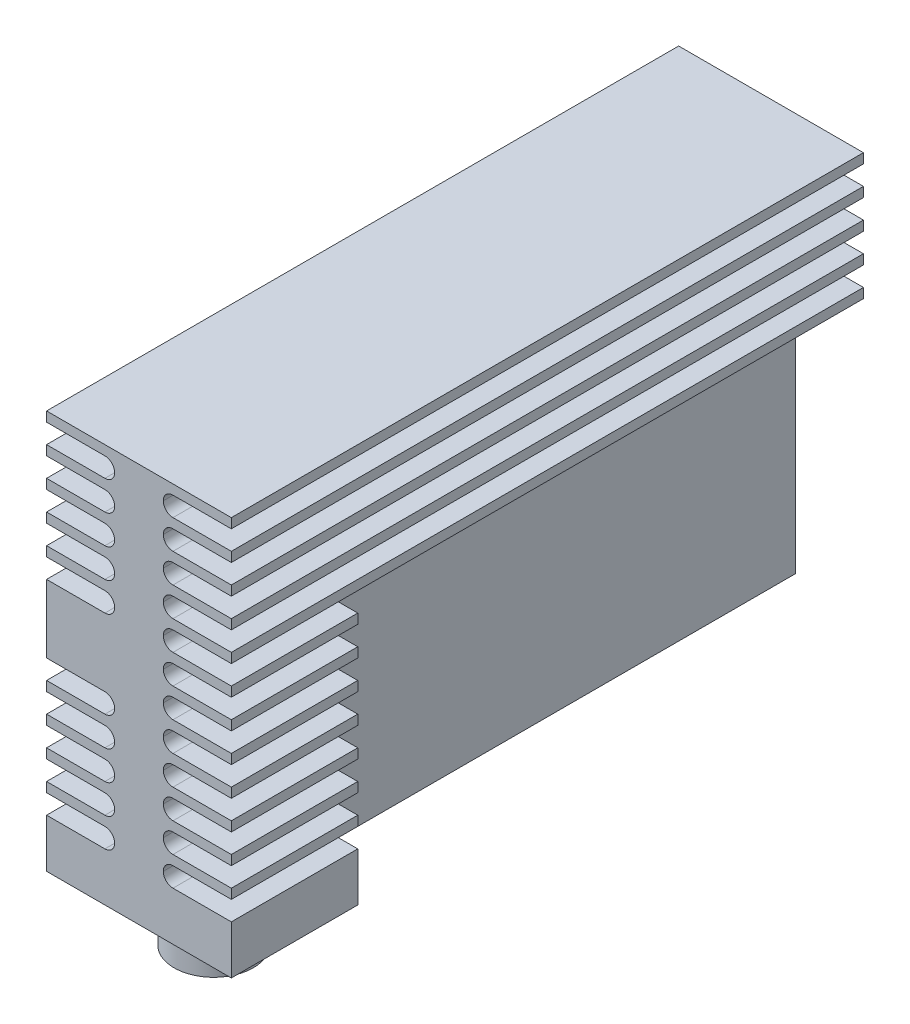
ISO-10303-21;
HEADER;
FILE_DESCRIPTION(('STEP AP214'),'2;1');
FILE_NAME('part.step','',(''),(''),'','','');
FILE_SCHEMA(('AUTOMOTIVE_DESIGN { 1 0 10303 214 1 1 1 1 }'));
ENDSEC;
DATA;
#1=APPLICATION_CONTEXT('core data for automotive mechanical design processes');
#2=APPLICATION_PROTOCOL_DEFINITION('international standard','automotive_design',2000,#1);
#3=PRODUCT_CONTEXT('',#1,'mechanical');
#4=PRODUCT('Part','Part','',(#3));
#5=PRODUCT_RELATED_PRODUCT_CATEGORY('part','',(#4));
#6=PRODUCT_DEFINITION_FORMATION('','',#4);
#7=PRODUCT_DEFINITION_CONTEXT('part definition',#1,'design');
#8=PRODUCT_DEFINITION('design','',#6,#7);
#9=PRODUCT_DEFINITION_SHAPE('','',#8);
#10=(LENGTH_UNIT() NAMED_UNIT(*) SI_UNIT(.MILLI.,.METRE.));
#11=(NAMED_UNIT(*) PLANE_ANGLE_UNIT() SI_UNIT($,.RADIAN.));
#12=(NAMED_UNIT(*) SI_UNIT($,.STERADIAN.) SOLID_ANGLE_UNIT());
#13=UNCERTAINTY_MEASURE_WITH_UNIT(LENGTH_MEASURE(1.E-05),#10,'distance_accuracy_value','');
#14=(GEOMETRIC_REPRESENTATION_CONTEXT(3) GLOBAL_UNCERTAINTY_ASSIGNED_CONTEXT((#13)) GLOBAL_UNIT_ASSIGNED_CONTEXT((#10,
#11,#12)) REPRESENTATION_CONTEXT('',''));
#15=CARTESIAN_POINT('',(0.,0.,0.));
#16=DIRECTION('',(0.,0.,1.));
#17=DIRECTION('',(1.,0.,0.));
#18=AXIS2_PLACEMENT_3D('',#15,#16,#17);
#19=CARTESIAN_POINT('',(38.,0.,65.));
#20=DIRECTION('',(-1.,0.,0.));
#21=DIRECTION('',(0.,0.,-1.));
#22=AXIS2_PLACEMENT_3D('',#19,#20,#21);
#23=PLANE('',#22);
#24=DIRECTION('',(0.,0.,-1.));
#25=VECTOR('',#24,1.);
#26=CARTESIAN_POINT('',(38.,4.,65.));
#27=LINE('',#26,#25);
#28=CARTESIAN_POINT('',(38.,4.,65.));
#29=VERTEX_POINT('',#28);
#30=CARTESIAN_POINT('',(38.,4.,52.));
#31=VERTEX_POINT('',#30);
#32=EDGE_CURVE('E1503',#29,#31,#27,.T.);
#33=ORIENTED_EDGE('',*,*,#32,.T.);
#34=DIRECTION('',(0.,1.,0.));
#35=VECTOR('',#34,1.);
#36=CARTESIAN_POINT('',(38.,0.,52.));
#37=LINE('',#36,#35);
#38=CARTESIAN_POINT('',(37.9999999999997,9.00000000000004,52.));
#39=VERTEX_POINT('',#38);
#40=EDGE_CURVE('E1573',#31,#39,#37,.T.);
#41=ORIENTED_EDGE('',*,*,#40,.T.);
#42=DIRECTION('',(0.,0.,1.));
#43=VECTOR('',#42,1.);
#44=CARTESIAN_POINT('',(37.9999999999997,9.00000000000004,-0.001000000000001));
#45=LINE('',#44,#43);
#46=CARTESIAN_POINT('',(37.9999999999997,9.00000000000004,65.));
#47=VERTEX_POINT('',#46);
#48=EDGE_CURVE('E1505',#39,#47,#45,.T.);
#49=ORIENTED_EDGE('',*,*,#48,.T.);
#50=DIRECTION('',(0.,-1.,0.));
#51=VECTOR('',#50,1.);
#52=CARTESIAN_POINT('',(38.,0.,65.));
#53=LINE('',#52,#51);
#54=EDGE_CURVE('E1098',#47,#29,#53,.T.);
#55=ORIENTED_EDGE('',*,*,#54,.T.);
#56=EDGE_LOOP('',(#33,#41,#49,#55));
#57=FACE_BOUND('',#56,.T.);
#58=ADVANCED_FACE('F38',(#57),#23,.F.);
#59=CARTESIAN_POINT('',(19.,0.,65.));
#60=DIRECTION('',(1.,0.,0.));
#61=DIRECTION('',(0.,0.,1.));
#62=AXIS2_PLACEMENT_3D('',#59,#60,#61);
#63=PLANE('',#62);
#64=DIRECTION('',(0.,1.,0.));
#65=VECTOR('',#64,1.);
#66=CARTESIAN_POINT('',(19.,0.,65.));
#67=LINE('',#66,#65);
#68=CARTESIAN_POINT('',(19.,4.,65.));
#69=VERTEX_POINT('',#68);
#70=CARTESIAN_POINT('',(19.0000000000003,9.00000000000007,65.));
#71=VERTEX_POINT('',#70);
#72=EDGE_CURVE('E1099',#69,#71,#67,.T.);
#73=ORIENTED_EDGE('',*,*,#72,.T.);
#74=DIRECTION('',(0.,0.,1.));
#75=VECTOR('',#74,1.);
#76=CARTESIAN_POINT('',(19.0000000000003,9.00000000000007,-0.001000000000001));
#77=LINE('',#76,#75);
#78=CARTESIAN_POINT('',(19.0000000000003,9.00000000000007,11.));
#79=VERTEX_POINT('',#78);
#80=EDGE_CURVE('E1707',#79,#71,#77,.T.);
#81=ORIENTED_EDGE('',*,*,#80,.F.);
#82=CARTESIAN_POINT('',(19.,10.0000000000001,11.));
#83=DIRECTION('',(-1.,0.,0.));
#84=DIRECTION('',(0.,0.,1.));
#85=AXIS2_PLACEMENT_3D('',#82,#83,#84);
#86=CIRCLE('',#85,1.);
#87=CARTESIAN_POINT('',(19.,10.0000000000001,10.));
#88=VERTEX_POINT('',#87);
#89=EDGE_CURVE('E1248',#88,#79,#86,.T.);
#90=ORIENTED_EDGE('',*,*,#89,.F.);
#91=CARTESIAN_POINT('',(19.,10.0000000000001,11.));
#92=DIRECTION('',(-1.,0.,0.));
#93=DIRECTION('',(0.,0.,1.));
#94=AXIS2_PLACEMENT_3D('',#91,#92,#93);
#95=CIRCLE('',#94,1.);
#96=CARTESIAN_POINT('',(19.0000000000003,11.0000000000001,11.));
#97=VERTEX_POINT('',#96);
#98=EDGE_CURVE('E1251',#97,#88,#95,.T.);
#99=ORIENTED_EDGE('',*,*,#98,.F.);
#100=DIRECTION('',(0.,0.,1.));
#101=VECTOR('',#100,1.);
#102=CARTESIAN_POINT('',(19.0000000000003,11.0000000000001,-0.001000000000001));
#103=LINE('',#102,#101);
#104=CARTESIAN_POINT('',(19.0000000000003,11.0000000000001,65.));
#105=VERTEX_POINT('',#104);
#106=EDGE_CURVE('E1708',#97,#105,#103,.T.);
#107=ORIENTED_EDGE('',*,*,#106,.T.);
#108=CARTESIAN_POINT('',(19.0000000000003,12.0000000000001,65.));
#109=VERTEX_POINT('',#108);
#110=EDGE_CURVE('E1103',#105,#109,#67,.T.);
#111=ORIENTED_EDGE('',*,*,#110,.T.);
#112=DIRECTION('',(0.,0.,1.));
#113=VECTOR('',#112,1.);
#114=CARTESIAN_POINT('',(19.0000000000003,12.0000000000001,-0.001000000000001));
#115=LINE('',#114,#113);
#116=CARTESIAN_POINT('',(19.,12.0000000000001,0.));
#117=VERTEX_POINT('',#116);
#118=EDGE_CURVE('E1725',#117,#109,#115,.T.);
#119=ORIENTED_EDGE('',*,*,#118,.F.);
#120=DIRECTION('',(0.,1.,0.));
#121=VECTOR('',#120,1.);
#122=CARTESIAN_POINT('',(19.,0.,0.));
#123=LINE('',#122,#121);
#124=CARTESIAN_POINT('',(19.,4.,0.));
#125=VERTEX_POINT('',#124);
#126=EDGE_CURVE('E1112',#125,#117,#123,.T.);
#127=ORIENTED_EDGE('',*,*,#126,.F.);
#128=DIRECTION('',(0.,0.,1.));
#129=VECTOR('',#128,1.);
#130=CARTESIAN_POINT('',(19.,4.,52.));
#131=LINE('',#130,#129);
#132=EDGE_CURVE('E1570',#125,#69,#131,.T.);
#133=ORIENTED_EDGE('',*,*,#132,.T.);
#134=EDGE_LOOP('',(#73,#81,#90,#99,#107,#111,#119,#127,#133));
#135=FACE_BOUND('',#134,.T.);
#136=ADVANCED_FACE('F1836',(#135),#63,.F.);
#137=CARTESIAN_POINT('',(38.,0.,65.));
#138=DIRECTION('',(0.,0.,-1.));
#139=DIRECTION('',(1.,0.,0.));
#140=AXIS2_PLACEMENT_3D('',#137,#138,#139);
#141=PLANE('',#140);
#142=DIRECTION('',(1.,0.,0.));
#143=VECTOR('',#142,1.);
#144=CARTESIAN_POINT('',(19.,4.,65.));
#145=LINE('',#144,#143);
#146=EDGE_CURVE('E92',#69,#29,#145,.T.);
#147=ORIENTED_EDGE('',*,*,#146,.T.);
#148=ORIENTED_EDGE('',*,*,#54,.F.);
#149=DIRECTION('',(-1.,0.,0.));
#150=VECTOR('',#149,1.);
#151=CARTESIAN_POINT('',(37.9999999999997,9.00000000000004,65.));
#152=LINE('',#151,#150);
#153=CARTESIAN_POINT('',(31.9999999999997,9.00000000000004,65.));
#154=VERTEX_POINT('',#153);
#155=EDGE_CURVE('E1746',#47,#154,#152,.T.);
#156=ORIENTED_EDGE('',*,*,#155,.T.);
#157=CARTESIAN_POINT('',(31.9999999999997,10.,65.));
#158=DIRECTION('',(0.,0.,1.));
#159=DIRECTION('',(1.,0.,0.));
#160=AXIS2_PLACEMENT_3D('',#157,#158,#159);
#161=CIRCLE('',#160,1.);
#162=CARTESIAN_POINT('',(30.9999999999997,10.,65.));
#163=VERTEX_POINT('',#162);
#164=EDGE_CURVE('E1391',#163,#154,#161,.T.);
#165=ORIENTED_EDGE('',*,*,#164,.F.);
#166=CARTESIAN_POINT('',(31.9999999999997,10.,65.));
#167=DIRECTION('',(0.,0.,1.));
#168=DIRECTION('',(1.,0.,0.));
#169=AXIS2_PLACEMENT_3D('',#166,#167,#168);
#170=CIRCLE('',#169,1.);
#171=CARTESIAN_POINT('',(31.9999999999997,11.,65.));
#172=VERTEX_POINT('',#171);
#173=EDGE_CURVE('E1361',#172,#163,#170,.T.);
#174=ORIENTED_EDGE('',*,*,#173,.F.);
#175=DIRECTION('',(1.,0.,0.));
#176=VECTOR('',#175,1.);
#177=CARTESIAN_POINT('',(37.9999999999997,11.,65.));
#178=LINE('',#177,#176);
#179=CARTESIAN_POINT('',(37.9999999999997,11.,65.));
#180=VERTEX_POINT('',#179);
#181=EDGE_CURVE('E1749',#172,#180,#178,.T.);
#182=ORIENTED_EDGE('',*,*,#181,.T.);
#183=CARTESIAN_POINT('',(37.9999999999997,12.,65.));
#184=VERTEX_POINT('',#183);
#185=EDGE_CURVE('E1489',#184,#180,#53,.T.);
#186=ORIENTED_EDGE('',*,*,#185,.F.);
#187=DIRECTION('',(-1.,0.,0.));
#188=VECTOR('',#187,1.);
#189=CARTESIAN_POINT('',(37.9999999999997,12.,65.));
#190=LINE('',#189,#188);
#191=CARTESIAN_POINT('',(31.9999999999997,12.,65.));
#192=VERTEX_POINT('',#191);
#193=EDGE_CURVE('E1067',#184,#192,#190,.T.);
#194=ORIENTED_EDGE('',*,*,#193,.T.);
#195=CARTESIAN_POINT('',(31.9999999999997,13.,65.));
#196=DIRECTION('',(0.,0.,1.));
#197=DIRECTION('',(1.,0.,0.));
#198=AXIS2_PLACEMENT_3D('',#195,#196,#197);
#199=CIRCLE('',#198,1.);
#200=CARTESIAN_POINT('',(30.9999999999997,13.,65.));
#201=VERTEX_POINT('',#200);
#202=EDGE_CURVE('E1397',#201,#192,#199,.T.);
#203=ORIENTED_EDGE('',*,*,#202,.F.);
#204=CARTESIAN_POINT('',(31.9999999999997,13.,65.));
#205=DIRECTION('',(0.,0.,1.));
#206=DIRECTION('',(1.,0.,0.));
#207=AXIS2_PLACEMENT_3D('',#204,#205,#206);
#208=CIRCLE('',#207,1.);
#209=CARTESIAN_POINT('',(31.9999999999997,14.,65.));
#210=VERTEX_POINT('',#209);
#211=EDGE_CURVE('E1366',#210,#201,#208,.T.);
#212=ORIENTED_EDGE('',*,*,#211,.F.);
#213=DIRECTION('',(1.,0.,0.));
#214=VECTOR('',#213,1.);
#215=CARTESIAN_POINT('',(37.9999999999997,14.,65.));
#216=LINE('',#215,#214);
#217=CARTESIAN_POINT('',(37.9999999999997,14.,65.));
#218=VERTEX_POINT('',#217);
#219=EDGE_CURVE('E1070',#210,#218,#216,.T.);
#220=ORIENTED_EDGE('',*,*,#219,.T.);
#221=CARTESIAN_POINT('',(37.9999999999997,15.,65.));
#222=VERTEX_POINT('',#221);
#223=EDGE_CURVE('E1484',#222,#218,#53,.T.);
#224=ORIENTED_EDGE('',*,*,#223,.F.);
#225=DIRECTION('',(-1.,0.,0.));
#226=VECTOR('',#225,1.);
#227=CARTESIAN_POINT('',(37.9999999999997,15.,65.));
#228=LINE('',#227,#226);
#229=CARTESIAN_POINT('',(31.9999999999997,15.,65.));
#230=VERTEX_POINT('',#229);
#231=EDGE_CURVE('E1057',#222,#230,#228,.T.);
#232=ORIENTED_EDGE('',*,*,#231,.T.);
#233=CARTESIAN_POINT('',(31.9999999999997,16.,65.));
#234=DIRECTION('',(0.,0.,1.));
#235=DIRECTION('',(1.,0.,0.));
#236=AXIS2_PLACEMENT_3D('',#233,#234,#235);
#237=CIRCLE('',#236,1.);
#238=CARTESIAN_POINT('',(30.9999999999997,16.,65.));
#239=VERTEX_POINT('',#238);
#240=EDGE_CURVE('E1403',#239,#230,#237,.T.);
#241=ORIENTED_EDGE('',*,*,#240,.F.);
#242=CARTESIAN_POINT('',(31.9999999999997,16.,65.));
#243=DIRECTION('',(0.,0.,1.));
#244=DIRECTION('',(1.,0.,0.));
#245=AXIS2_PLACEMENT_3D('',#242,#243,#244);
#246=CIRCLE('',#245,1.);
#247=CARTESIAN_POINT('',(31.9999999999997,17.,65.));
#248=VERTEX_POINT('',#247);
#249=EDGE_CURVE('E1371',#248,#239,#246,.T.);
#250=ORIENTED_EDGE('',*,*,#249,.F.);
#251=DIRECTION('',(1.,0.,0.));
#252=VECTOR('',#251,1.);
#253=CARTESIAN_POINT('',(37.9999999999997,17.,65.));
#254=LINE('',#253,#252);
#255=CARTESIAN_POINT('',(37.9999999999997,17.,65.));
#256=VERTEX_POINT('',#255);
#257=EDGE_CURVE('E1060',#248,#256,#254,.T.);
#258=ORIENTED_EDGE('',*,*,#257,.T.);
#259=CARTESIAN_POINT('',(37.9999999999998,18.,65.));
#260=VERTEX_POINT('',#259);
#261=EDGE_CURVE('E1479',#260,#256,#53,.T.);
#262=ORIENTED_EDGE('',*,*,#261,.F.);
#263=DIRECTION('',(-1.,0.,0.));
#264=VECTOR('',#263,1.);
#265=CARTESIAN_POINT('',(37.9999999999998,18.,65.));
#266=LINE('',#265,#264);
#267=CARTESIAN_POINT('',(31.9999999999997,18.,65.));
#268=VERTEX_POINT('',#267);
#269=EDGE_CURVE('E1047',#260,#268,#266,.T.);
#270=ORIENTED_EDGE('',*,*,#269,.T.);
#271=CARTESIAN_POINT('',(31.9999999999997,19.,65.));
#272=DIRECTION('',(0.,0.,1.));
#273=DIRECTION('',(1.,0.,0.));
#274=AXIS2_PLACEMENT_3D('',#271,#272,#273);
#275=CIRCLE('',#274,1.);
#276=CARTESIAN_POINT('',(30.9999999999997,19.,65.));
#277=VERTEX_POINT('',#276);
#278=EDGE_CURVE('E1409',#277,#268,#275,.T.);
#279=ORIENTED_EDGE('',*,*,#278,.F.);
#280=CARTESIAN_POINT('',(31.9999999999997,19.,65.));
#281=DIRECTION('',(0.,0.,1.));
#282=DIRECTION('',(1.,0.,0.));
#283=AXIS2_PLACEMENT_3D('',#280,#281,#282);
#284=CIRCLE('',#283,1.);
#285=CARTESIAN_POINT('',(31.9999999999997,20.,65.));
#286=VERTEX_POINT('',#285);
#287=EDGE_CURVE('E1376',#286,#277,#284,.T.);
#288=ORIENTED_EDGE('',*,*,#287,.F.);
#289=DIRECTION('',(1.,0.,0.));
#290=VECTOR('',#289,1.);
#291=CARTESIAN_POINT('',(37.9999999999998,20.,65.));
#292=LINE('',#291,#290);
#293=CARTESIAN_POINT('',(37.9999999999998,20.,65.));
#294=VERTEX_POINT('',#293);
#295=EDGE_CURVE('E1050',#286,#294,#292,.T.);
#296=ORIENTED_EDGE('',*,*,#295,.T.);
#297=CARTESIAN_POINT('',(37.9999999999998,21.,65.));
#298=VERTEX_POINT('',#297);
#299=EDGE_CURVE('E1474',#298,#294,#53,.T.);
#300=ORIENTED_EDGE('',*,*,#299,.F.);
#301=DIRECTION('',(-1.,0.,0.));
#302=VECTOR('',#301,1.);
#303=CARTESIAN_POINT('',(37.9999999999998,21.,65.));
#304=LINE('',#303,#302);
#305=CARTESIAN_POINT('',(31.9999999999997,21.,65.));
#306=VERTEX_POINT('',#305);
#307=EDGE_CURVE('E1037',#298,#306,#304,.T.);
#308=ORIENTED_EDGE('',*,*,#307,.T.);
#309=CARTESIAN_POINT('',(31.9999999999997,22.,65.));
#310=DIRECTION('',(0.,0.,1.));
#311=DIRECTION('',(1.,0.,0.));
#312=AXIS2_PLACEMENT_3D('',#309,#310,#311);
#313=CIRCLE('',#312,1.);
#314=CARTESIAN_POINT('',(30.9999999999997,22.,65.));
#315=VERTEX_POINT('',#314);
#316=EDGE_CURVE('E1415',#315,#306,#313,.T.);
#317=ORIENTED_EDGE('',*,*,#316,.F.);
#318=CARTESIAN_POINT('',(31.9999999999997,22.,65.));
#319=DIRECTION('',(0.,0.,1.));
#320=DIRECTION('',(1.,0.,0.));
#321=AXIS2_PLACEMENT_3D('',#318,#319,#320);
#322=CIRCLE('',#321,1.);
#323=CARTESIAN_POINT('',(31.9999999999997,23.,65.));
#324=VERTEX_POINT('',#323);
#325=EDGE_CURVE('E1381',#324,#315,#322,.T.);
#326=ORIENTED_EDGE('',*,*,#325,.F.);
#327=DIRECTION('',(1.,0.,0.));
#328=VECTOR('',#327,1.);
#329=CARTESIAN_POINT('',(37.9999999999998,23.,65.));
#330=LINE('',#329,#328);
#331=CARTESIAN_POINT('',(37.9999999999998,23.,65.));
#332=VERTEX_POINT('',#331);
#333=EDGE_CURVE('E1040',#324,#332,#330,.T.);
#334=ORIENTED_EDGE('',*,*,#333,.T.);
#335=CARTESIAN_POINT('',(37.9999999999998,24.,65.));
#336=VERTEX_POINT('',#335);
#337=EDGE_CURVE('E1469',#336,#332,#53,.T.);
#338=ORIENTED_EDGE('',*,*,#337,.F.);
#339=DIRECTION('',(-1.,0.,0.));
#340=VECTOR('',#339,1.);
#341=CARTESIAN_POINT('',(37.9999999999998,24.,65.));
#342=LINE('',#341,#340);
#343=CARTESIAN_POINT('',(31.9999999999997,24.,65.));
#344=VERTEX_POINT('',#343);
#345=EDGE_CURVE('E1027',#336,#344,#342,.T.);
#346=ORIENTED_EDGE('',*,*,#345,.T.);
#347=CARTESIAN_POINT('',(31.9999999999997,25.,65.));
#348=DIRECTION('',(0.,0.,1.));
#349=DIRECTION('',(1.,0.,0.));
#350=AXIS2_PLACEMENT_3D('',#347,#348,#349);
#351=CIRCLE('',#350,1.);
#352=CARTESIAN_POINT('',(30.9999999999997,25.,65.));
#353=VERTEX_POINT('',#352);
#354=EDGE_CURVE('E1421',#353,#344,#351,.T.);
#355=ORIENTED_EDGE('',*,*,#354,.F.);
#356=CARTESIAN_POINT('',(31.9999999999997,25.,65.));
#357=DIRECTION('',(0.,0.,1.));
#358=DIRECTION('',(1.,0.,0.));
#359=AXIS2_PLACEMENT_3D('',#356,#357,#358);
#360=CIRCLE('',#359,1.);
#361=CARTESIAN_POINT('',(31.9999999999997,26.,65.));
#362=VERTEX_POINT('',#361);
#363=EDGE_CURVE('E1254',#362,#353,#360,.T.);
#364=ORIENTED_EDGE('',*,*,#363,.F.);
#365=DIRECTION('',(1.,0.,0.));
#366=VECTOR('',#365,1.);
#367=CARTESIAN_POINT('',(37.9999999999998,26.,65.));
#368=LINE('',#367,#366);
#369=CARTESIAN_POINT('',(37.9999999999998,26.,65.));
#370=VERTEX_POINT('',#369);
#371=EDGE_CURVE('E1030',#362,#370,#368,.T.);
#372=ORIENTED_EDGE('',*,*,#371,.T.);
#373=CARTESIAN_POINT('',(37.9999999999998,27.,65.));
#374=VERTEX_POINT('',#373);
#375=EDGE_CURVE('E1464',#374,#370,#53,.T.);
#376=ORIENTED_EDGE('',*,*,#375,.F.);
#377=DIRECTION('',(-1.,0.,0.));
#378=VECTOR('',#377,1.);
#379=CARTESIAN_POINT('',(37.9999999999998,27.,65.));
#380=LINE('',#379,#378);
#381=CARTESIAN_POINT('',(31.9999999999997,27.,65.));
#382=VERTEX_POINT('',#381);
#383=EDGE_CURVE('E988',#374,#382,#380,.T.);
#384=ORIENTED_EDGE('',*,*,#383,.T.);
#385=CARTESIAN_POINT('',(31.9999999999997,28.,65.));
#386=DIRECTION('',(0.,0.,1.));
#387=DIRECTION('',(1.,0.,0.));
#388=AXIS2_PLACEMENT_3D('',#385,#386,#387);
#389=CIRCLE('',#388,1.);
#390=CARTESIAN_POINT('',(30.9999999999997,28.,65.));
#391=VERTEX_POINT('',#390);
#392=EDGE_CURVE('E1427',#391,#382,#389,.T.);
#393=ORIENTED_EDGE('',*,*,#392,.F.);
#394=CARTESIAN_POINT('',(31.9999999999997,28.,65.));
#395=DIRECTION('',(0.,0.,1.));
#396=DIRECTION('',(1.,0.,0.));
#397=AXIS2_PLACEMENT_3D('',#394,#395,#396);
#398=CIRCLE('',#397,1.);
#399=CARTESIAN_POINT('',(31.9999999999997,29.,65.));
#400=VERTEX_POINT('',#399);
#401=EDGE_CURVE('E1386',#400,#391,#398,.T.);
#402=ORIENTED_EDGE('',*,*,#401,.F.);
#403=DIRECTION('',(1.,0.,0.));
#404=VECTOR('',#403,1.);
#405=CARTESIAN_POINT('',(37.9999999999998,29.,65.));
#406=LINE('',#405,#404);
#407=CARTESIAN_POINT('',(37.9999999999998,29.,65.));
#408=VERTEX_POINT('',#407);
#409=EDGE_CURVE('E991',#400,#408,#406,.T.);
#410=ORIENTED_EDGE('',*,*,#409,.T.);
#411=CARTESIAN_POINT('',(37.9999999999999,30.,65.));
#412=VERTEX_POINT('',#411);
#413=EDGE_CURVE('E1460',#412,#408,#53,.T.);
#414=ORIENTED_EDGE('',*,*,#413,.F.);
#415=DIRECTION('',(-1.,0.,0.));
#416=VECTOR('',#415,1.);
#417=CARTESIAN_POINT('',(37.9999999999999,30.,65.));
#418=LINE('',#417,#416);
#419=CARTESIAN_POINT('',(31.9999999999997,30.,65.));
#420=VERTEX_POINT('',#419);
#421=EDGE_CURVE('E1001',#412,#420,#418,.T.);
#422=ORIENTED_EDGE('',*,*,#421,.T.);
#423=CARTESIAN_POINT('',(31.9999999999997,31.,65.));
#424=DIRECTION('',(0.,0.,1.));
#425=DIRECTION('',(1.,0.,0.));
#426=AXIS2_PLACEMENT_3D('',#423,#424,#425);
#427=CIRCLE('',#426,1.);
#428=CARTESIAN_POINT('',(30.9999999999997,31.,65.));
#429=VERTEX_POINT('',#428);
#430=EDGE_CURVE('E1433',#429,#420,#427,.T.);
#431=ORIENTED_EDGE('',*,*,#430,.F.);
#432=CARTESIAN_POINT('',(31.9999999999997,31.,65.));
#433=DIRECTION('',(0.,0.,1.));
#434=DIRECTION('',(1.,0.,0.));
#435=AXIS2_PLACEMENT_3D('',#432,#433,#434);
#436=CIRCLE('',#435,1.);
#437=CARTESIAN_POINT('',(31.9999999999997,32.,65.));
#438=VERTEX_POINT('',#437);
#439=EDGE_CURVE('E823',#438,#429,#436,.T.);
#440=ORIENTED_EDGE('',*,*,#439,.F.);
#441=DIRECTION('',(1.,0.,0.));
#442=VECTOR('',#441,1.);
#443=CARTESIAN_POINT('',(37.9999999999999,32.,65.));
#444=LINE('',#443,#442);
#445=CARTESIAN_POINT('',(37.9999999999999,32.,65.));
#446=VERTEX_POINT('',#445);
#447=EDGE_CURVE('E1005',#438,#446,#444,.T.);
#448=ORIENTED_EDGE('',*,*,#447,.T.);
#449=CARTESIAN_POINT('',(37.9999999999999,33.,65.));
#450=VERTEX_POINT('',#449);
#451=EDGE_CURVE('E1457',#450,#446,#53,.T.);
#452=ORIENTED_EDGE('',*,*,#451,.F.);
#453=DIRECTION('',(-1.,0.,0.));
#454=VECTOR('',#453,1.);
#455=CARTESIAN_POINT('',(37.9999999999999,33.,65.));
#456=LINE('',#455,#454);
#457=CARTESIAN_POINT('',(31.9999999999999,33.,65.));
#458=VERTEX_POINT('',#457);
#459=EDGE_CURVE('E977',#450,#458,#456,.T.);
#460=ORIENTED_EDGE('',*,*,#459,.T.);
#461=CARTESIAN_POINT('',(31.9999999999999,34.,65.));
#462=DIRECTION('',(0.,0.,1.));
#463=DIRECTION('',(1.,0.,0.));
#464=AXIS2_PLACEMENT_3D('',#461,#462,#463);
#465=CIRCLE('',#464,1.);
#466=CARTESIAN_POINT('',(30.9999999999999,34.,65.));
#467=VERTEX_POINT('',#466);
#468=EDGE_CURVE('E816',#467,#458,#465,.T.);
#469=ORIENTED_EDGE('',*,*,#468,.F.);
#470=CARTESIAN_POINT('',(31.9999999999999,34.,65.));
#471=DIRECTION('',(0.,0.,1.));
#472=DIRECTION('',(1.,0.,0.));
#473=AXIS2_PLACEMENT_3D('',#470,#471,#472);
#474=CIRCLE('',#473,1.);
#475=CARTESIAN_POINT('',(31.9999999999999,35.,65.));
#476=VERTEX_POINT('',#475);
#477=EDGE_CURVE('E803',#476,#467,#474,.T.);
#478=ORIENTED_EDGE('',*,*,#477,.F.);
#479=DIRECTION('',(1.,0.,0.));
#480=VECTOR('',#479,1.);
#481=CARTESIAN_POINT('',(37.9999999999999,35.,65.));
#482=LINE('',#481,#480);
#483=CARTESIAN_POINT('',(37.9999999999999,35.,65.));
#484=VERTEX_POINT('',#483);
#485=EDGE_CURVE('E981',#476,#484,#482,.T.);
#486=ORIENTED_EDGE('',*,*,#485,.T.);
#487=CARTESIAN_POINT('',(37.9999999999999,36.,65.));
#488=VERTEX_POINT('',#487);
#489=EDGE_CURVE('E957',#488,#484,#53,.T.);
#490=ORIENTED_EDGE('',*,*,#489,.F.);
#491=DIRECTION('',(-1.,0.,0.));
#492=VECTOR('',#491,1.);
#493=CARTESIAN_POINT('',(37.9999999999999,36.,65.));
#494=LINE('',#493,#492);
#495=CARTESIAN_POINT('',(31.9999999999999,36.,65.));
#496=VERTEX_POINT('',#495);
#497=EDGE_CURVE('E954',#488,#496,#494,.T.);
#498=ORIENTED_EDGE('',*,*,#497,.T.);
#499=CARTESIAN_POINT('',(31.9999999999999,37.,65.));
#500=DIRECTION('',(0.,0.,1.));
#501=DIRECTION('',(1.,0.,0.));
#502=AXIS2_PLACEMENT_3D('',#499,#500,#501);
#503=CIRCLE('',#502,1.);
#504=CARTESIAN_POINT('',(30.9999999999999,37.,65.));
#505=VERTEX_POINT('',#504);
#506=EDGE_CURVE('E815',#505,#496,#503,.T.);
#507=ORIENTED_EDGE('',*,*,#506,.F.);
#508=CARTESIAN_POINT('',(31.9999999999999,37.,65.));
#509=DIRECTION('',(0.,0.,1.));
#510=DIRECTION('',(1.,0.,0.));
#511=AXIS2_PLACEMENT_3D('',#508,#509,#510);
#512=CIRCLE('',#511,1.);
#513=CARTESIAN_POINT('',(31.9999999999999,38.,65.));
#514=VERTEX_POINT('',#513);
#515=EDGE_CURVE('E944',#514,#505,#512,.T.);
#516=ORIENTED_EDGE('',*,*,#515,.F.);
#517=DIRECTION('',(1.,0.,0.));
#518=VECTOR('',#517,1.);
#519=CARTESIAN_POINT('',(37.9999999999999,38.,65.));
#520=LINE('',#519,#518);
#521=CARTESIAN_POINT('',(37.9999999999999,38.,65.));
#522=VERTEX_POINT('',#521);
#523=EDGE_CURVE('E959',#514,#522,#520,.T.);
#524=ORIENTED_EDGE('',*,*,#523,.T.);
#525=CARTESIAN_POINT('',(38.,39.,65.));
#526=VERTEX_POINT('',#525);
#527=EDGE_CURVE('E1452',#526,#522,#53,.T.);
#528=ORIENTED_EDGE('',*,*,#527,.F.);
#529=DIRECTION('',(-1.,0.,0.));
#530=VECTOR('',#529,1.);
#531=CARTESIAN_POINT('',(38.,39.,65.));
#532=LINE('',#531,#530);
#533=CARTESIAN_POINT('',(32.,39.,65.));
#534=VERTEX_POINT('',#533);
#535=EDGE_CURVE('E1015',#526,#534,#532,.T.);
#536=ORIENTED_EDGE('',*,*,#535,.T.);
#537=CARTESIAN_POINT('',(32.,40.,65.));
#538=DIRECTION('',(0.,0.,1.));
#539=DIRECTION('',(1.,0.,0.));
#540=AXIS2_PLACEMENT_3D('',#537,#538,#539);
#541=CIRCLE('',#540,1.);
#542=CARTESIAN_POINT('',(31.,40.,65.));
#543=VERTEX_POINT('',#542);
#544=EDGE_CURVE('E840',#543,#534,#541,.T.);
#545=ORIENTED_EDGE('',*,*,#544,.F.);
#546=CARTESIAN_POINT('',(32.,40.,65.));
#547=DIRECTION('',(0.,0.,1.));
#548=DIRECTION('',(1.,0.,0.));
#549=AXIS2_PLACEMENT_3D('',#546,#547,#548);
#550=CIRCLE('',#549,1.);
#551=CARTESIAN_POINT('',(32.,41.,65.));
#552=VERTEX_POINT('',#551);
#553=EDGE_CURVE('E1439',#552,#543,#550,.T.);
#554=ORIENTED_EDGE('',*,*,#553,.F.);
#555=DIRECTION('',(1.,0.,0.));
#556=VECTOR('',#555,1.);
#557=CARTESIAN_POINT('',(38.,41.,65.));
#558=LINE('',#557,#556);
#559=CARTESIAN_POINT('',(38.,41.,65.));
#560=VERTEX_POINT('',#559);
#561=EDGE_CURVE('E1018',#552,#560,#558,.T.);
#562=ORIENTED_EDGE('',*,*,#561,.T.);
#563=CARTESIAN_POINT('',(38.,42.,65.));
#564=VERTEX_POINT('',#563);
#565=EDGE_CURVE('E1097',#564,#560,#53,.T.);
#566=ORIENTED_EDGE('',*,*,#565,.F.);
#567=DIRECTION('',(-1.,0.,0.));
#568=VECTOR('',#567,1.);
#569=CARTESIAN_POINT('',(38.,42.,65.));
#570=LINE('',#569,#568);
#571=CARTESIAN_POINT('',(32.,42.,65.));
#572=VERTEX_POINT('',#571);
#573=EDGE_CURVE('E1079',#564,#572,#570,.T.);
#574=ORIENTED_EDGE('',*,*,#573,.T.);
#575=CARTESIAN_POINT('',(32.,43.,65.));
#576=DIRECTION('',(0.,0.,1.));
#577=DIRECTION('',(1.,0.,0.));
#578=AXIS2_PLACEMENT_3D('',#575,#576,#577);
#579=CIRCLE('',#578,1.);
#580=CARTESIAN_POINT('',(31.,43.,65.));
#581=VERTEX_POINT('',#580);
#582=EDGE_CURVE('E846',#581,#572,#579,.T.);
#583=ORIENTED_EDGE('',*,*,#582,.F.);
#584=CARTESIAN_POINT('',(32.,43.,65.));
#585=DIRECTION('',(0.,0.,1.));
#586=DIRECTION('',(1.,0.,0.));
#587=AXIS2_PLACEMENT_3D('',#584,#585,#586);
#588=CIRCLE('',#587,1.);
#589=CARTESIAN_POINT('',(32.,44.,65.));
#590=VERTEX_POINT('',#589);
#591=EDGE_CURVE('E48',#590,#581,#588,.T.);
#592=ORIENTED_EDGE('',*,*,#591,.F.);
#593=DIRECTION('',(1.,0.,0.));
#594=VECTOR('',#593,1.);
#595=CARTESIAN_POINT('',(38.,44.,65.));
#596=LINE('',#595,#594);
#597=CARTESIAN_POINT('',(38.,44.,65.));
#598=VERTEX_POINT('',#597);
#599=EDGE_CURVE('E1082',#590,#598,#596,.T.);
#600=ORIENTED_EDGE('',*,*,#599,.T.);
#601=CARTESIAN_POINT('',(38.,45.,65.));
#602=VERTEX_POINT('',#601);
#603=EDGE_CURVE('E1093',#602,#598,#53,.T.);
#604=ORIENTED_EDGE('',*,*,#603,.F.);
#605=DIRECTION('',(1.,0.,0.));
#606=VECTOR('',#605,1.);
#607=CARTESIAN_POINT('',(38.,45.,65.));
#608=LINE('',#607,#606);
#609=CARTESIAN_POINT('',(19.,45.,65.));
#610=VERTEX_POINT('',#609);
#611=EDGE_CURVE('E1102',#610,#602,#608,.T.);
#612=ORIENTED_EDGE('',*,*,#611,.F.);
#613=CARTESIAN_POINT('',(19.,44.,65.));
#614=VERTEX_POINT('',#613);
#615=EDGE_CURVE('E1096',#614,#610,#67,.T.);
#616=ORIENTED_EDGE('',*,*,#615,.F.);
#617=DIRECTION('',(1.,0.,0.));
#618=VECTOR('',#617,1.);
#619=CARTESIAN_POINT('',(19.,44.,65.));
#620=LINE('',#619,#618);
#621=CARTESIAN_POINT('',(25.,44.,65.));
#622=VERTEX_POINT('',#621);
#623=EDGE_CURVE('E1616',#614,#622,#620,.T.);
#624=ORIENTED_EDGE('',*,*,#623,.T.);
#625=CARTESIAN_POINT('',(25.,43.,65.));
#626=DIRECTION('',(0.,0.,1.));
#627=DIRECTION('',(1.,0.,0.));
#628=AXIS2_PLACEMENT_3D('',#625,#626,#627);
#629=CIRCLE('',#628,1.);
#630=CARTESIAN_POINT('',(26.,43.,65.));
#631=VERTEX_POINT('',#630);
#632=EDGE_CURVE('E1307',#631,#622,#629,.T.);
#633=ORIENTED_EDGE('',*,*,#632,.F.);
#634=CARTESIAN_POINT('',(25.,43.,65.));
#635=DIRECTION('',(0.,0.,1.));
#636=DIRECTION('',(1.,0.,0.));
#637=AXIS2_PLACEMENT_3D('',#634,#635,#636);
#638=CIRCLE('',#637,1.);
#639=CARTESIAN_POINT('',(25.,42.,65.));
#640=VERTEX_POINT('',#639);
#641=EDGE_CURVE('E1310',#640,#631,#638,.T.);
#642=ORIENTED_EDGE('',*,*,#641,.F.);
#643=DIRECTION('',(-1.,0.,0.));
#644=VECTOR('',#643,1.);
#645=CARTESIAN_POINT('',(19.,42.,65.));
#646=LINE('',#645,#644);
#647=CARTESIAN_POINT('',(19.,42.,65.));
#648=VERTEX_POINT('',#647);
#649=EDGE_CURVE('E1695',#640,#648,#646,.T.);
#650=ORIENTED_EDGE('',*,*,#649,.T.);
#651=CARTESIAN_POINT('',(19.,41.,65.));
#652=VERTEX_POINT('',#651);
#653=EDGE_CURVE('E3481',#652,#648,#67,.T.);
#654=ORIENTED_EDGE('',*,*,#653,.F.);
#655=DIRECTION('',(1.,0.,0.));
#656=VECTOR('',#655,1.);
#657=CARTESIAN_POINT('',(19.,41.,65.));
#658=LINE('',#657,#656);
#659=CARTESIAN_POINT('',(25.,41.,65.));
#660=VERTEX_POINT('',#659);
#661=EDGE_CURVE('E1683',#652,#660,#658,.T.);
#662=ORIENTED_EDGE('',*,*,#661,.T.);
#663=CARTESIAN_POINT('',(25.,40.,65.));
#664=DIRECTION('',(0.,0.,1.));
#665=DIRECTION('',(1.,0.,0.));
#666=AXIS2_PLACEMENT_3D('',#663,#664,#665);
#667=CIRCLE('',#666,1.);
#668=CARTESIAN_POINT('',(26.,40.,65.));
#669=VERTEX_POINT('',#668);
#670=EDGE_CURVE('E1304',#669,#660,#667,.T.);
#671=ORIENTED_EDGE('',*,*,#670,.F.);
#672=CARTESIAN_POINT('',(25.,40.,65.));
#673=DIRECTION('',(0.,0.,1.));
#674=DIRECTION('',(1.,0.,0.));
#675=AXIS2_PLACEMENT_3D('',#672,#673,#674);
#676=CIRCLE('',#675,1.);
#677=CARTESIAN_POINT('',(25.,39.,65.));
#678=VERTEX_POINT('',#677);
#679=EDGE_CURVE('E1313',#678,#669,#676,.T.);
#680=ORIENTED_EDGE('',*,*,#679,.F.);
#681=DIRECTION('',(-1.,0.,0.));
#682=VECTOR('',#681,1.);
#683=CARTESIAN_POINT('',(19.,39.,65.));
#684=LINE('',#683,#682);
#685=CARTESIAN_POINT('',(19.,39.,65.));
#686=VERTEX_POINT('',#685);
#687=EDGE_CURVE('E1686',#678,#686,#684,.T.);
#688=ORIENTED_EDGE('',*,*,#687,.T.);
#689=CARTESIAN_POINT('',(19.0000000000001,38.,65.));
#690=VERTEX_POINT('',#689);
#691=EDGE_CURVE('E3483',#690,#686,#67,.T.);
#692=ORIENTED_EDGE('',*,*,#691,.F.);
#693=DIRECTION('',(1.,0.,0.));
#694=VECTOR('',#693,1.);
#695=CARTESIAN_POINT('',(19.0000000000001,38.,65.));
#696=LINE('',#695,#694);
#697=CARTESIAN_POINT('',(25.0000000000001,38.,65.));
#698=VERTEX_POINT('',#697);
#699=EDGE_CURVE('E1674',#690,#698,#696,.T.);
#700=ORIENTED_EDGE('',*,*,#699,.T.);
#701=CARTESIAN_POINT('',(25.0000000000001,37.,65.));
#702=DIRECTION('',(0.,0.,1.));
#703=DIRECTION('',(1.,0.,0.));
#704=AXIS2_PLACEMENT_3D('',#701,#702,#703);
#705=CIRCLE('',#704,1.);
#706=CARTESIAN_POINT('',(26.0000000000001,37.,65.));
#707=VERTEX_POINT('',#706);
#708=EDGE_CURVE('E1298',#707,#698,#705,.T.);
#709=ORIENTED_EDGE('',*,*,#708,.F.);
#710=CARTESIAN_POINT('',(25.0000000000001,37.,65.));
#711=DIRECTION('',(0.,0.,1.));
#712=DIRECTION('',(1.,0.,0.));
#713=AXIS2_PLACEMENT_3D('',#710,#711,#712);
#714=CIRCLE('',#713,1.);
#715=CARTESIAN_POINT('',(25.0000000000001,36.,65.));
#716=VERTEX_POINT('',#715);
#717=EDGE_CURVE('E1316',#716,#707,#714,.T.);
#718=ORIENTED_EDGE('',*,*,#717,.F.);
#719=DIRECTION('',(-1.,0.,0.));
#720=VECTOR('',#719,1.);
#721=CARTESIAN_POINT('',(19.0000000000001,36.,65.));
#722=LINE('',#721,#720);
#723=CARTESIAN_POINT('',(19.0000000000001,36.,65.));
#724=VERTEX_POINT('',#723);
#725=EDGE_CURVE('E1677',#716,#724,#722,.T.);
#726=ORIENTED_EDGE('',*,*,#725,.T.);
#727=CARTESIAN_POINT('',(19.0000000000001,35.,65.));
#728=VERTEX_POINT('',#727);
#729=EDGE_CURVE('E3486',#728,#724,#67,.T.);
#730=ORIENTED_EDGE('',*,*,#729,.F.);
#731=DIRECTION('',(1.,0.,0.));
#732=VECTOR('',#731,1.);
#733=CARTESIAN_POINT('',(19.0000000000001,35.,65.));
#734=LINE('',#733,#732);
#735=CARTESIAN_POINT('',(25.0000000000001,35.,65.));
#736=VERTEX_POINT('',#735);
#737=EDGE_CURVE('E1658',#728,#736,#734,.T.);
#738=ORIENTED_EDGE('',*,*,#737,.T.);
#739=CARTESIAN_POINT('',(25.0000000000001,34.,65.));
#740=DIRECTION('',(0.,0.,1.));
#741=DIRECTION('',(1.,0.,0.));
#742=AXIS2_PLACEMENT_3D('',#739,#740,#741);
#743=CIRCLE('',#742,1.);
#744=CARTESIAN_POINT('',(26.0000000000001,34.,65.));
#745=VERTEX_POINT('',#744);
#746=EDGE_CURVE('E1292',#745,#736,#743,.T.);
#747=ORIENTED_EDGE('',*,*,#746,.F.);
#748=CARTESIAN_POINT('',(25.0000000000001,34.,65.));
#749=DIRECTION('',(0.,0.,1.));
#750=DIRECTION('',(1.,0.,0.));
#751=AXIS2_PLACEMENT_3D('',#748,#749,#750);
#752=CIRCLE('',#751,1.);
#753=CARTESIAN_POINT('',(25.0000000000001,33.,65.));
#754=VERTEX_POINT('',#753);
#755=EDGE_CURVE('E1322',#754,#745,#752,.T.);
#756=ORIENTED_EDGE('',*,*,#755,.F.);
#757=DIRECTION('',(-1.,0.,0.));
#758=VECTOR('',#757,1.);
#759=CARTESIAN_POINT('',(19.0000000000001,33.,65.));
#760=LINE('',#759,#758);
#761=CARTESIAN_POINT('',(19.0000000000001,33.,65.));
#762=VERTEX_POINT('',#761);
#763=EDGE_CURVE('E1661',#754,#762,#760,.T.);
#764=ORIENTED_EDGE('',*,*,#763,.T.);
#765=CARTESIAN_POINT('',(19.,32.,65.));
#766=VERTEX_POINT('',#765);
#767=EDGE_CURVE('E1779',#766,#762,#67,.T.);
#768=ORIENTED_EDGE('',*,*,#767,.F.);
#769=DIRECTION('',(1.,0.,0.));
#770=VECTOR('',#769,1.);
#771=CARTESIAN_POINT('',(19.,32.,65.));
#772=LINE('',#771,#770);
#773=CARTESIAN_POINT('',(25.0000000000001,32.,65.));
#774=VERTEX_POINT('',#773);
#775=EDGE_CURVE('E1758',#766,#774,#772,.T.);
#776=ORIENTED_EDGE('',*,*,#775,.T.);
#777=CARTESIAN_POINT('',(25.0000000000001,31.,65.));
#778=DIRECTION('',(0.,0.,1.));
#779=DIRECTION('',(1.,0.,0.));
#780=AXIS2_PLACEMENT_3D('',#777,#778,#779);
#781=CIRCLE('',#780,1.);
#782=CARTESIAN_POINT('',(26.0000000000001,31.0000000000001,65.));
#783=VERTEX_POINT('',#782);
#784=EDGE_CURVE('E1286',#783,#774,#781,.T.);
#785=ORIENTED_EDGE('',*,*,#784,.F.);
#786=CARTESIAN_POINT('',(25.0000000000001,31.,65.));
#787=DIRECTION('',(0.,0.,1.));
#788=DIRECTION('',(1.,0.,0.));
#789=AXIS2_PLACEMENT_3D('',#786,#787,#788);
#790=CIRCLE('',#789,1.);
#791=CARTESIAN_POINT('',(25.0000000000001,30.,65.));
#792=VERTEX_POINT('',#791);
#793=EDGE_CURVE('E1328',#792,#783,#790,.T.);
#794=ORIENTED_EDGE('',*,*,#793,.F.);
#795=DIRECTION('',(-1.,0.,0.));
#796=VECTOR('',#795,1.);
#797=CARTESIAN_POINT('',(19.0000000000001,30.,65.));
#798=LINE('',#797,#796);
#799=CARTESIAN_POINT('',(19.0000000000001,30.,65.));
#800=VERTEX_POINT('',#799);
#801=EDGE_CURVE('E1761',#792,#800,#798,.T.);
#802=ORIENTED_EDGE('',*,*,#801,.T.);
#803=CARTESIAN_POINT('',(19.0000000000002,23.,65.));
#804=VERTEX_POINT('',#803);
#805=EDGE_CURVE('E1775',#804,#800,#67,.T.);
#806=ORIENTED_EDGE('',*,*,#805,.F.);
#807=DIRECTION('',(1.,0.,0.));
#808=VECTOR('',#807,1.);
#809=CARTESIAN_POINT('',(19.0000000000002,23.,65.));
#810=LINE('',#809,#808);
#811=CARTESIAN_POINT('',(25.0000000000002,23.,65.));
#812=VERTEX_POINT('',#811);
#813=EDGE_CURVE('E1642',#804,#812,#810,.T.);
#814=ORIENTED_EDGE('',*,*,#813,.T.);
#815=CARTESIAN_POINT('',(25.0000000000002,22.,65.));
#816=DIRECTION('',(0.,0.,1.));
#817=DIRECTION('',(1.,0.,0.));
#818=AXIS2_PLACEMENT_3D('',#815,#816,#817);
#819=CIRCLE('',#818,1.);
#820=CARTESIAN_POINT('',(26.0000000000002,22.,65.));
#821=VERTEX_POINT('',#820);
#822=EDGE_CURVE('E1280',#821,#812,#819,.T.);
#823=ORIENTED_EDGE('',*,*,#822,.F.);
#824=CARTESIAN_POINT('',(25.0000000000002,22.,65.));
#825=DIRECTION('',(0.,0.,1.));
#826=DIRECTION('',(1.,0.,0.));
#827=AXIS2_PLACEMENT_3D('',#824,#825,#826);
#828=CIRCLE('',#827,1.);
#829=CARTESIAN_POINT('',(25.0000000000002,21.,65.));
#830=VERTEX_POINT('',#829);
#831=EDGE_CURVE('E1334',#830,#821,#828,.T.);
#832=ORIENTED_EDGE('',*,*,#831,.F.);
#833=DIRECTION('',(-1.,0.,0.));
#834=VECTOR('',#833,1.);
#835=CARTESIAN_POINT('',(19.0000000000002,21.,65.));
#836=LINE('',#835,#834);
#837=CARTESIAN_POINT('',(19.0000000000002,21.,65.));
#838=VERTEX_POINT('',#837);
#839=EDGE_CURVE('E1645',#830,#838,#836,.T.);
#840=ORIENTED_EDGE('',*,*,#839,.T.);
#841=CARTESIAN_POINT('',(19.0000000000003,20.,65.));
#842=VERTEX_POINT('',#841);
#843=EDGE_CURVE('E1778',#842,#838,#67,.T.);
#844=ORIENTED_EDGE('',*,*,#843,.F.);
#845=DIRECTION('',(1.,0.,0.));
#846=VECTOR('',#845,1.);
#847=CARTESIAN_POINT('',(19.0000000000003,20.,65.));
#848=LINE('',#847,#846);
#849=CARTESIAN_POINT('',(25.0000000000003,20.,65.));
#850=VERTEX_POINT('',#849);
#851=EDGE_CURVE('E1624',#842,#850,#848,.T.);
#852=ORIENTED_EDGE('',*,*,#851,.T.);
#853=CARTESIAN_POINT('',(25.0000000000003,19.,65.));
#854=DIRECTION('',(0.,0.,1.));
#855=DIRECTION('',(1.,0.,0.));
#856=AXIS2_PLACEMENT_3D('',#853,#854,#855);
#857=CIRCLE('',#856,1.);
#858=CARTESIAN_POINT('',(26.0000000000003,19.,65.));
#859=VERTEX_POINT('',#858);
#860=EDGE_CURVE('E1274',#859,#850,#857,.T.);
#861=ORIENTED_EDGE('',*,*,#860,.F.);
#862=CARTESIAN_POINT('',(25.0000000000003,19.,65.));
#863=DIRECTION('',(0.,0.,1.));
#864=DIRECTION('',(1.,0.,0.));
#865=AXIS2_PLACEMENT_3D('',#862,#863,#864);
#866=CIRCLE('',#865,1.);
#867=CARTESIAN_POINT('',(25.0000000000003,18.,65.));
#868=VERTEX_POINT('',#867);
#869=EDGE_CURVE('E1340',#868,#859,#866,.T.);
#870=ORIENTED_EDGE('',*,*,#869,.F.);
#871=DIRECTION('',(-1.,0.,0.));
#872=VECTOR('',#871,1.);
#873=CARTESIAN_POINT('',(19.0000000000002,18.,65.));
#874=LINE('',#873,#872);
#875=CARTESIAN_POINT('',(19.0000000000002,18.,65.));
#876=VERTEX_POINT('',#875);
#877=EDGE_CURVE('E1627',#868,#876,#874,.T.);
#878=ORIENTED_EDGE('',*,*,#877,.T.);
#879=CARTESIAN_POINT('',(19.0000000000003,17.,65.));
#880=VERTEX_POINT('',#879);
#881=EDGE_CURVE('E3556',#880,#876,#67,.T.);
#882=ORIENTED_EDGE('',*,*,#881,.F.);
#883=DIRECTION('',(1.,0.,0.));
#884=VECTOR('',#883,1.);
#885=CARTESIAN_POINT('',(19.0000000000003,17.,65.));
#886=LINE('',#885,#884);
#887=CARTESIAN_POINT('',(25.0000000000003,17.,65.));
#888=VERTEX_POINT('',#887);
#889=EDGE_CURVE('E1734',#880,#888,#886,.T.);
#890=ORIENTED_EDGE('',*,*,#889,.T.);
#891=CARTESIAN_POINT('',(25.0000000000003,16.,65.));
#892=DIRECTION('',(0.,0.,1.));
#893=DIRECTION('',(1.,0.,0.));
#894=AXIS2_PLACEMENT_3D('',#891,#892,#893);
#895=CIRCLE('',#894,1.);
#896=CARTESIAN_POINT('',(26.0000000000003,16.,65.));
#897=VERTEX_POINT('',#896);
#898=EDGE_CURVE('E1268',#897,#888,#895,.T.);
#899=ORIENTED_EDGE('',*,*,#898,.F.);
#900=CARTESIAN_POINT('',(25.0000000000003,16.,65.));
#901=DIRECTION('',(0.,0.,1.));
#902=DIRECTION('',(1.,0.,0.));
#903=AXIS2_PLACEMENT_3D('',#900,#901,#902);
#904=CIRCLE('',#903,1.);
#905=CARTESIAN_POINT('',(25.0000000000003,15.,65.));
#906=VERTEX_POINT('',#905);
#907=EDGE_CURVE('E1346',#906,#897,#904,.T.);
#908=ORIENTED_EDGE('',*,*,#907,.F.);
#909=DIRECTION('',(-1.,0.,0.));
#910=VECTOR('',#909,1.);
#911=CARTESIAN_POINT('',(19.0000000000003,15.,65.));
#912=LINE('',#911,#910);
#913=CARTESIAN_POINT('',(19.0000000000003,15.,65.));
#914=VERTEX_POINT('',#913);
#915=EDGE_CURVE('E1737',#906,#914,#912,.T.);
#916=ORIENTED_EDGE('',*,*,#915,.T.);
#917=CARTESIAN_POINT('',(19.0000000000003,14.0000000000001,65.));
#918=VERTEX_POINT('',#917);
#919=EDGE_CURVE('E3571',#918,#914,#67,.T.);
#920=ORIENTED_EDGE('',*,*,#919,.F.);
#921=DIRECTION('',(1.,0.,0.));
#922=VECTOR('',#921,1.);
#923=CARTESIAN_POINT('',(19.0000000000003,14.0000000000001,65.));
#924=LINE('',#923,#922);
#925=CARTESIAN_POINT('',(25.0000000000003,14.0000000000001,65.));
#926=VERTEX_POINT('',#925);
#927=EDGE_CURVE('E1720',#918,#926,#924,.T.);
#928=ORIENTED_EDGE('',*,*,#927,.T.);
#929=CARTESIAN_POINT('',(25.0000000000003,13.0000000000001,65.));
#930=DIRECTION('',(0.,0.,1.));
#931=DIRECTION('',(1.,0.,0.));
#932=AXIS2_PLACEMENT_3D('',#929,#930,#931);
#933=CIRCLE('',#932,1.);
#934=CARTESIAN_POINT('',(26.0000000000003,13.0000000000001,65.));
#935=VERTEX_POINT('',#934);
#936=EDGE_CURVE('E1262',#935,#926,#933,.T.);
#937=ORIENTED_EDGE('',*,*,#936,.F.);
#938=CARTESIAN_POINT('',(25.0000000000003,13.0000000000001,65.));
#939=DIRECTION('',(0.,0.,1.));
#940=DIRECTION('',(1.,0.,0.));
#941=AXIS2_PLACEMENT_3D('',#938,#939,#940);
#942=CIRCLE('',#941,1.);
#943=CARTESIAN_POINT('',(25.0000000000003,12.0000000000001,65.));
#944=VERTEX_POINT('',#943);
#945=EDGE_CURVE('E1352',#944,#935,#942,.T.);
#946=ORIENTED_EDGE('',*,*,#945,.F.);
#947=DIRECTION('',(-1.,0.,0.));
#948=VECTOR('',#947,1.);
#949=CARTESIAN_POINT('',(19.0000000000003,12.0000000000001,65.));
#950=LINE('',#949,#948);
#951=EDGE_CURVE('E1723',#944,#109,#950,.T.);
#952=ORIENTED_EDGE('',*,*,#951,.T.);
#953=ORIENTED_EDGE('',*,*,#110,.F.);
#954=DIRECTION('',(1.,0.,0.));
#955=VECTOR('',#954,1.);
#956=CARTESIAN_POINT('',(19.0000000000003,11.0000000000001,65.));
#957=LINE('',#956,#955);
#958=CARTESIAN_POINT('',(25.0000000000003,11.0000000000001,65.));
#959=VERTEX_POINT('',#958);
#960=EDGE_CURVE('E1701',#105,#959,#957,.T.);
#961=ORIENTED_EDGE('',*,*,#960,.T.);
#962=CARTESIAN_POINT('',(25.0000000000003,10.0000000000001,65.));
#963=DIRECTION('',(0.,0.,1.));
#964=DIRECTION('',(1.,0.,0.));
#965=AXIS2_PLACEMENT_3D('',#962,#963,#964);
#966=CIRCLE('',#965,1.);
#967=CARTESIAN_POINT('',(26.0000000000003,10.0000000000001,65.));
#968=VERTEX_POINT('',#967);
#969=EDGE_CURVE('E1259',#968,#959,#966,.T.);
#970=ORIENTED_EDGE('',*,*,#969,.F.);
#971=CARTESIAN_POINT('',(25.0000000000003,10.0000000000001,65.));
#972=DIRECTION('',(0.,0.,1.));
#973=DIRECTION('',(1.,0.,0.));
#974=AXIS2_PLACEMENT_3D('',#971,#972,#973);
#975=CIRCLE('',#974,1.);
#976=CARTESIAN_POINT('',(25.0000000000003,9.00000000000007,65.));
#977=VERTEX_POINT('',#976);
#978=EDGE_CURVE('E1358',#977,#968,#975,.T.);
#979=ORIENTED_EDGE('',*,*,#978,.F.);
#980=DIRECTION('',(-1.,0.,0.));
#981=VECTOR('',#980,1.);
#982=CARTESIAN_POINT('',(19.0000000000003,9.00000000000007,65.));
#983=LINE('',#982,#981);
#984=EDGE_CURVE('E1704',#977,#71,#983,.T.);
#985=ORIENTED_EDGE('',*,*,#984,.T.);
#986=ORIENTED_EDGE('',*,*,#72,.F.);
#987=EDGE_LOOP('',(#147,#148,#156,#165,#174,#182,#186,#194,#203,#212,#220,#224,#232,#241,#250,
#258,#262,#270,#279,#288,#296,#300,#308,#317,#326,#334,#338,#346,#355,#364,#372,#376,#384,#393,
#402,#410,#414,#422,#431,#440,#448,#452,#460,#469,#478,#486,#490,#498,#507,#516,#524,#528,#536,
#545,#554,#562,#566,#574,#583,#592,#600,#604,#612,#616,#624,#633,#642,#650,#654,#662,#671,#680,
#688,#692,#700,#709,#718,#726,#730,#738,#747,#756,#764,#768,#776,#785,#794,#802,#806,#814,#823,
#832,#840,#844,#852,#861,#870,#878,#882,#890,#899,#908,#916,#920,#928,#937,#946,#952,#953,#961,
#970,#979,#985,#986));
#988=FACE_BOUND('',#987,.T.);
#989=ADVANCED_FACE('F951',(#988),#141,.F.);
#990=CARTESIAN_POINT('',(38.,0.,52.));
#991=DIRECTION('',(0.,0.,1.));
#992=DIRECTION('',(-1.,0.,0.));
#993=AXIS2_PLACEMENT_3D('',#990,#991,#992);
#994=PLANE('',#993);
#995=DIRECTION('',(-1.,0.,0.));
#996=VECTOR('',#995,1.);
#997=CARTESIAN_POINT('',(38.,4.,52.));
#998=LINE('',#997,#996);
#999=CARTESIAN_POINT('',(31.,4.,52.));
#1000=VERTEX_POINT('',#999);
#1001=EDGE_CURVE('E1514',#31,#1000,#998,.T.);
#1002=ORIENTED_EDGE('',*,*,#1001,.T.);
#1003=DIRECTION('',(0.,-1.,0.));
#1004=VECTOR('',#1003,1.);
#1005=CARTESIAN_POINT('',(31.,0.,52.));
#1006=LINE('',#1005,#1004);
#1007=CARTESIAN_POINT('',(31.,10.,52.));
#1008=VERTEX_POINT('',#1007);
#1009=EDGE_CURVE('E1575',#1008,#1000,#1006,.T.);
#1010=ORIENTED_EDGE('',*,*,#1009,.F.);
#1011=CARTESIAN_POINT('',(31.9999999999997,10.,52.));
#1012=DIRECTION('',(0.,0.,-1.));
#1013=DIRECTION('',(-1.,0.,0.));
#1014=AXIS2_PLACEMENT_3D('',#1011,#1012,#1013);
#1015=CIRCLE('',#1014,1.);
#1016=CARTESIAN_POINT('',(31.9999999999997,9.00000000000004,52.));
#1017=VERTEX_POINT('',#1016);
#1018=EDGE_CURVE('E1394',#1017,#1008,#1015,.T.);
#1019=ORIENTED_EDGE('',*,*,#1018,.F.);
#1020=DIRECTION('',(1.,0.,0.));
#1021=VECTOR('',#1020,1.);
#1022=CARTESIAN_POINT('',(37.9999999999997,9.00000000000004,52.));
#1023=LINE('',#1022,#1021);
#1024=EDGE_CURVE('E1121',#1017,#39,#1023,.T.);
#1025=ORIENTED_EDGE('',*,*,#1024,.T.);
#1026=ORIENTED_EDGE('',*,*,#40,.F.);
#1027=EDGE_LOOP('',(#1002,#1010,#1019,#1025,#1026));
#1028=FACE_BOUND('',#1027,.T.);
#1029=ADVANCED_FACE('F1936',(#1028),#994,.F.);
#1030=CARTESIAN_POINT('',(38.,0.,0.));
#1031=DIRECTION('',(0.,0.,-1.));
#1032=DIRECTION('',(1.,0.,0.));
#1033=AXIS2_PLACEMENT_3D('',#1030,#1031,#1032);
#1034=PLANE('',#1033);
#1035=CARTESIAN_POINT('',(22.9999999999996,41.4631819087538,0.));
#1036=DIRECTION('',(0.,0.,1.));
#1037=DIRECTION('',(1.,0.,0.));
#1038=AXIS2_PLACEMENT_3D('',#1035,#1036,#1037);
#1039=CIRCLE('',#1038,1.24999999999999);
#1040=CARTESIAN_POINT('',(24.2499999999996,41.4631819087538,0.));
#1041=VERTEX_POINT('',#1040);
#1042=EDGE_CURVE('E870',#1041,#1041,#1039,.T.);
#1043=ORIENTED_EDGE('',*,*,#1042,.T.);
#1044=EDGE_LOOP('',(#1043));
#1045=FACE_BOUND('',#1044,.T.);
#1046=CARTESIAN_POINT('',(22.9999999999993,9.46318190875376,0.));
#1047=DIRECTION('',(0.,0.,1.));
#1048=DIRECTION('',(1.,0.,0.));
#1049=AXIS2_PLACEMENT_3D('',#1046,#1047,#1048);
#1050=CIRCLE('',#1049,1.24999999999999);
#1051=CARTESIAN_POINT('',(24.2499999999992,9.46318190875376,0.));
#1052=VERTEX_POINT('',#1051);
#1053=EDGE_CURVE('E1530',#1052,#1052,#1050,.T.);
#1054=ORIENTED_EDGE('',*,*,#1053,.T.);
#1055=EDGE_LOOP('',(#1054));
#1056=FACE_BOUND('',#1055,.T.);
#1057=ORIENTED_EDGE('',*,*,#126,.T.);
#1058=DIRECTION('',(-1.,0.,0.));
#1059=VECTOR('',#1058,1.);
#1060=CARTESIAN_POINT('',(19.0000000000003,12.0000000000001,0.));
#1061=LINE('',#1060,#1059);
#1062=CARTESIAN_POINT('',(25.0000000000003,12.0000000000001,0.));
#1063=VERTEX_POINT('',#1062);
#1064=EDGE_CURVE('E1714',#1063,#117,#1061,.T.);
#1065=ORIENTED_EDGE('',*,*,#1064,.F.);
#1066=CARTESIAN_POINT('',(25.0000000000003,13.0000000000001,0.));
#1067=DIRECTION('',(0.,0.,1.));
#1068=DIRECTION('',(1.,0.,0.));
#1069=AXIS2_PLACEMENT_3D('',#1066,#1067,#1068);
#1070=CIRCLE('',#1069,1.);
#1071=CARTESIAN_POINT('',(26.0000000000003,13.0000000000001,0.));
#1072=VERTEX_POINT('',#1071);
#1073=EDGE_CURVE('E1355',#1072,#1063,#1070,.F.);
#1074=ORIENTED_EDGE('',*,*,#1073,.F.);
#1075=CARTESIAN_POINT('',(25.0000000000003,13.0000000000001,0.));
#1076=DIRECTION('',(0.,0.,1.));
#1077=DIRECTION('',(1.,0.,0.));
#1078=AXIS2_PLACEMENT_3D('',#1075,#1076,#1077);
#1079=CIRCLE('',#1078,1.);
#1080=CARTESIAN_POINT('',(25.0000000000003,14.0000000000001,0.));
#1081=VERTEX_POINT('',#1080);
#1082=EDGE_CURVE('E1265',#1081,#1072,#1079,.F.);
#1083=ORIENTED_EDGE('',*,*,#1082,.F.);
#1084=DIRECTION('',(1.,0.,0.));
#1085=VECTOR('',#1084,1.);
#1086=CARTESIAN_POINT('',(19.0000000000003,14.0000000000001,0.));
#1087=LINE('',#1086,#1085);
#1088=CARTESIAN_POINT('',(19.,14.,0.));
#1089=VERTEX_POINT('',#1088);
#1090=EDGE_CURVE('E1716',#1089,#1081,#1087,.T.);
#1091=ORIENTED_EDGE('',*,*,#1090,.F.);
#1092=CARTESIAN_POINT('',(19.,15.,0.));
#1093=VERTEX_POINT('',#1092);
#1094=EDGE_CURVE('E1115',#1089,#1093,#123,.T.);
#1095=ORIENTED_EDGE('',*,*,#1094,.T.);
#1096=DIRECTION('',(-1.,0.,0.));
#1097=VECTOR('',#1096,1.);
#1098=CARTESIAN_POINT('',(19.0000000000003,15.,0.));
#1099=LINE('',#1098,#1097);
#1100=CARTESIAN_POINT('',(25.0000000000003,15.,0.));
#1101=VERTEX_POINT('',#1100);
#1102=EDGE_CURVE('E1633',#1101,#1093,#1099,.T.);
#1103=ORIENTED_EDGE('',*,*,#1102,.F.);
#1104=CARTESIAN_POINT('',(25.0000000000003,16.,0.));
#1105=DIRECTION('',(0.,0.,1.));
#1106=DIRECTION('',(1.,0.,0.));
#1107=AXIS2_PLACEMENT_3D('',#1104,#1105,#1106);
#1108=CIRCLE('',#1107,1.);
#1109=CARTESIAN_POINT('',(26.0000000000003,16.,0.));
#1110=VERTEX_POINT('',#1109);
#1111=EDGE_CURVE('E1349',#1110,#1101,#1108,.F.);
#1112=ORIENTED_EDGE('',*,*,#1111,.F.);
#1113=CARTESIAN_POINT('',(25.0000000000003,16.,0.));
#1114=DIRECTION('',(0.,0.,1.));
#1115=DIRECTION('',(1.,0.,0.));
#1116=AXIS2_PLACEMENT_3D('',#1113,#1114,#1115);
#1117=CIRCLE('',#1116,1.);
#1118=CARTESIAN_POINT('',(25.0000000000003,17.,0.));
#1119=VERTEX_POINT('',#1118);
#1120=EDGE_CURVE('E1271',#1119,#1110,#1117,.F.);
#1121=ORIENTED_EDGE('',*,*,#1120,.F.);
#1122=DIRECTION('',(1.,0.,0.));
#1123=VECTOR('',#1122,1.);
#1124=CARTESIAN_POINT('',(19.0000000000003,17.,0.));
#1125=LINE('',#1124,#1123);
#1126=CARTESIAN_POINT('',(19.,17.,0.));
#1127=VERTEX_POINT('',#1126);
#1128=EDGE_CURVE('E1731',#1127,#1119,#1125,.T.);
#1129=ORIENTED_EDGE('',*,*,#1128,.F.);
#1130=CARTESIAN_POINT('',(19.,18.,0.));
#1131=VERTEX_POINT('',#1130);
#1132=EDGE_CURVE('E1791',#1127,#1131,#123,.T.);
#1133=ORIENTED_EDGE('',*,*,#1132,.T.);
#1134=DIRECTION('',(-1.,0.,0.));
#1135=VECTOR('',#1134,1.);
#1136=CARTESIAN_POINT('',(19.0000000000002,18.,0.));
#1137=LINE('',#1136,#1135);
#1138=CARTESIAN_POINT('',(25.0000000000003,18.,0.));
#1139=VERTEX_POINT('',#1138);
#1140=EDGE_CURVE('E1617',#1139,#1131,#1137,.T.);
#1141=ORIENTED_EDGE('',*,*,#1140,.F.);
#1142=CARTESIAN_POINT('',(25.0000000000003,19.,0.));
#1143=DIRECTION('',(0.,0.,1.));
#1144=DIRECTION('',(1.,0.,0.));
#1145=AXIS2_PLACEMENT_3D('',#1142,#1143,#1144);
#1146=CIRCLE('',#1145,1.);
#1147=CARTESIAN_POINT('',(26.0000000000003,19.,0.));
#1148=VERTEX_POINT('',#1147);
#1149=EDGE_CURVE('E1343',#1148,#1139,#1146,.F.);
#1150=ORIENTED_EDGE('',*,*,#1149,.F.);
#1151=CARTESIAN_POINT('',(25.0000000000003,19.,0.));
#1152=DIRECTION('',(0.,0.,1.));
#1153=DIRECTION('',(1.,0.,0.));
#1154=AXIS2_PLACEMENT_3D('',#1151,#1152,#1153);
#1155=CIRCLE('',#1154,1.);
#1156=CARTESIAN_POINT('',(25.0000000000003,20.,0.));
#1157=VERTEX_POINT('',#1156);
#1158=EDGE_CURVE('E1277',#1157,#1148,#1155,.F.);
#1159=ORIENTED_EDGE('',*,*,#1158,.F.);
#1160=DIRECTION('',(1.,0.,0.));
#1161=VECTOR('',#1160,1.);
#1162=CARTESIAN_POINT('',(19.0000000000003,20.,0.));
#1163=LINE('',#1162,#1161);
#1164=CARTESIAN_POINT('',(19.,20.,0.));
#1165=VERTEX_POINT('',#1164);
#1166=EDGE_CURVE('E1620',#1165,#1157,#1163,.T.);
#1167=ORIENTED_EDGE('',*,*,#1166,.F.);
#1168=CARTESIAN_POINT('',(19.,21.,0.));
#1169=VERTEX_POINT('',#1168);
#1170=EDGE_CURVE('E1788',#1165,#1169,#123,.T.);
#1171=ORIENTED_EDGE('',*,*,#1170,.T.);
#1172=DIRECTION('',(-1.,0.,0.));
#1173=VECTOR('',#1172,1.);
#1174=CARTESIAN_POINT('',(19.0000000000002,21.,0.));
#1175=LINE('',#1174,#1173);
#1176=CARTESIAN_POINT('',(25.0000000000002,21.,0.));
#1177=VERTEX_POINT('',#1176);
#1178=EDGE_CURVE('E1635',#1177,#1169,#1175,.T.);
#1179=ORIENTED_EDGE('',*,*,#1178,.F.);
#1180=CARTESIAN_POINT('',(25.0000000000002,22.,0.));
#1181=DIRECTION('',(0.,0.,1.));
#1182=DIRECTION('',(1.,0.,0.));
#1183=AXIS2_PLACEMENT_3D('',#1180,#1181,#1182);
#1184=CIRCLE('',#1183,1.);
#1185=CARTESIAN_POINT('',(26.0000000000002,22.,0.));
#1186=VERTEX_POINT('',#1185);
#1187=EDGE_CURVE('E1337',#1186,#1177,#1184,.F.);
#1188=ORIENTED_EDGE('',*,*,#1187,.F.);
#1189=CARTESIAN_POINT('',(25.0000000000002,22.,0.));
#1190=DIRECTION('',(0.,0.,1.));
#1191=DIRECTION('',(1.,0.,0.));
#1192=AXIS2_PLACEMENT_3D('',#1189,#1190,#1191);
#1193=CIRCLE('',#1192,1.);
#1194=CARTESIAN_POINT('',(25.0000000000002,23.,0.));
#1195=VERTEX_POINT('',#1194);
#1196=EDGE_CURVE('E1283',#1195,#1186,#1193,.F.);
#1197=ORIENTED_EDGE('',*,*,#1196,.F.);
#1198=DIRECTION('',(1.,0.,0.));
#1199=VECTOR('',#1198,1.);
#1200=CARTESIAN_POINT('',(19.0000000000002,23.,0.));
#1201=LINE('',#1200,#1199);
#1202=CARTESIAN_POINT('',(19.,23.,0.));
#1203=VERTEX_POINT('',#1202);
#1204=EDGE_CURVE('E1638',#1203,#1195,#1201,.T.);
#1205=ORIENTED_EDGE('',*,*,#1204,.F.);
#1206=CARTESIAN_POINT('',(19.,30.,0.));
#1207=VERTEX_POINT('',#1206);
#1208=EDGE_CURVE('E1786',#1203,#1207,#123,.T.);
#1209=ORIENTED_EDGE('',*,*,#1208,.T.);
#1210=DIRECTION('',(-1.,0.,0.));
#1211=VECTOR('',#1210,1.);
#1212=CARTESIAN_POINT('',(19.0000000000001,30.,0.));
#1213=LINE('',#1212,#1211);
#1214=CARTESIAN_POINT('',(25.0000000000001,30.,0.));
#1215=VERTEX_POINT('',#1214);
#1216=EDGE_CURVE('E1711',#1215,#1207,#1213,.T.);
#1217=ORIENTED_EDGE('',*,*,#1216,.F.);
#1218=CARTESIAN_POINT('',(25.0000000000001,31.,0.));
#1219=DIRECTION('',(0.,0.,1.));
#1220=DIRECTION('',(1.,0.,0.));
#1221=AXIS2_PLACEMENT_3D('',#1218,#1219,#1220);
#1222=CIRCLE('',#1221,1.);
#1223=CARTESIAN_POINT('',(26.0000000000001,31.0000000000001,0.));
#1224=VERTEX_POINT('',#1223);
#1225=EDGE_CURVE('E1331',#1224,#1215,#1222,.F.);
#1226=ORIENTED_EDGE('',*,*,#1225,.F.);
#1227=CARTESIAN_POINT('',(25.0000000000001,31.,0.));
#1228=DIRECTION('',(0.,0.,1.));
#1229=DIRECTION('',(1.,0.,0.));
#1230=AXIS2_PLACEMENT_3D('',#1227,#1228,#1229);
#1231=CIRCLE('',#1230,1.);
#1232=CARTESIAN_POINT('',(25.0000000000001,32.,0.));
#1233=VERTEX_POINT('',#1232);
#1234=EDGE_CURVE('E1289',#1233,#1224,#1231,.F.);
#1235=ORIENTED_EDGE('',*,*,#1234,.F.);
#1236=DIRECTION('',(1.,0.,0.));
#1237=VECTOR('',#1236,1.);
#1238=CARTESIAN_POINT('',(19.,32.,0.));
#1239=LINE('',#1238,#1237);
#1240=CARTESIAN_POINT('',(19.,32.,0.));
#1241=VERTEX_POINT('',#1240);
#1242=EDGE_CURVE('E1755',#1241,#1233,#1239,.T.);
#1243=ORIENTED_EDGE('',*,*,#1242,.F.);
#1244=CARTESIAN_POINT('',(19.,33.,0.));
#1245=VERTEX_POINT('',#1244);
#1246=EDGE_CURVE('E1789',#1241,#1245,#123,.T.);
#1247=ORIENTED_EDGE('',*,*,#1246,.T.);
#1248=DIRECTION('',(-1.,0.,0.));
#1249=VECTOR('',#1248,1.);
#1250=CARTESIAN_POINT('',(19.0000000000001,33.,0.));
#1251=LINE('',#1250,#1249);
#1252=CARTESIAN_POINT('',(25.0000000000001,33.,0.));
#1253=VERTEX_POINT('',#1252);
#1254=EDGE_CURVE('E1651',#1253,#1245,#1251,.T.);
#1255=ORIENTED_EDGE('',*,*,#1254,.F.);
#1256=CARTESIAN_POINT('',(25.0000000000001,34.,0.));
#1257=DIRECTION('',(0.,0.,1.));
#1258=DIRECTION('',(1.,0.,0.));
#1259=AXIS2_PLACEMENT_3D('',#1256,#1257,#1258);
#1260=CIRCLE('',#1259,1.);
#1261=CARTESIAN_POINT('',(26.0000000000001,34.,0.));
#1262=VERTEX_POINT('',#1261);
#1263=EDGE_CURVE('E1325',#1262,#1253,#1260,.F.);
#1264=ORIENTED_EDGE('',*,*,#1263,.F.);
#1265=CARTESIAN_POINT('',(25.0000000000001,34.,0.));
#1266=DIRECTION('',(0.,0.,1.));
#1267=DIRECTION('',(1.,0.,0.));
#1268=AXIS2_PLACEMENT_3D('',#1265,#1266,#1267);
#1269=CIRCLE('',#1268,1.);
#1270=CARTESIAN_POINT('',(25.0000000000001,35.,0.));
#1271=VERTEX_POINT('',#1270);
#1272=EDGE_CURVE('E1295',#1271,#1262,#1269,.F.);
#1273=ORIENTED_EDGE('',*,*,#1272,.F.);
#1274=DIRECTION('',(1.,0.,0.));
#1275=VECTOR('',#1274,1.);
#1276=CARTESIAN_POINT('',(19.0000000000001,35.,0.));
#1277=LINE('',#1276,#1275);
#1278=CARTESIAN_POINT('',(19.,35.,0.));
#1279=VERTEX_POINT('',#1278);
#1280=EDGE_CURVE('E1654',#1279,#1271,#1277,.T.);
#1281=ORIENTED_EDGE('',*,*,#1280,.F.);
#1282=CARTESIAN_POINT('',(19.,36.,0.));
#1283=VERTEX_POINT('',#1282);
#1284=EDGE_CURVE('E1793',#1279,#1283,#123,.T.);
#1285=ORIENTED_EDGE('',*,*,#1284,.T.);
#1286=DIRECTION('',(-1.,0.,0.));
#1287=VECTOR('',#1286,1.);
#1288=CARTESIAN_POINT('',(19.0000000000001,36.,0.));
#1289=LINE('',#1288,#1287);
#1290=CARTESIAN_POINT('',(25.0000000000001,36.,0.));
#1291=VERTEX_POINT('',#1290);
#1292=EDGE_CURVE('E1667',#1291,#1283,#1289,.T.);
#1293=ORIENTED_EDGE('',*,*,#1292,.F.);
#1294=CARTESIAN_POINT('',(25.0000000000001,37.,0.));
#1295=DIRECTION('',(0.,0.,1.));
#1296=DIRECTION('',(1.,0.,0.));
#1297=AXIS2_PLACEMENT_3D('',#1294,#1295,#1296);
#1298=CIRCLE('',#1297,1.);
#1299=CARTESIAN_POINT('',(26.0000000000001,37.,0.));
#1300=VERTEX_POINT('',#1299);
#1301=EDGE_CURVE('E1319',#1300,#1291,#1298,.F.);
#1302=ORIENTED_EDGE('',*,*,#1301,.F.);
#1303=CARTESIAN_POINT('',(25.0000000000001,37.,0.));
#1304=DIRECTION('',(0.,0.,1.));
#1305=DIRECTION('',(1.,0.,0.));
#1306=AXIS2_PLACEMENT_3D('',#1303,#1304,#1305);
#1307=CIRCLE('',#1306,1.);
#1308=CARTESIAN_POINT('',(25.0000000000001,38.,0.));
#1309=VERTEX_POINT('',#1308);
#1310=EDGE_CURVE('E1301',#1309,#1300,#1307,.F.);
#1311=ORIENTED_EDGE('',*,*,#1310,.F.);
#1312=DIRECTION('',(1.,0.,0.));
#1313=VECTOR('',#1312,1.);
#1314=CARTESIAN_POINT('',(19.0000000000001,38.,0.));
#1315=LINE('',#1314,#1313);
#1316=CARTESIAN_POINT('',(19.,38.,0.));
#1317=VERTEX_POINT('',#1316);
#1318=EDGE_CURVE('E1670',#1317,#1309,#1315,.T.);
#1319=ORIENTED_EDGE('',*,*,#1318,.F.);
#1320=CARTESIAN_POINT('',(19.,45.,0.));
#1321=VERTEX_POINT('',#1320);
#1322=EDGE_CURVE('E1110',#1317,#1321,#123,.T.);
#1323=ORIENTED_EDGE('',*,*,#1322,.T.);
#1324=DIRECTION('',(1.,0.,0.));
#1325=VECTOR('',#1324,1.);
#1326=CARTESIAN_POINT('',(38.,45.,0.));
#1327=LINE('',#1326,#1325);
#1328=CARTESIAN_POINT('',(38.,45.,0.));
#1329=VERTEX_POINT('',#1328);
#1330=EDGE_CURVE('E1114',#1321,#1329,#1327,.T.);
#1331=ORIENTED_EDGE('',*,*,#1330,.T.);
#1332=DIRECTION('',(0.,-1.,0.));
#1333=VECTOR('',#1332,1.);
#1334=CARTESIAN_POINT('',(38.,0.,0.));
#1335=LINE('',#1334,#1333);
#1336=CARTESIAN_POINT('',(38.,44.,0.));
#1337=VERTEX_POINT('',#1336);
#1338=EDGE_CURVE('E1107',#1329,#1337,#1335,.T.);
#1339=ORIENTED_EDGE('',*,*,#1338,.T.);
#1340=DIRECTION('',(1.,0.,0.));
#1341=VECTOR('',#1340,1.);
#1342=CARTESIAN_POINT('',(38.,44.,0.));
#1343=LINE('',#1342,#1341);
#1344=CARTESIAN_POINT('',(32.,44.,0.));
#1345=VERTEX_POINT('',#1344);
#1346=EDGE_CURVE('E1011',#1345,#1337,#1343,.T.);
#1347=ORIENTED_EDGE('',*,*,#1346,.F.);
#1348=CARTESIAN_POINT('',(32.,43.,0.));
#1349=DIRECTION('',(0.,0.,1.));
#1350=DIRECTION('',(1.,0.,0.));
#1351=AXIS2_PLACEMENT_3D('',#1348,#1349,#1350);
#1352=CIRCLE('',#1351,1.);
#1353=CARTESIAN_POINT('',(31.,43.,0.));
#1354=VERTEX_POINT('',#1353);
#1355=EDGE_CURVE('E11',#1354,#1345,#1352,.F.);
#1356=ORIENTED_EDGE('',*,*,#1355,.F.);
#1357=CARTESIAN_POINT('',(32.,43.,0.));
#1358=DIRECTION('',(0.,0.,1.));
#1359=DIRECTION('',(1.,0.,0.));
#1360=AXIS2_PLACEMENT_3D('',#1357,#1358,#1359);
#1361=CIRCLE('',#1360,1.);
#1362=CARTESIAN_POINT('',(32.,42.,0.));
#1363=VERTEX_POINT('',#1362);
#1364=EDGE_CURVE('E849',#1363,#1354,#1361,.F.);
#1365=ORIENTED_EDGE('',*,*,#1364,.F.);
#1366=DIRECTION('',(-1.,0.,0.));
#1367=VECTOR('',#1366,1.);
#1368=CARTESIAN_POINT('',(38.,42.,0.));
#1369=LINE('',#1368,#1367);
#1370=CARTESIAN_POINT('',(38.,42.,0.));
#1371=VERTEX_POINT('',#1370);
#1372=EDGE_CURVE('E1088',#1371,#1363,#1369,.T.);
#1373=ORIENTED_EDGE('',*,*,#1372,.F.);
#1374=CARTESIAN_POINT('',(38.,41.,0.));
#1375=VERTEX_POINT('',#1374);
#1376=EDGE_CURVE('E1111',#1371,#1375,#1335,.T.);
#1377=ORIENTED_EDGE('',*,*,#1376,.T.);
#1378=DIRECTION('',(1.,0.,0.));
#1379=VECTOR('',#1378,1.);
#1380=CARTESIAN_POINT('',(38.,41.,0.));
#1381=LINE('',#1380,#1379);
#1382=CARTESIAN_POINT('',(32.,41.,0.));
#1383=VERTEX_POINT('',#1382);
#1384=EDGE_CURVE('E975',#1383,#1375,#1381,.T.);
#1385=ORIENTED_EDGE('',*,*,#1384,.F.);
#1386=CARTESIAN_POINT('',(32.,40.,0.));
#1387=DIRECTION('',(0.,0.,1.));
#1388=DIRECTION('',(1.,0.,0.));
#1389=AXIS2_PLACEMENT_3D('',#1386,#1387,#1388);
#1390=CIRCLE('',#1389,1.);
#1391=CARTESIAN_POINT('',(31.,40.,0.));
#1392=VERTEX_POINT('',#1391);
#1393=EDGE_CURVE('E949',#1392,#1383,#1390,.F.);
#1394=ORIENTED_EDGE('',*,*,#1393,.F.);
#1395=CARTESIAN_POINT('',(32.,40.,0.));
#1396=DIRECTION('',(0.,0.,1.));
#1397=DIRECTION('',(1.,0.,0.));
#1398=AXIS2_PLACEMENT_3D('',#1395,#1396,#1397);
#1399=CIRCLE('',#1398,1.);
#1400=CARTESIAN_POINT('',(32.,39.,0.));
#1401=VERTEX_POINT('',#1400);
#1402=EDGE_CURVE('E843',#1401,#1392,#1399,.F.);
#1403=ORIENTED_EDGE('',*,*,#1402,.F.);
#1404=DIRECTION('',(-1.,0.,0.));
#1405=VECTOR('',#1404,1.);
#1406=CARTESIAN_POINT('',(38.,39.,0.));
#1407=LINE('',#1406,#1405);
#1408=CARTESIAN_POINT('',(38.,39.,0.));
#1409=VERTEX_POINT('',#1408);
#1410=EDGE_CURVE('E1002',#1409,#1401,#1407,.T.);
#1411=ORIENTED_EDGE('',*,*,#1410,.F.);
#1412=CARTESIAN_POINT('',(38.,38.,0.));
#1413=VERTEX_POINT('',#1412);
#1414=EDGE_CURVE('E1447',#1409,#1413,#1335,.T.);
#1415=ORIENTED_EDGE('',*,*,#1414,.T.);
#1416=DIRECTION('',(1.,0.,0.));
#1417=VECTOR('',#1416,1.);
#1418=CARTESIAN_POINT('',(37.9999999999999,38.,0.));
#1419=LINE('',#1418,#1417);
#1420=CARTESIAN_POINT('',(31.9999999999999,38.,0.));
#1421=VERTEX_POINT('',#1420);
#1422=EDGE_CURVE('E960',#1421,#1413,#1419,.T.);
#1423=ORIENTED_EDGE('',*,*,#1422,.F.);
#1424=CARTESIAN_POINT('',(31.9999999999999,37.,0.));
#1425=DIRECTION('',(0.,0.,1.));
#1426=DIRECTION('',(1.,0.,0.));
#1427=AXIS2_PLACEMENT_3D('',#1424,#1425,#1426);
#1428=CIRCLE('',#1427,1.);
#1429=CARTESIAN_POINT('',(30.9999999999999,37.,0.));
#1430=VERTEX_POINT('',#1429);
#1431=EDGE_CURVE('E828',#1430,#1421,#1428,.F.);
#1432=ORIENTED_EDGE('',*,*,#1431,.F.);
#1433=CARTESIAN_POINT('',(31.9999999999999,37.,0.));
#1434=DIRECTION('',(0.,0.,1.));
#1435=DIRECTION('',(1.,0.,0.));
#1436=AXIS2_PLACEMENT_3D('',#1433,#1434,#1435);
#1437=CIRCLE('',#1436,1.);
#1438=CARTESIAN_POINT('',(31.9999999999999,36.,0.));
#1439=VERTEX_POINT('',#1438);
#1440=EDGE_CURVE('E837',#1439,#1430,#1437,.F.);
#1441=ORIENTED_EDGE('',*,*,#1440,.F.);
#1442=DIRECTION('',(-1.,0.,0.));
#1443=VECTOR('',#1442,1.);
#1444=CARTESIAN_POINT('',(37.9999999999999,36.,0.));
#1445=LINE('',#1444,#1443);
#1446=CARTESIAN_POINT('',(38.,36.,0.));
#1447=VERTEX_POINT('',#1446);
#1448=EDGE_CURVE('E971',#1447,#1439,#1445,.T.);
#1449=ORIENTED_EDGE('',*,*,#1448,.F.);
#1450=CARTESIAN_POINT('',(38.,35.,0.));
#1451=VERTEX_POINT('',#1450);
#1452=EDGE_CURVE('E3464',#1447,#1451,#1335,.T.);
#1453=ORIENTED_EDGE('',*,*,#1452,.T.);
#1454=DIRECTION('',(1.,0.,0.));
#1455=VECTOR('',#1454,1.);
#1456=CARTESIAN_POINT('',(37.9999999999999,35.,0.));
#1457=LINE('',#1456,#1455);
#1458=CARTESIAN_POINT('',(31.9999999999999,35.,0.));
#1459=VERTEX_POINT('',#1458);
#1460=EDGE_CURVE('E822',#1459,#1451,#1457,.T.);
#1461=ORIENTED_EDGE('',*,*,#1460,.F.);
#1462=CARTESIAN_POINT('',(31.9999999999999,34.,0.));
#1463=DIRECTION('',(0.,0.,1.));
#1464=DIRECTION('',(1.,0.,0.));
#1465=AXIS2_PLACEMENT_3D('',#1462,#1463,#1464);
#1466=CIRCLE('',#1465,1.);
#1467=CARTESIAN_POINT('',(30.9999999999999,34.,0.));
#1468=VERTEX_POINT('',#1467);
#1469=EDGE_CURVE('E800',#1468,#1459,#1466,.F.);
#1470=ORIENTED_EDGE('',*,*,#1469,.F.);
#1471=CARTESIAN_POINT('',(31.9999999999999,34.,0.));
#1472=DIRECTION('',(0.,0.,1.));
#1473=DIRECTION('',(1.,0.,0.));
#1474=AXIS2_PLACEMENT_3D('',#1471,#1472,#1473);
#1475=CIRCLE('',#1474,1.);
#1476=CARTESIAN_POINT('',(31.9999999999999,33.,0.));
#1477=VERTEX_POINT('',#1476);
#1478=EDGE_CURVE('E809',#1477,#1468,#1475,.F.);
#1479=ORIENTED_EDGE('',*,*,#1478,.F.);
#1480=DIRECTION('',(-1.,0.,0.));
#1481=VECTOR('',#1480,1.);
#1482=CARTESIAN_POINT('',(37.9999999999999,33.,0.));
#1483=LINE('',#1482,#1481);
#1484=CARTESIAN_POINT('',(38.,33.,0.));
#1485=VERTEX_POINT('',#1484);
#1486=EDGE_CURVE('E965',#1485,#1477,#1483,.T.);
#1487=ORIENTED_EDGE('',*,*,#1486,.F.);
#1488=CARTESIAN_POINT('',(38.,32.,0.));
#1489=VERTEX_POINT('',#1488);
#1490=EDGE_CURVE('E1092',#1485,#1489,#1335,.T.);
#1491=ORIENTED_EDGE('',*,*,#1490,.T.);
#1492=DIRECTION('',(1.,0.,0.));
#1493=VECTOR('',#1492,1.);
#1494=CARTESIAN_POINT('',(37.9999999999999,32.,0.));
#1495=LINE('',#1494,#1493);
#1496=CARTESIAN_POINT('',(31.9999999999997,32.,0.));
#1497=VERTEX_POINT('',#1496);
#1498=EDGE_CURVE('E998',#1497,#1489,#1495,.T.);
#1499=ORIENTED_EDGE('',*,*,#1498,.F.);
#1500=CARTESIAN_POINT('',(31.9999999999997,31.,0.));
#1501=DIRECTION('',(0.,0.,1.));
#1502=DIRECTION('',(1.,0.,0.));
#1503=AXIS2_PLACEMENT_3D('',#1500,#1501,#1502);
#1504=CIRCLE('',#1503,1.);
#1505=CARTESIAN_POINT('',(30.9999999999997,31.,0.));
#1506=VERTEX_POINT('',#1505);
#1507=EDGE_CURVE('E826',#1506,#1497,#1504,.F.);
#1508=ORIENTED_EDGE('',*,*,#1507,.F.);
#1509=DIRECTION('',(0.,1.,0.));
#1510=VECTOR('',#1509,1.);
#1511=CARTESIAN_POINT('',(30.9999999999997,11.,0.));
#1512=LINE('',#1511,#1510);
#1513=CARTESIAN_POINT('',(31.,4.,0.));
#1514=VERTEX_POINT('',#1513);
#1515=EDGE_CURVE('E1743',#1514,#1506,#1512,.T.);
#1516=ORIENTED_EDGE('',*,*,#1515,.F.);
#1517=DIRECTION('',(-1.,0.,0.));
#1518=VECTOR('',#1517,1.);
#1519=CARTESIAN_POINT('',(31.,4.,0.));
#1520=LINE('',#1519,#1518);
#1521=EDGE_CURVE('E1568',#1514,#125,#1520,.T.);
#1522=ORIENTED_EDGE('',*,*,#1521,.T.);
#1523=EDGE_LOOP('',(#1057,#1065,#1074,#1083,#1091,#1095,#1103,#1112,#1121,#1129,#1133,#1141,
#1150,#1159,#1167,#1171,#1179,#1188,#1197,#1205,#1209,#1217,#1226,#1235,#1243,#1247,#1255,#1264,
#1273,#1281,#1285,#1293,#1302,#1311,#1319,#1323,#1331,#1339,#1347,#1356,#1365,#1373,#1377,#1385,
#1394,#1403,#1411,#1415,#1423,#1432,#1441,#1449,#1453,#1461,#1470,#1479,#1487,#1491,#1499,#1508,
#1516,#1522));
#1524=FACE_BOUND('',#1523,.T.);
#1525=ADVANCED_FACE('F819',(#1045,#1056,#1524),#1034,.T.);
#1526=CARTESIAN_POINT('',(30.9999999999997,11.,-0.001000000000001));
#1527=DIRECTION('',(-1.,0.,0.));
#1528=DIRECTION('',(0.,0.,-1.));
#1529=AXIS2_PLACEMENT_3D('',#1526,#1527,#1528);
#1530=PLANE('',#1529);
#1531=CARTESIAN_POINT('',(30.9999999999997,26.8729281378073,15.1500000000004));
#1532=DIRECTION('',(1.,0.,0.));
#1533=DIRECTION('',(0.,0.,-1.));
#1534=AXIS2_PLACEMENT_3D('',#1531,#1532,#1533);
#1535=CIRCLE('',#1534,1.25);
#1536=CARTESIAN_POINT('',(30.9999999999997,26.8729281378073,13.9000000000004));
#1537=VERTEX_POINT('',#1536);
#1538=EDGE_CURVE('E1951',#1537,#1537,#1535,.T.);
#1539=ORIENTED_EDGE('',*,*,#1538,.F.);
#1540=EDGE_LOOP('',(#1539));
#1541=FACE_BOUND('',#1540,.T.);
#1542=CARTESIAN_POINT('',(31.,26.8729281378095,6.94999999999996));
#1543=DIRECTION('',(-1.,0.,0.));
#1544=DIRECTION('',(0.,0.,1.));
#1545=AXIS2_PLACEMENT_3D('',#1542,#1543,#1544);
#1546=CIRCLE('',#1545,1.24999999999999);
#1547=CARTESIAN_POINT('',(31.,26.8729281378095,8.19999999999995));
#1548=VERTEX_POINT('',#1547);
#1549=EDGE_CURVE('E1542',#1548,#1548,#1546,.T.);
#1550=ORIENTED_EDGE('',*,*,#1549,.T.);
#1551=EDGE_LOOP('',(#1550));
#1552=FACE_BOUND('',#1551,.T.);
#1553=CARTESIAN_POINT('',(31.,26.8729281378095,19.6499999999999));
#1554=DIRECTION('',(-1.,0.,0.));
#1555=DIRECTION('',(0.,0.,1.));
#1556=AXIS2_PLACEMENT_3D('',#1553,#1554,#1555);
#1557=CIRCLE('',#1556,1.24999999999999);
#1558=CARTESIAN_POINT('',(31.,26.8729281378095,20.8999999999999));
#1559=VERTEX_POINT('',#1558);
#1560=EDGE_CURVE('E1548',#1559,#1559,#1557,.T.);
#1561=ORIENTED_EDGE('',*,*,#1560,.T.);
#1562=EDGE_LOOP('',(#1561));
#1563=FACE_BOUND('',#1562,.T.);
#1564=CARTESIAN_POINT('',(31.,26.8729281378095,32.35));
#1565=DIRECTION('',(-1.,0.,0.));
#1566=DIRECTION('',(0.,0.,1.));
#1567=AXIS2_PLACEMENT_3D('',#1564,#1565,#1566);
#1568=CIRCLE('',#1567,1.24999999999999);
#1569=CARTESIAN_POINT('',(31.,26.8729281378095,33.6));
#1570=VERTEX_POINT('',#1569);
#1571=EDGE_CURVE('E1554',#1570,#1570,#1568,.T.);
#1572=ORIENTED_EDGE('',*,*,#1571,.T.);
#1573=EDGE_LOOP('',(#1572));
#1574=FACE_BOUND('',#1573,.T.);
#1575=CARTESIAN_POINT('',(31.,26.8729281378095,45.05));
#1576=DIRECTION('',(-1.,0.,0.));
#1577=DIRECTION('',(0.,0.,1.));
#1578=AXIS2_PLACEMENT_3D('',#1575,#1576,#1577);
#1579=CIRCLE('',#1578,1.24999999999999);
#1580=CARTESIAN_POINT('',(31.,26.8729281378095,46.2999999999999));
#1581=VERTEX_POINT('',#1580);
#1582=EDGE_CURVE('E1560',#1581,#1581,#1579,.T.);
#1583=ORIENTED_EDGE('',*,*,#1582,.T.);
#1584=EDGE_LOOP('',(#1583));
#1585=FACE_BOUND('',#1584,.T.);
#1586=ORIENTED_EDGE('',*,*,#1009,.T.);
#1587=DIRECTION('',(0.,0.,-1.));
#1588=VECTOR('',#1587,1.);
#1589=CARTESIAN_POINT('',(31.,4.,52.));
#1590=LINE('',#1589,#1588);
#1591=EDGE_CURVE('E1566',#1000,#1514,#1590,.T.);
#1592=ORIENTED_EDGE('',*,*,#1591,.T.);
#1593=ORIENTED_EDGE('',*,*,#1515,.T.);
#1594=DIRECTION('',(0.,0.,1.));
#1595=VECTOR('',#1594,1.);
#1596=CARTESIAN_POINT('',(30.9999999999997,31.,0.));
#1597=LINE('',#1596,#1595);
#1598=CARTESIAN_POINT('',(30.9999999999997,31.,52.));
#1599=VERTEX_POINT('',#1598);
#1600=EDGE_CURVE('E1157',#1599,#1506,#1597,.F.);
#1601=ORIENTED_EDGE('',*,*,#1600,.F.);
#1602=CARTESIAN_POINT('',(31.,28.,52.));
#1603=VERTEX_POINT('',#1602);
#1604=EDGE_CURVE('E1580',#1599,#1603,#1006,.T.);
#1605=ORIENTED_EDGE('',*,*,#1604,.T.);
#1606=CARTESIAN_POINT('',(31.,25.,52.));
#1607=VERTEX_POINT('',#1606);
#1608=EDGE_CURVE('E3455',#1603,#1607,#1006,.T.);
#1609=ORIENTED_EDGE('',*,*,#1608,.T.);
#1610=CARTESIAN_POINT('',(31.,22.,52.));
#1611=VERTEX_POINT('',#1610);
#1612=EDGE_CURVE('E3587',#1607,#1611,#1006,.T.);
#1613=ORIENTED_EDGE('',*,*,#1612,.T.);
#1614=CARTESIAN_POINT('',(31.,19.,52.));
#1615=VERTEX_POINT('',#1614);
#1616=EDGE_CURVE('E3589',#1611,#1615,#1006,.T.);
#1617=ORIENTED_EDGE('',*,*,#1616,.T.);
#1618=CARTESIAN_POINT('',(31.,16.,52.));
#1619=VERTEX_POINT('',#1618);
#1620=EDGE_CURVE('E3591',#1615,#1619,#1006,.T.);
#1621=ORIENTED_EDGE('',*,*,#1620,.T.);
#1622=CARTESIAN_POINT('',(31.,13.,52.));
#1623=VERTEX_POINT('',#1622);
#1624=EDGE_CURVE('E1930',#1619,#1623,#1006,.T.);
#1625=ORIENTED_EDGE('',*,*,#1624,.T.);
#1626=EDGE_CURVE('E1579',#1623,#1008,#1006,.T.);
#1627=ORIENTED_EDGE('',*,*,#1626,.T.);
#1628=EDGE_LOOP('',(#1586,#1592,#1593,#1601,#1605,#1609,#1613,#1617,#1621,#1625,#1627));
#1629=FACE_BOUND('',#1628,.T.);
#1630=ADVANCED_FACE('F1926',(#1541,#1552,#1563,#1574,#1585,#1629),#1530,.F.);
#1631=CARTESIAN_POINT('',(19.0000000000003,11.0000000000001,-0.001000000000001));
#1632=DIRECTION('',(0.,1.,0.));
#1633=DIRECTION('',(0.,0.,1.));
#1634=AXIS2_PLACEMENT_3D('',#1631,#1632,#1633);
#1635=PLANE('',#1634);
#1636=DIRECTION('',(0.,0.,1.));
#1637=VECTOR('',#1636,1.);
#1638=CARTESIAN_POINT('',(25.0000000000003,11.0000000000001,10.));
#1639=LINE('',#1638,#1637);
#1640=CARTESIAN_POINT('',(25.0000000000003,11.0000000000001,11.));
#1641=VERTEX_POINT('',#1640);
#1642=EDGE_CURVE('E1150',#959,#1641,#1639,.F.);
#1643=ORIENTED_EDGE('',*,*,#1642,.F.);
#1644=ORIENTED_EDGE('',*,*,#960,.F.);
#1645=ORIENTED_EDGE('',*,*,#106,.F.);
#1646=DIRECTION('',(1.,0.,0.));
#1647=VECTOR('',#1646,1.);
#1648=CARTESIAN_POINT('',(19.,11.0000000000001,11.));
#1649=LINE('',#1648,#1647);
#1650=EDGE_CURVE('E1153',#1641,#97,#1649,.F.);
#1651=ORIENTED_EDGE('',*,*,#1650,.F.);
#1652=EDGE_LOOP('',(#1643,#1644,#1645,#1651));
#1653=FACE_BOUND('',#1652,.T.);
#1654=ADVANCED_FACE('F1961',(#1653),#1635,.F.);
#1655=CARTESIAN_POINT('',(19.0000000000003,9.00000000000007,-0.001000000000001));
#1656=DIRECTION('',(0.,-1.,0.));
#1657=DIRECTION('',(0.,0.,-1.));
#1658=AXIS2_PLACEMENT_3D('',#1655,#1656,#1657);
#1659=PLANE('',#1658);
#1660=ORIENTED_EDGE('',*,*,#80,.T.);
#1661=ORIENTED_EDGE('',*,*,#984,.F.);
#1662=DIRECTION('',(0.,0.,1.));
#1663=VECTOR('',#1662,1.);
#1664=CARTESIAN_POINT('',(25.0000000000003,9.00000000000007,65.));
#1665=LINE('',#1664,#1663);
#1666=CARTESIAN_POINT('',(25.0000000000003,9.00000000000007,11.));
#1667=VERTEX_POINT('',#1666);
#1668=EDGE_CURVE('E1145',#1667,#977,#1665,.T.);
#1669=ORIENTED_EDGE('',*,*,#1668,.F.);
#1670=DIRECTION('',(1.,0.,0.));
#1671=VECTOR('',#1670,1.);
#1672=CARTESIAN_POINT('',(26.,9.00000000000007,11.));
#1673=LINE('',#1672,#1671);
#1674=EDGE_CURVE('E1147',#79,#1667,#1673,.T.);
#1675=ORIENTED_EDGE('',*,*,#1674,.F.);
#1676=EDGE_LOOP('',(#1660,#1661,#1669,#1675));
#1677=FACE_BOUND('',#1676,.T.);
#1678=ADVANCED_FACE('F2033',(#1677),#1659,.F.);
#1679=CARTESIAN_POINT('',(19.,41.,-0.001000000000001));
#1680=DIRECTION('',(0.,1.,0.));
#1681=DIRECTION('',(0.,0.,1.));
#1682=AXIS2_PLACEMENT_3D('',#1679,#1680,#1681);
#1683=PLANE('',#1682);
#1684=DIRECTION('',(0.,0.,1.));
#1685=VECTOR('',#1684,1.);
#1686=CARTESIAN_POINT('',(25.,41.,10.));
#1687=LINE('',#1686,#1685);
#1688=CARTESIAN_POINT('',(25.,41.,11.));
#1689=VERTEX_POINT('',#1688);
#1690=EDGE_CURVE('E1139',#660,#1689,#1687,.F.);
#1691=ORIENTED_EDGE('',*,*,#1690,.F.);
#1692=ORIENTED_EDGE('',*,*,#661,.F.);
#1693=DIRECTION('',(0.,0.,1.));
#1694=VECTOR('',#1693,1.);
#1695=CARTESIAN_POINT('',(19.,41.,-0.001000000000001));
#1696=LINE('',#1695,#1694);
#1697=CARTESIAN_POINT('',(19.,41.,11.));
#1698=VERTEX_POINT('',#1697);
#1699=EDGE_CURVE('E1671',#1698,#652,#1696,.T.);
#1700=ORIENTED_EDGE('',*,*,#1699,.F.);
#1701=DIRECTION('',(1.,0.,0.));
#1702=VECTOR('',#1701,1.);
#1703=CARTESIAN_POINT('',(19.,41.,11.));
#1704=LINE('',#1703,#1702);
#1705=EDGE_CURVE('E1142',#1689,#1698,#1704,.F.);
#1706=ORIENTED_EDGE('',*,*,#1705,.F.);
#1707=EDGE_LOOP('',(#1691,#1692,#1700,#1706));
#1708=FACE_BOUND('',#1707,.T.);
#1709=ADVANCED_FACE('F2029',(#1708),#1683,.F.);
#1710=CARTESIAN_POINT('',(19.,39.,-0.001000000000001));
#1711=DIRECTION('',(0.,-1.,0.));
#1712=DIRECTION('',(0.,0.,-1.));
#1713=AXIS2_PLACEMENT_3D('',#1710,#1711,#1712);
#1714=PLANE('',#1713);
#1715=DIRECTION('',(0.,0.,1.));
#1716=VECTOR('',#1715,1.);
#1717=CARTESIAN_POINT('',(19.,39.,-0.001000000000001));
#1718=LINE('',#1717,#1716);
#1719=CARTESIAN_POINT('',(19.,39.,11.));
#1720=VERTEX_POINT('',#1719);
#1721=EDGE_CURVE('E1690',#1720,#686,#1718,.T.);
#1722=ORIENTED_EDGE('',*,*,#1721,.T.);
#1723=ORIENTED_EDGE('',*,*,#687,.F.);
#1724=DIRECTION('',(0.,0.,1.));
#1725=VECTOR('',#1724,1.);
#1726=CARTESIAN_POINT('',(25.,39.,65.));
#1727=LINE('',#1726,#1725);
#1728=CARTESIAN_POINT('',(25.,39.,11.));
#1729=VERTEX_POINT('',#1728);
#1730=EDGE_CURVE('E1123',#1729,#678,#1727,.T.);
#1731=ORIENTED_EDGE('',*,*,#1730,.F.);
#1732=DIRECTION('',(1.,0.,0.));
#1733=VECTOR('',#1732,1.);
#1734=CARTESIAN_POINT('',(26.,39.,11.));
#1735=LINE('',#1734,#1733);
#1736=EDGE_CURVE('E1125',#1720,#1729,#1735,.T.);
#1737=ORIENTED_EDGE('',*,*,#1736,.F.);
#1738=EDGE_LOOP('',(#1722,#1723,#1731,#1737));
#1739=FACE_BOUND('',#1738,.T.);
#1740=ADVANCED_FACE('F2025',(#1739),#1714,.F.);
#1741=CARTESIAN_POINT('',(19.,44.,-0.001000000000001));
#1742=DIRECTION('',(0.,1.,0.));
#1743=DIRECTION('',(0.,0.,1.));
#1744=AXIS2_PLACEMENT_3D('',#1741,#1742,#1743);
#1745=PLANE('',#1744);
#1746=DIRECTION('',(0.,0.,1.));
#1747=VECTOR('',#1746,1.);
#1748=CARTESIAN_POINT('',(25.,44.,10.));
#1749=LINE('',#1748,#1747);
#1750=CARTESIAN_POINT('',(25.,44.,11.));
#1751=VERTEX_POINT('',#1750);
#1752=EDGE_CURVE('E1133',#622,#1751,#1749,.F.);
#1753=ORIENTED_EDGE('',*,*,#1752,.F.);
#1754=ORIENTED_EDGE('',*,*,#623,.F.);
#1755=DIRECTION('',(0.,0.,1.));
#1756=VECTOR('',#1755,1.);
#1757=CARTESIAN_POINT('',(19.,44.,-0.001000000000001));
#1758=LINE('',#1757,#1756);
#1759=CARTESIAN_POINT('',(19.,44.,11.));
#1760=VERTEX_POINT('',#1759);
#1761=EDGE_CURVE('E1687',#1760,#614,#1758,.T.);
#1762=ORIENTED_EDGE('',*,*,#1761,.F.);
#1763=DIRECTION('',(1.,0.,0.));
#1764=VECTOR('',#1763,1.);
#1765=CARTESIAN_POINT('',(19.,44.,11.));
#1766=LINE('',#1765,#1764);
#1767=EDGE_CURVE('E1136',#1751,#1760,#1766,.F.);
#1768=ORIENTED_EDGE('',*,*,#1767,.F.);
#1769=EDGE_LOOP('',(#1753,#1754,#1762,#1768));
#1770=FACE_BOUND('',#1769,.T.);
#1771=ADVANCED_FACE('F2028',(#1770),#1745,.F.);
#1772=CARTESIAN_POINT('',(19.,42.,-0.001000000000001));
#1773=DIRECTION('',(0.,-1.,0.));
#1774=DIRECTION('',(0.,0.,-1.));
#1775=AXIS2_PLACEMENT_3D('',#1772,#1773,#1774);
#1776=PLANE('',#1775);
#1777=DIRECTION('',(0.,0.,1.));
#1778=VECTOR('',#1777,1.);
#1779=CARTESIAN_POINT('',(19.,42.,-0.001000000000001));
#1780=LINE('',#1779,#1778);
#1781=CARTESIAN_POINT('',(19.,42.,11.));
#1782=VERTEX_POINT('',#1781);
#1783=EDGE_CURVE('E1698',#1782,#648,#1780,.T.);
#1784=ORIENTED_EDGE('',*,*,#1783,.T.);
#1785=ORIENTED_EDGE('',*,*,#649,.F.);
#1786=DIRECTION('',(0.,0.,1.));
#1787=VECTOR('',#1786,1.);
#1788=CARTESIAN_POINT('',(25.,42.,65.));
#1789=LINE('',#1788,#1787);
#1790=CARTESIAN_POINT('',(25.,42.,11.));
#1791=VERTEX_POINT('',#1790);
#1792=EDGE_CURVE('E1128',#1791,#640,#1789,.T.);
#1793=ORIENTED_EDGE('',*,*,#1792,.F.);
#1794=DIRECTION('',(1.,0.,0.));
#1795=VECTOR('',#1794,1.);
#1796=CARTESIAN_POINT('',(26.,42.,11.));
#1797=LINE('',#1796,#1795);
#1798=EDGE_CURVE('E1130',#1782,#1791,#1797,.T.);
#1799=ORIENTED_EDGE('',*,*,#1798,.F.);
#1800=EDGE_LOOP('',(#1784,#1785,#1793,#1799));
#1801=FACE_BOUND('',#1800,.T.);
#1802=ADVANCED_FACE('F1849',(#1801),#1776,.F.);
#1803=DIRECTION('',(0.,0.,1.));
#1804=VECTOR('',#1803,1.);
#1805=CARTESIAN_POINT('',(37.9999999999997,12.,-0.001000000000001));
#1806=LINE('',#1805,#1804);
#1807=CARTESIAN_POINT('',(38.,12.,52.));
#1808=VERTEX_POINT('',#1807);
#1809=EDGE_CURVE('E1074',#1808,#184,#1806,.T.);
#1810=ORIENTED_EDGE('',*,*,#1809,.T.);
#1811=ORIENTED_EDGE('',*,*,#185,.T.);
#1812=DIRECTION('',(0.,0.,1.));
#1813=VECTOR('',#1812,1.);
#1814=CARTESIAN_POINT('',(37.9999999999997,11.,-0.001000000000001));
#1815=LINE('',#1814,#1813);
#1816=CARTESIAN_POINT('',(38.,11.,52.));
#1817=VERTEX_POINT('',#1816);
#1818=EDGE_CURVE('E1071',#1817,#180,#1815,.T.);
#1819=ORIENTED_EDGE('',*,*,#1818,.F.);
#1820=EDGE_CURVE('E1576',#1817,#1808,#37,.T.);
#1821=ORIENTED_EDGE('',*,*,#1820,.T.);
#1822=EDGE_LOOP('',(#1810,#1811,#1819,#1821));
#1823=FACE_BOUND('',#1822,.T.);
#1824=ADVANCED_FACE('F1838',(#1823),#23,.F.);
#1825=DIRECTION('',(0.,0.,1.));
#1826=VECTOR('',#1825,1.);
#1827=CARTESIAN_POINT('',(37.9999999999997,15.,-0.001000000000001));
#1828=LINE('',#1827,#1826);
#1829=CARTESIAN_POINT('',(38.,15.,52.));
#1830=VERTEX_POINT('',#1829);
#1831=EDGE_CURVE('E1064',#1830,#222,#1828,.T.);
#1832=ORIENTED_EDGE('',*,*,#1831,.T.);
#1833=ORIENTED_EDGE('',*,*,#223,.T.);
#1834=DIRECTION('',(0.,0.,1.));
#1835=VECTOR('',#1834,1.);
#1836=CARTESIAN_POINT('',(37.9999999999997,14.,-0.001000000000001));
#1837=LINE('',#1836,#1835);
#1838=CARTESIAN_POINT('',(38.,14.,52.));
#1839=VERTEX_POINT('',#1838);
#1840=EDGE_CURVE('E1061',#1839,#218,#1837,.T.);
#1841=ORIENTED_EDGE('',*,*,#1840,.F.);
#1842=EDGE_CURVE('E1898',#1839,#1830,#37,.T.);
#1843=ORIENTED_EDGE('',*,*,#1842,.T.);
#1844=EDGE_LOOP('',(#1832,#1833,#1841,#1843));
#1845=FACE_BOUND('',#1844,.T.);
#1846=ADVANCED_FACE('F1848',(#1845),#23,.F.);
#1847=DIRECTION('',(0.,0.,1.));
#1848=VECTOR('',#1847,1.);
#1849=CARTESIAN_POINT('',(37.9999999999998,18.,-0.001000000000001));
#1850=LINE('',#1849,#1848);
#1851=CARTESIAN_POINT('',(38.,18.,52.));
#1852=VERTEX_POINT('',#1851);
#1853=EDGE_CURVE('E1054',#1852,#260,#1850,.T.);
#1854=ORIENTED_EDGE('',*,*,#1853,.T.);
#1855=ORIENTED_EDGE('',*,*,#261,.T.);
#1856=DIRECTION('',(0.,0.,1.));
#1857=VECTOR('',#1856,1.);
#1858=CARTESIAN_POINT('',(37.9999999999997,17.,-0.001000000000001));
#1859=LINE('',#1858,#1857);
#1860=CARTESIAN_POINT('',(38.,17.,52.));
#1861=VERTEX_POINT('',#1860);
#1862=EDGE_CURVE('E1051',#1861,#256,#1859,.T.);
#1863=ORIENTED_EDGE('',*,*,#1862,.F.);
#1864=EDGE_CURVE('E1894',#1861,#1852,#37,.T.);
#1865=ORIENTED_EDGE('',*,*,#1864,.T.);
#1866=EDGE_LOOP('',(#1854,#1855,#1863,#1865));
#1867=FACE_BOUND('',#1866,.T.);
#1868=ADVANCED_FACE('F3284',(#1867),#23,.F.);
#1869=DIRECTION('',(0.,0.,1.));
#1870=VECTOR('',#1869,1.);
#1871=CARTESIAN_POINT('',(37.9999999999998,21.,-0.001000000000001));
#1872=LINE('',#1871,#1870);
#1873=CARTESIAN_POINT('',(38.,21.,52.));
#1874=VERTEX_POINT('',#1873);
#1875=EDGE_CURVE('E1044',#1874,#298,#1872,.T.);
#1876=ORIENTED_EDGE('',*,*,#1875,.T.);
#1877=ORIENTED_EDGE('',*,*,#299,.T.);
#1878=DIRECTION('',(0.,0.,1.));
#1879=VECTOR('',#1878,1.);
#1880=CARTESIAN_POINT('',(37.9999999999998,20.,-0.001000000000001));
#1881=LINE('',#1880,#1879);
#1882=CARTESIAN_POINT('',(38.,20.,52.));
#1883=VERTEX_POINT('',#1882);
#1884=EDGE_CURVE('E1041',#1883,#294,#1881,.T.);
#1885=ORIENTED_EDGE('',*,*,#1884,.F.);
#1886=EDGE_CURVE('E1890',#1883,#1874,#37,.T.);
#1887=ORIENTED_EDGE('',*,*,#1886,.T.);
#1888=EDGE_LOOP('',(#1876,#1877,#1885,#1887));
#1889=FACE_BOUND('',#1888,.T.);
#1890=ADVANCED_FACE('F3276',(#1889),#23,.F.);
#1891=DIRECTION('',(0.,0.,1.));
#1892=VECTOR('',#1891,1.);
#1893=CARTESIAN_POINT('',(37.9999999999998,24.,-0.001000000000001));
#1894=LINE('',#1893,#1892);
#1895=CARTESIAN_POINT('',(38.,24.,52.));
#1896=VERTEX_POINT('',#1895);
#1897=EDGE_CURVE('E1034',#1896,#336,#1894,.T.);
#1898=ORIENTED_EDGE('',*,*,#1897,.T.);
#1899=ORIENTED_EDGE('',*,*,#337,.T.);
#1900=DIRECTION('',(0.,0.,1.));
#1901=VECTOR('',#1900,1.);
#1902=CARTESIAN_POINT('',(37.9999999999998,23.,-0.001000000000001));
#1903=LINE('',#1902,#1901);
#1904=CARTESIAN_POINT('',(38.,23.,52.));
#1905=VERTEX_POINT('',#1904);
#1906=EDGE_CURVE('E1031',#1905,#332,#1903,.T.);
#1907=ORIENTED_EDGE('',*,*,#1906,.F.);
#1908=EDGE_CURVE('E1886',#1905,#1896,#37,.T.);
#1909=ORIENTED_EDGE('',*,*,#1908,.T.);
#1910=EDGE_LOOP('',(#1898,#1899,#1907,#1909));
#1911=FACE_BOUND('',#1910,.T.);
#1912=ADVANCED_FACE('F3268',(#1911),#23,.F.);
#1913=DIRECTION('',(0.,0.,1.));
#1914=VECTOR('',#1913,1.);
#1915=CARTESIAN_POINT('',(37.9999999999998,27.,-0.001000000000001));
#1916=LINE('',#1915,#1914);
#1917=CARTESIAN_POINT('',(38.,27.,52.));
#1918=VERTEX_POINT('',#1917);
#1919=EDGE_CURVE('E995',#1918,#374,#1916,.T.);
#1920=ORIENTED_EDGE('',*,*,#1919,.T.);
#1921=ORIENTED_EDGE('',*,*,#375,.T.);
#1922=DIRECTION('',(0.,0.,1.));
#1923=VECTOR('',#1922,1.);
#1924=CARTESIAN_POINT('',(37.9999999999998,26.,-0.001000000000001));
#1925=LINE('',#1924,#1923);
#1926=CARTESIAN_POINT('',(38.,26.,52.));
#1927=VERTEX_POINT('',#1926);
#1928=EDGE_CURVE('E992',#1927,#370,#1925,.T.);
#1929=ORIENTED_EDGE('',*,*,#1928,.F.);
#1930=EDGE_CURVE('E1884',#1927,#1918,#37,.T.);
#1931=ORIENTED_EDGE('',*,*,#1930,.T.);
#1932=EDGE_LOOP('',(#1920,#1921,#1929,#1931));
#1933=FACE_BOUND('',#1932,.T.);
#1934=ADVANCED_FACE('F3260',(#1933),#23,.F.);
#1935=ORIENTED_EDGE('',*,*,#1490,.F.);
#1936=DIRECTION('',(0.,0.,1.));
#1937=VECTOR('',#1936,1.);
#1938=CARTESIAN_POINT('',(37.9999999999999,33.,-0.001000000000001));
#1939=LINE('',#1938,#1937);
#1940=EDGE_CURVE('E983',#1485,#450,#1939,.T.);
#1941=ORIENTED_EDGE('',*,*,#1940,.T.);
#1942=ORIENTED_EDGE('',*,*,#451,.T.);
#1943=DIRECTION('',(0.,0.,1.));
#1944=VECTOR('',#1943,1.);
#1945=CARTESIAN_POINT('',(37.9999999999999,32.,-0.001000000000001));
#1946=LINE('',#1945,#1944);
#1947=EDGE_CURVE('E1009',#1489,#446,#1946,.T.);
#1948=ORIENTED_EDGE('',*,*,#1947,.F.);
#1949=EDGE_LOOP('',(#1935,#1941,#1942,#1948));
#1950=FACE_BOUND('',#1949,.T.);
#1951=ADVANCED_FACE('F3251',(#1950),#23,.F.);
#1952=ORIENTED_EDGE('',*,*,#1376,.F.);
#1953=DIRECTION('',(0.,0.,1.));
#1954=VECTOR('',#1953,1.);
#1955=CARTESIAN_POINT('',(38.,42.,-0.001000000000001));
#1956=LINE('',#1955,#1954);
#1957=EDGE_CURVE('E1085',#1371,#564,#1956,.T.);
#1958=ORIENTED_EDGE('',*,*,#1957,.T.);
#1959=ORIENTED_EDGE('',*,*,#565,.T.);
#1960=DIRECTION('',(0.,0.,1.));
#1961=VECTOR('',#1960,1.);
#1962=CARTESIAN_POINT('',(38.,41.,-0.001000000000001));
#1963=LINE('',#1962,#1961);
#1964=EDGE_CURVE('E1022',#1375,#560,#1963,.T.);
#1965=ORIENTED_EDGE('',*,*,#1964,.F.);
#1966=EDGE_LOOP('',(#1952,#1958,#1959,#1965));
#1967=FACE_BOUND('',#1966,.T.);
#1968=ADVANCED_FACE('F3243',(#1967),#23,.F.);
#1969=ORIENTED_EDGE('',*,*,#527,.T.);
#1970=DIRECTION('',(0.,0.,1.));
#1971=VECTOR('',#1970,1.);
#1972=CARTESIAN_POINT('',(37.9999999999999,38.,-0.001000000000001));
#1973=LINE('',#1972,#1971);
#1974=EDGE_CURVE('E969',#1413,#522,#1973,.T.);
#1975=ORIENTED_EDGE('',*,*,#1974,.F.);
#1976=ORIENTED_EDGE('',*,*,#1414,.F.);
#1977=DIRECTION('',(0.,0.,1.));
#1978=VECTOR('',#1977,1.);
#1979=CARTESIAN_POINT('',(38.,39.,-0.001000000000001));
#1980=LINE('',#1979,#1978);
#1981=EDGE_CURVE('E1021',#1409,#526,#1980,.T.);
#1982=ORIENTED_EDGE('',*,*,#1981,.T.);
#1983=EDGE_LOOP('',(#1969,#1975,#1976,#1982));
#1984=FACE_BOUND('',#1983,.T.);
#1985=ADVANCED_FACE('F1866',(#1984),#23,.F.);
#1986=ORIENTED_EDGE('',*,*,#489,.T.);
#1987=DIRECTION('',(0.,0.,1.));
#1988=VECTOR('',#1987,1.);
#1989=CARTESIAN_POINT('',(37.9999999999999,35.,-0.001000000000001));
#1990=LINE('',#1989,#1988);
#1991=EDGE_CURVE('E984',#1451,#484,#1990,.T.);
#1992=ORIENTED_EDGE('',*,*,#1991,.F.);
#1993=ORIENTED_EDGE('',*,*,#1452,.F.);
#1994=DIRECTION('',(0.,0.,1.));
#1995=VECTOR('',#1994,1.);
#1996=CARTESIAN_POINT('',(37.9999999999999,36.,-0.001000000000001));
#1997=LINE('',#1996,#1995);
#1998=EDGE_CURVE('E962',#1447,#488,#1997,.T.);
#1999=ORIENTED_EDGE('',*,*,#1998,.T.);
#2000=EDGE_LOOP('',(#1986,#1992,#1993,#1999));
#2001=FACE_BOUND('',#2000,.T.);
#2002=ADVANCED_FACE('F1859',(#2001),#23,.F.);
#2003=DIRECTION('',(0.,0.,1.));
#2004=VECTOR('',#2003,1.);
#2005=CARTESIAN_POINT('',(37.9999999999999,30.,-0.001000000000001));
#2006=LINE('',#2005,#2004);
#2007=CARTESIAN_POINT('',(37.9999999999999,30.,52.));
#2008=VERTEX_POINT('',#2007);
#2009=EDGE_CURVE('E1008',#2008,#412,#2006,.T.);
#2010=ORIENTED_EDGE('',*,*,#2009,.T.);
#2011=ORIENTED_EDGE('',*,*,#413,.T.);
#2012=DIRECTION('',(0.,0.,1.));
#2013=VECTOR('',#2012,1.);
#2014=CARTESIAN_POINT('',(37.9999999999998,29.,-0.001000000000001));
#2015=LINE('',#2014,#2013);
#2016=CARTESIAN_POINT('',(38.,29.,52.));
#2017=VERTEX_POINT('',#2016);
#2018=EDGE_CURVE('E978',#2017,#408,#2015,.T.);
#2019=ORIENTED_EDGE('',*,*,#2018,.F.);
#2020=EDGE_CURVE('E1572',#2017,#2008,#37,.T.);
#2021=ORIENTED_EDGE('',*,*,#2020,.T.);
#2022=EDGE_LOOP('',(#2010,#2011,#2019,#2021));
#2023=FACE_BOUND('',#2022,.T.);
#2024=ADVANCED_FACE('F1851',(#2023),#23,.F.);
#2025=ORIENTED_EDGE('',*,*,#881,.T.);
#2026=DIRECTION('',(0.,0.,1.));
#2027=VECTOR('',#2026,1.);
#2028=CARTESIAN_POINT('',(19.0000000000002,18.,-0.001000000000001));
#2029=LINE('',#2028,#2027);
#2030=EDGE_CURVE('E1630',#1131,#876,#2029,.T.);
#2031=ORIENTED_EDGE('',*,*,#2030,.F.);
#2032=ORIENTED_EDGE('',*,*,#1132,.F.);
#2033=DIRECTION('',(0.,0.,1.));
#2034=VECTOR('',#2033,1.);
#2035=CARTESIAN_POINT('',(19.0000000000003,17.,-0.001000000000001));
#2036=LINE('',#2035,#2034);
#2037=EDGE_CURVE('E1717',#1127,#880,#2036,.T.);
#2038=ORIENTED_EDGE('',*,*,#2037,.T.);
#2039=EDGE_LOOP('',(#2025,#2031,#2032,#2038));
#2040=FACE_BOUND('',#2039,.T.);
#2041=ADVANCED_FACE('F1844',(#2040),#63,.F.);
#2042=ORIENTED_EDGE('',*,*,#1094,.F.);
#2043=DIRECTION('',(0.,0.,1.));
#2044=VECTOR('',#2043,1.);
#2045=CARTESIAN_POINT('',(19.0000000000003,14.0000000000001,-0.001000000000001));
#2046=LINE('',#2045,#2044);
#2047=EDGE_CURVE('E1705',#1089,#918,#2046,.T.);
#2048=ORIENTED_EDGE('',*,*,#2047,.T.);
#2049=ORIENTED_EDGE('',*,*,#919,.T.);
#2050=DIRECTION('',(0.,0.,1.));
#2051=VECTOR('',#2050,1.);
#2052=CARTESIAN_POINT('',(19.0000000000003,15.,-0.001000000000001));
#2053=LINE('',#2052,#2051);
#2054=EDGE_CURVE('E1740',#1093,#914,#2053,.T.);
#2055=ORIENTED_EDGE('',*,*,#2054,.F.);
#2056=EDGE_LOOP('',(#2042,#2048,#2049,#2055));
#2057=FACE_BOUND('',#2056,.T.);
#2058=ADVANCED_FACE('F1864',(#2057),#63,.F.);
#2059=ORIENTED_EDGE('',*,*,#767,.T.);
#2060=DIRECTION('',(0.,0.,1.));
#2061=VECTOR('',#2060,1.);
#2062=CARTESIAN_POINT('',(19.0000000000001,33.,-0.001000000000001));
#2063=LINE('',#2062,#2061);
#2064=EDGE_CURVE('E1664',#1245,#762,#2063,.T.);
#2065=ORIENTED_EDGE('',*,*,#2064,.F.);
#2066=ORIENTED_EDGE('',*,*,#1246,.F.);
#2067=DIRECTION('',(0.,0.,1.));
#2068=VECTOR('',#2067,1.);
#2069=CARTESIAN_POINT('',(19.,32.,-0.001000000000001));
#2070=LINE('',#2069,#2068);
#2071=EDGE_CURVE('E1747',#1241,#766,#2070,.T.);
#2072=ORIENTED_EDGE('',*,*,#2071,.T.);
#2073=EDGE_LOOP('',(#2059,#2065,#2066,#2072));
#2074=FACE_BOUND('',#2073,.T.);
#2075=ADVANCED_FACE('F3202',(#2074),#63,.F.);
#2076=ORIENTED_EDGE('',*,*,#843,.T.);
#2077=DIRECTION('',(0.,0.,1.));
#2078=VECTOR('',#2077,1.);
#2079=CARTESIAN_POINT('',(19.0000000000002,21.,-0.001000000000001));
#2080=LINE('',#2079,#2078);
#2081=EDGE_CURVE('E1648',#1169,#838,#2080,.T.);
#2082=ORIENTED_EDGE('',*,*,#2081,.F.);
#2083=ORIENTED_EDGE('',*,*,#1170,.F.);
#2084=DIRECTION('',(0.,0.,1.));
#2085=VECTOR('',#2084,1.);
#2086=CARTESIAN_POINT('',(19.0000000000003,20.,-0.001000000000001));
#2087=LINE('',#2086,#2085);
#2088=EDGE_CURVE('E1631',#1165,#842,#2087,.T.);
#2089=ORIENTED_EDGE('',*,*,#2088,.T.);
#2090=EDGE_LOOP('',(#2076,#2082,#2083,#2089));
#2091=FACE_BOUND('',#2090,.T.);
#2092=ADVANCED_FACE('F3194',(#2091),#63,.F.);
#2093=ORIENTED_EDGE('',*,*,#1208,.F.);
#2094=DIRECTION('',(0.,0.,1.));
#2095=VECTOR('',#2094,1.);
#2096=CARTESIAN_POINT('',(19.0000000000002,23.,-0.001000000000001));
#2097=LINE('',#2096,#2095);
#2098=EDGE_CURVE('E1621',#1203,#804,#2097,.T.);
#2099=ORIENTED_EDGE('',*,*,#2098,.T.);
#2100=ORIENTED_EDGE('',*,*,#805,.T.);
#2101=DIRECTION('',(0.,0.,1.));
#2102=VECTOR('',#2101,1.);
#2103=CARTESIAN_POINT('',(19.0000000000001,30.,-0.001000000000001));
#2104=LINE('',#2103,#2102);
#2105=EDGE_CURVE('E1764',#1207,#800,#2104,.T.);
#2106=ORIENTED_EDGE('',*,*,#2105,.F.);
#2107=EDGE_LOOP('',(#2093,#2099,#2100,#2106));
#2108=FACE_BOUND('',#2107,.T.);
#2109=ADVANCED_FACE('F1776',(#2108),#63,.F.);
#2110=ORIENTED_EDGE('',*,*,#729,.T.);
#2111=DIRECTION('',(0.,0.,1.));
#2112=VECTOR('',#2111,1.);
#2113=CARTESIAN_POINT('',(19.0000000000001,36.,-0.001000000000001));
#2114=LINE('',#2113,#2112);
#2115=EDGE_CURVE('E1680',#1283,#724,#2114,.T.);
#2116=ORIENTED_EDGE('',*,*,#2115,.F.);
#2117=ORIENTED_EDGE('',*,*,#1284,.F.);
#2118=DIRECTION('',(0.,0.,1.));
#2119=VECTOR('',#2118,1.);
#2120=CARTESIAN_POINT('',(19.0000000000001,35.,-0.001000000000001));
#2121=LINE('',#2120,#2119);
#2122=EDGE_CURVE('E1639',#1279,#728,#2121,.T.);
#2123=ORIENTED_EDGE('',*,*,#2122,.T.);
#2124=EDGE_LOOP('',(#2110,#2116,#2117,#2123));
#2125=FACE_BOUND('',#2124,.T.);
#2126=ADVANCED_FACE('F1857',(#2125),#63,.F.);
#2127=ORIENTED_EDGE('',*,*,#615,.T.);
#2128=DIRECTION('',(0.,0.,-1.));
#2129=VECTOR('',#2128,1.);
#2130=CARTESIAN_POINT('',(19.,45.,65.));
#2131=LINE('',#2130,#2129);
#2132=EDGE_CURVE('E1119',#610,#1321,#2131,.T.);
#2133=ORIENTED_EDGE('',*,*,#2132,.T.);
#2134=ORIENTED_EDGE('',*,*,#1322,.F.);
#2135=DIRECTION('',(0.,0.,1.));
#2136=VECTOR('',#2135,1.);
#2137=CARTESIAN_POINT('',(19.0000000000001,38.,-0.001000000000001));
#2138=LINE('',#2137,#2136);
#2139=EDGE_CURVE('E1655',#1317,#690,#2138,.T.);
#2140=ORIENTED_EDGE('',*,*,#2139,.T.);
#2141=ORIENTED_EDGE('',*,*,#691,.T.);
#2142=ORIENTED_EDGE('',*,*,#1721,.F.);
#2143=CARTESIAN_POINT('',(19.,40.,11.));
#2144=DIRECTION('',(-1.,0.,0.));
#2145=DIRECTION('',(0.,0.,1.));
#2146=AXIS2_PLACEMENT_3D('',#2143,#2144,#2145);
#2147=CIRCLE('',#2146,1.);
#2148=CARTESIAN_POINT('',(19.,40.,10.));
#2149=VERTEX_POINT('',#2148);
#2150=EDGE_CURVE('E1238',#2149,#1720,#2147,.T.);
#2151=ORIENTED_EDGE('',*,*,#2150,.F.);
#2152=CARTESIAN_POINT('',(19.,40.,11.));
#2153=DIRECTION('',(-1.,0.,0.));
#2154=DIRECTION('',(0.,0.,1.));
#2155=AXIS2_PLACEMENT_3D('',#2152,#2153,#2154);
#2156=CIRCLE('',#2155,1.);
#2157=EDGE_CURVE('E1245',#1698,#2149,#2156,.T.);
#2158=ORIENTED_EDGE('',*,*,#2157,.F.);
#2159=ORIENTED_EDGE('',*,*,#1699,.T.);
#2160=ORIENTED_EDGE('',*,*,#653,.T.);
#2161=ORIENTED_EDGE('',*,*,#1783,.F.);
#2162=CARTESIAN_POINT('',(19.,43.,11.));
#2163=DIRECTION('',(-1.,0.,0.));
#2164=DIRECTION('',(0.,0.,1.));
#2165=AXIS2_PLACEMENT_3D('',#2162,#2163,#2164);
#2166=CIRCLE('',#2165,1.);
#2167=CARTESIAN_POINT('',(19.,43.,10.));
#2168=VERTEX_POINT('',#2167);
#2169=EDGE_CURVE('E1240',#2168,#1782,#2166,.T.);
#2170=ORIENTED_EDGE('',*,*,#2169,.F.);
#2171=CARTESIAN_POINT('',(19.,43.,11.));
#2172=DIRECTION('',(-1.,0.,0.));
#2173=DIRECTION('',(0.,0.,1.));
#2174=AXIS2_PLACEMENT_3D('',#2171,#2172,#2173);
#2175=CIRCLE('',#2174,1.);
#2176=EDGE_CURVE('E1242',#1760,#2168,#2175,.T.);
#2177=ORIENTED_EDGE('',*,*,#2176,.F.);
#2178=ORIENTED_EDGE('',*,*,#1761,.T.);
#2179=EDGE_LOOP('',(#2127,#2133,#2134,#2140,#2141,#2142,#2151,#2158,#2159,#2160,#2161,#2170,
#2177,#2178));
#2180=FACE_BOUND('',#2179,.T.);
#2181=ADVANCED_FACE('F1808',(#2180),#63,.F.);
#2182=ORIENTED_EDGE('',*,*,#1338,.F.);
#2183=DIRECTION('',(0.,0.,-1.));
#2184=VECTOR('',#2183,1.);
#2185=CARTESIAN_POINT('',(38.,45.,65.));
#2186=LINE('',#2185,#2184);
#2187=EDGE_CURVE('E1106',#602,#1329,#2186,.T.);
#2188=ORIENTED_EDGE('',*,*,#2187,.F.);
#2189=ORIENTED_EDGE('',*,*,#603,.T.);
#2190=DIRECTION('',(0.,0.,1.));
#2191=VECTOR('',#2190,1.);
#2192=CARTESIAN_POINT('',(38.,44.,-0.001000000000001));
#2193=LINE('',#2192,#2191);
#2194=EDGE_CURVE('E1086',#1337,#598,#2193,.T.);
#2195=ORIENTED_EDGE('',*,*,#2194,.F.);
#2196=EDGE_LOOP('',(#2182,#2188,#2189,#2195));
#2197=FACE_BOUND('',#2196,.T.);
#2198=ADVANCED_FACE('F1818',(#2197),#23,.F.);
#2199=CARTESIAN_POINT('',(38.,45.,65.));
#2200=DIRECTION('',(0.,-1.,0.));
#2201=DIRECTION('',(0.,0.,-1.));
#2202=AXIS2_PLACEMENT_3D('',#2199,#2200,#2201);
#2203=PLANE('',#2202);
#2204=ORIENTED_EDGE('',*,*,#1330,.F.);
#2205=ORIENTED_EDGE('',*,*,#2132,.F.);
#2206=ORIENTED_EDGE('',*,*,#611,.T.);
#2207=ORIENTED_EDGE('',*,*,#2187,.T.);
#2208=EDGE_LOOP('',(#2204,#2205,#2206,#2207));
#2209=FACE_BOUND('',#2208,.T.);
#2210=ADVANCED_FACE('F1814',(#2209),#2203,.F.);
#2211=CARTESIAN_POINT('',(38.,44.,-0.001000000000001));
#2212=DIRECTION('',(0.,1.,0.));
#2213=DIRECTION('',(0.,0.,1.));
#2214=AXIS2_PLACEMENT_3D('',#2211,#2212,#2213);
#2215=PLANE('',#2214);
#2216=ORIENTED_EDGE('',*,*,#1346,.T.);
#2217=ORIENTED_EDGE('',*,*,#2194,.T.);
#2218=ORIENTED_EDGE('',*,*,#599,.F.);
#2219=DIRECTION('',(0.,0.,1.));
#2220=VECTOR('',#2219,1.);
#2221=CARTESIAN_POINT('',(32.,44.,65.));
#2222=LINE('',#2221,#2220);
#2223=EDGE_CURVE('E1236',#1345,#590,#2222,.T.);
#2224=ORIENTED_EDGE('',*,*,#2223,.F.);
#2225=EDGE_LOOP('',(#2216,#2217,#2218,#2224));
#2226=FACE_BOUND('',#2225,.T.);
#2227=ADVANCED_FACE('F1823',(#2226),#2215,.F.);
#2228=CARTESIAN_POINT('',(38.,42.,-0.001000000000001));
#2229=DIRECTION('',(0.,-1.,0.));
#2230=DIRECTION('',(0.,0.,-1.));
#2231=AXIS2_PLACEMENT_3D('',#2228,#2229,#2230);
#2232=PLANE('',#2231);
#2233=ORIENTED_EDGE('',*,*,#573,.F.);
#2234=ORIENTED_EDGE('',*,*,#1957,.F.);
#2235=ORIENTED_EDGE('',*,*,#1372,.T.);
#2236=DIRECTION('',(0.,0.,1.));
#2237=VECTOR('',#2236,1.);
#2238=CARTESIAN_POINT('',(32.,42.,0.));
#2239=LINE('',#2238,#2237);
#2240=EDGE_CURVE('E1234',#572,#1363,#2239,.F.);
#2241=ORIENTED_EDGE('',*,*,#2240,.F.);
#2242=EDGE_LOOP('',(#2233,#2234,#2235,#2241));
#2243=FACE_BOUND('',#2242,.T.);
#2244=ADVANCED_FACE('F2092',(#2243),#2232,.F.);
#2245=CARTESIAN_POINT('',(37.9999999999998,29.,-0.001000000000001));
#2246=DIRECTION('',(0.,1.,0.));
#2247=DIRECTION('',(0.,0.,1.));
#2248=AXIS2_PLACEMENT_3D('',#2245,#2246,#2247);
#2249=PLANE('',#2248);
#2250=DIRECTION('',(-1.,0.,0.));
#2251=VECTOR('',#2250,1.);
#2252=CARTESIAN_POINT('',(37.9999999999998,29.,52.));
#2253=LINE('',#2252,#2251);
#2254=CARTESIAN_POINT('',(31.9999999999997,29.,52.));
#2255=VERTEX_POINT('',#2254);
#2256=EDGE_CURVE('E1613',#2017,#2255,#2253,.T.);
#2257=ORIENTED_EDGE('',*,*,#2256,.F.);
#2258=ORIENTED_EDGE('',*,*,#2018,.T.);
#2259=ORIENTED_EDGE('',*,*,#409,.F.);
#2260=DIRECTION('',(0.,0.,1.));
#2261=VECTOR('',#2260,1.);
#2262=CARTESIAN_POINT('',(31.9999999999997,29.,65.));
#2263=LINE('',#2262,#2261);
#2264=EDGE_CURVE('E1197',#2255,#400,#2263,.T.);
#2265=ORIENTED_EDGE('',*,*,#2264,.F.);
#2266=EDGE_LOOP('',(#2257,#2258,#2259,#2265));
#2267=FACE_BOUND('',#2266,.T.);
#2268=ADVANCED_FACE('F1880',(#2267),#2249,.F.);
#2269=CARTESIAN_POINT('',(37.9999999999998,27.,-0.001000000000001));
#2270=DIRECTION('',(0.,-1.,0.));
#2271=DIRECTION('',(0.,0.,-1.));
#2272=AXIS2_PLACEMENT_3D('',#2269,#2270,#2271);
#2273=PLANE('',#2272);
#2274=ORIENTED_EDGE('',*,*,#383,.F.);
#2275=ORIENTED_EDGE('',*,*,#1919,.F.);
#2276=DIRECTION('',(1.,0.,0.));
#2277=VECTOR('',#2276,1.);
#2278=CARTESIAN_POINT('',(37.9999999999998,27.,52.));
#2279=LINE('',#2278,#2277);
#2280=CARTESIAN_POINT('',(31.9999999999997,27.,52.));
#2281=VERTEX_POINT('',#2280);
#2282=EDGE_CURVE('E1611',#2281,#1918,#2279,.T.);
#2283=ORIENTED_EDGE('',*,*,#2282,.F.);
#2284=DIRECTION('',(0.,0.,1.));
#2285=VECTOR('',#2284,1.);
#2286=CARTESIAN_POINT('',(31.9999999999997,27.,52.));
#2287=LINE('',#2286,#2285);
#2288=EDGE_CURVE('E1216',#382,#2281,#2287,.F.);
#2289=ORIENTED_EDGE('',*,*,#2288,.F.);
#2290=EDGE_LOOP('',(#2274,#2275,#2283,#2289));
#2291=FACE_BOUND('',#2290,.T.);
#2292=ADVANCED_FACE('F2085',(#2291),#2273,.F.);
#2293=CARTESIAN_POINT('',(37.9999999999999,35.,-0.001000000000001));
#2294=DIRECTION('',(0.,1.,0.));
#2295=DIRECTION('',(0.,0.,1.));
#2296=AXIS2_PLACEMENT_3D('',#2293,#2294,#2295);
#2297=PLANE('',#2296);
#2298=ORIENTED_EDGE('',*,*,#1460,.T.);
#2299=ORIENTED_EDGE('',*,*,#1991,.T.);
#2300=ORIENTED_EDGE('',*,*,#485,.F.);
#2301=DIRECTION('',(0.,0.,1.));
#2302=VECTOR('',#2301,1.);
#2303=CARTESIAN_POINT('',(31.9999999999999,35.,65.));
#2304=LINE('',#2303,#2302);
#2305=EDGE_CURVE('E1225',#1459,#476,#2304,.T.);
#2306=ORIENTED_EDGE('',*,*,#2305,.F.);
#2307=EDGE_LOOP('',(#2298,#2299,#2300,#2306));
#2308=FACE_BOUND('',#2307,.T.);
#2309=ADVANCED_FACE('F2082',(#2308),#2297,.F.);
#2310=CARTESIAN_POINT('',(37.9999999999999,33.,-0.001000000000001));
#2311=DIRECTION('',(0.,-1.,0.));
#2312=DIRECTION('',(0.,0.,-1.));
#2313=AXIS2_PLACEMENT_3D('',#2310,#2311,#2312);
#2314=PLANE('',#2313);
#2315=ORIENTED_EDGE('',*,*,#459,.F.);
#2316=ORIENTED_EDGE('',*,*,#1940,.F.);
#2317=ORIENTED_EDGE('',*,*,#1486,.T.);
#2318=DIRECTION('',(0.,0.,1.));
#2319=VECTOR('',#2318,1.);
#2320=CARTESIAN_POINT('',(31.9999999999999,33.,0.));
#2321=LINE('',#2320,#2319);
#2322=EDGE_CURVE('E811',#458,#1477,#2321,.F.);
#2323=ORIENTED_EDGE('',*,*,#2322,.F.);
#2324=EDGE_LOOP('',(#2315,#2316,#2317,#2323));
#2325=FACE_BOUND('',#2324,.T.);
#2326=ADVANCED_FACE('F2078',(#2325),#2314,.F.);
#2327=CARTESIAN_POINT('',(37.9999999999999,38.,-0.001000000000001));
#2328=DIRECTION('',(0.,1.,0.));
#2329=DIRECTION('',(0.,0.,1.));
#2330=AXIS2_PLACEMENT_3D('',#2327,#2328,#2329);
#2331=PLANE('',#2330);
#2332=ORIENTED_EDGE('',*,*,#1422,.T.);
#2333=ORIENTED_EDGE('',*,*,#1974,.T.);
#2334=ORIENTED_EDGE('',*,*,#523,.F.);
#2335=DIRECTION('',(0.,0.,1.));
#2336=VECTOR('',#2335,1.);
#2337=CARTESIAN_POINT('',(31.9999999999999,38.,65.));
#2338=LINE('',#2337,#2336);
#2339=EDGE_CURVE('E946',#1421,#514,#2338,.T.);
#2340=ORIENTED_EDGE('',*,*,#2339,.F.);
#2341=EDGE_LOOP('',(#2332,#2333,#2334,#2340));
#2342=FACE_BOUND('',#2341,.T.);
#2343=ADVANCED_FACE('F1449',(#2342),#2331,.F.);
#2344=CARTESIAN_POINT('',(37.9999999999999,36.,-0.001000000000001));
#2345=DIRECTION('',(0.,-1.,0.));
#2346=DIRECTION('',(0.,0.,-1.));
#2347=AXIS2_PLACEMENT_3D('',#2344,#2345,#2346);
#2348=PLANE('',#2347);
#2349=ORIENTED_EDGE('',*,*,#497,.F.);
#2350=ORIENTED_EDGE('',*,*,#1998,.F.);
#2351=ORIENTED_EDGE('',*,*,#1448,.T.);
#2352=DIRECTION('',(0.,0.,1.));
#2353=VECTOR('',#2352,1.);
#2354=CARTESIAN_POINT('',(31.9999999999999,36.,0.));
#2355=LINE('',#2354,#2353);
#2356=EDGE_CURVE('E1230',#496,#1439,#2355,.F.);
#2357=ORIENTED_EDGE('',*,*,#2356,.F.);
#2358=EDGE_LOOP('',(#2349,#2350,#2351,#2357));
#2359=FACE_BOUND('',#2358,.T.);
#2360=ADVANCED_FACE('F2077',(#2359),#2348,.F.);
#2361=CARTESIAN_POINT('',(38.,41.,-0.001000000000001));
#2362=DIRECTION('',(0.,1.,0.));
#2363=DIRECTION('',(0.,0.,1.));
#2364=AXIS2_PLACEMENT_3D('',#2361,#2362,#2363);
#2365=PLANE('',#2364);
#2366=ORIENTED_EDGE('',*,*,#1384,.T.);
#2367=ORIENTED_EDGE('',*,*,#1964,.T.);
#2368=ORIENTED_EDGE('',*,*,#561,.F.);
#2369=DIRECTION('',(0.,0.,1.));
#2370=VECTOR('',#2369,1.);
#2371=CARTESIAN_POINT('',(32.,41.,65.));
#2372=LINE('',#2371,#2370);
#2373=EDGE_CURVE('E1222',#1383,#552,#2372,.T.);
#2374=ORIENTED_EDGE('',*,*,#2373,.F.);
#2375=EDGE_LOOP('',(#2366,#2367,#2368,#2374));
#2376=FACE_BOUND('',#2375,.T.);
#2377=ADVANCED_FACE('F2081',(#2376),#2365,.F.);
#2378=CARTESIAN_POINT('',(38.,39.,-0.001000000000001));
#2379=DIRECTION('',(0.,-1.,0.));
#2380=DIRECTION('',(0.,0.,-1.));
#2381=AXIS2_PLACEMENT_3D('',#2378,#2379,#2380);
#2382=PLANE('',#2381);
#2383=ORIENTED_EDGE('',*,*,#535,.F.);
#2384=ORIENTED_EDGE('',*,*,#1981,.F.);
#2385=ORIENTED_EDGE('',*,*,#1410,.T.);
#2386=DIRECTION('',(0.,0.,1.));
#2387=VECTOR('',#2386,1.);
#2388=CARTESIAN_POINT('',(32.,39.,0.));
#2389=LINE('',#2388,#2387);
#2390=EDGE_CURVE('E1232',#534,#1401,#2389,.F.);
#2391=ORIENTED_EDGE('',*,*,#2390,.F.);
#2392=EDGE_LOOP('',(#2383,#2384,#2385,#2391));
#2393=FACE_BOUND('',#2392,.T.);
#2394=ADVANCED_FACE('F2099',(#2393),#2382,.F.);
#2395=CARTESIAN_POINT('',(37.9999999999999,32.,-0.001000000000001));
#2396=DIRECTION('',(0.,1.,0.));
#2397=DIRECTION('',(0.,0.,1.));
#2398=AXIS2_PLACEMENT_3D('',#2395,#2396,#2397);
#2399=PLANE('',#2398);
#2400=ORIENTED_EDGE('',*,*,#1498,.T.);
#2401=ORIENTED_EDGE('',*,*,#1947,.T.);
#2402=ORIENTED_EDGE('',*,*,#447,.F.);
#2403=DIRECTION('',(0.,0.,1.));
#2404=VECTOR('',#2403,1.);
#2405=CARTESIAN_POINT('',(31.9999999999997,32.,65.));
#2406=LINE('',#2405,#2404);
#2407=EDGE_CURVE('E1227',#1497,#438,#2406,.T.);
#2408=ORIENTED_EDGE('',*,*,#2407,.F.);
#2409=EDGE_LOOP('',(#2400,#2401,#2402,#2408));
#2410=FACE_BOUND('',#2409,.T.);
#2411=ADVANCED_FACE('F2096',(#2410),#2399,.F.);
#2412=CARTESIAN_POINT('',(37.9999999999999,30.,-0.001000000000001));
#2413=DIRECTION('',(0.,-1.,0.));
#2414=DIRECTION('',(0.,0.,-1.));
#2415=AXIS2_PLACEMENT_3D('',#2412,#2413,#2414);
#2416=PLANE('',#2415);
#2417=ORIENTED_EDGE('',*,*,#421,.F.);
#2418=ORIENTED_EDGE('',*,*,#2009,.F.);
#2419=DIRECTION('',(1.,0.,0.));
#2420=VECTOR('',#2419,1.);
#2421=CARTESIAN_POINT('',(37.9999999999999,30.,52.));
#2422=LINE('',#2421,#2420);
#2423=CARTESIAN_POINT('',(31.9999999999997,30.,52.));
#2424=VERTEX_POINT('',#2423);
#2425=EDGE_CURVE('E1609',#2424,#2008,#2422,.T.);
#2426=ORIENTED_EDGE('',*,*,#2425,.F.);
#2427=DIRECTION('',(0.,0.,1.));
#2428=VECTOR('',#2427,1.);
#2429=CARTESIAN_POINT('',(31.9999999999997,30.,52.));
#2430=LINE('',#2429,#2428);
#2431=EDGE_CURVE('E1219',#420,#2424,#2430,.F.);
#2432=ORIENTED_EDGE('',*,*,#2431,.F.);
#2433=EDGE_LOOP('',(#2417,#2418,#2426,#2432));
#2434=FACE_BOUND('',#2433,.T.);
#2435=ADVANCED_FACE('F1873',(#2434),#2416,.F.);
#2436=CARTESIAN_POINT('',(37.9999999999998,26.,-0.001000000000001));
#2437=DIRECTION('',(0.,1.,0.));
#2438=DIRECTION('',(0.,0.,1.));
#2439=AXIS2_PLACEMENT_3D('',#2436,#2437,#2438);
#2440=PLANE('',#2439);
#2441=DIRECTION('',(-1.,0.,0.));
#2442=VECTOR('',#2441,1.);
#2443=CARTESIAN_POINT('',(37.9999999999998,26.,52.));
#2444=LINE('',#2443,#2442);
#2445=CARTESIAN_POINT('',(31.9999999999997,26.,52.));
#2446=VERTEX_POINT('',#2445);
#2447=EDGE_CURVE('E1606',#1927,#2446,#2444,.T.);
#2448=ORIENTED_EDGE('',*,*,#2447,.F.);
#2449=ORIENTED_EDGE('',*,*,#1928,.T.);
#2450=ORIENTED_EDGE('',*,*,#371,.F.);
#2451=DIRECTION('',(0.,0.,1.));
#2452=VECTOR('',#2451,1.);
#2453=CARTESIAN_POINT('',(31.9999999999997,26.,65.));
#2454=LINE('',#2453,#2452);
#2455=EDGE_CURVE('E1155',#2446,#362,#2454,.T.);
#2456=ORIENTED_EDGE('',*,*,#2455,.F.);
#2457=EDGE_LOOP('',(#2448,#2449,#2450,#2456));
#2458=FACE_BOUND('',#2457,.T.);
#2459=ADVANCED_FACE('F2103',(#2458),#2440,.F.);
#2460=CARTESIAN_POINT('',(37.9999999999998,24.,-0.001000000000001));
#2461=DIRECTION('',(0.,-1.,0.));
#2462=DIRECTION('',(0.,0.,-1.));
#2463=AXIS2_PLACEMENT_3D('',#2460,#2461,#2462);
#2464=PLANE('',#2463);
#2465=ORIENTED_EDGE('',*,*,#345,.F.);
#2466=ORIENTED_EDGE('',*,*,#1897,.F.);
#2467=DIRECTION('',(1.,0.,0.));
#2468=VECTOR('',#2467,1.);
#2469=CARTESIAN_POINT('',(37.9999999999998,24.,52.));
#2470=LINE('',#2469,#2468);
#2471=CARTESIAN_POINT('',(31.9999999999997,24.,52.));
#2472=VERTEX_POINT('',#2471);
#2473=EDGE_CURVE('E1604',#2472,#1896,#2470,.T.);
#2474=ORIENTED_EDGE('',*,*,#2473,.F.);
#2475=DIRECTION('',(0.,0.,1.));
#2476=VECTOR('',#2475,1.);
#2477=CARTESIAN_POINT('',(31.9999999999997,24.,52.));
#2478=LINE('',#2477,#2476);
#2479=EDGE_CURVE('E1213',#344,#2472,#2478,.F.);
#2480=ORIENTED_EDGE('',*,*,#2479,.F.);
#2481=EDGE_LOOP('',(#2465,#2466,#2474,#2480));
#2482=FACE_BOUND('',#2481,.T.);
#2483=ADVANCED_FACE('F2112',(#2482),#2464,.F.);
#2484=CARTESIAN_POINT('',(37.9999999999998,23.,-0.001000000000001));
#2485=DIRECTION('',(0.,1.,0.));
#2486=DIRECTION('',(0.,0.,1.));
#2487=AXIS2_PLACEMENT_3D('',#2484,#2485,#2486);
#2488=PLANE('',#2487);
#2489=DIRECTION('',(-1.,0.,0.));
#2490=VECTOR('',#2489,1.);
#2491=CARTESIAN_POINT('',(37.9999999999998,23.,52.));
#2492=LINE('',#2491,#2490);
#2493=CARTESIAN_POINT('',(31.9999999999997,23.,52.));
#2494=VERTEX_POINT('',#2493);
#2495=EDGE_CURVE('E1601',#1905,#2494,#2492,.T.);
#2496=ORIENTED_EDGE('',*,*,#2495,.F.);
#2497=ORIENTED_EDGE('',*,*,#1906,.T.);
#2498=ORIENTED_EDGE('',*,*,#333,.F.);
#2499=DIRECTION('',(0.,0.,1.));
#2500=VECTOR('',#2499,1.);
#2501=CARTESIAN_POINT('',(31.9999999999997,23.,65.));
#2502=LINE('',#2501,#2500);
#2503=EDGE_CURVE('E1195',#2494,#324,#2502,.T.);
#2504=ORIENTED_EDGE('',*,*,#2503,.F.);
#2505=EDGE_LOOP('',(#2496,#2497,#2498,#2504));
#2506=FACE_BOUND('',#2505,.T.);
#2507=ADVANCED_FACE('F2116',(#2506),#2488,.F.);
#2508=CARTESIAN_POINT('',(37.9999999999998,21.,-0.001000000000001));
#2509=DIRECTION('',(0.,-1.,0.));
#2510=DIRECTION('',(0.,0.,-1.));
#2511=AXIS2_PLACEMENT_3D('',#2508,#2509,#2510);
#2512=PLANE('',#2511);
#2513=ORIENTED_EDGE('',*,*,#307,.F.);
#2514=ORIENTED_EDGE('',*,*,#1875,.F.);
#2515=DIRECTION('',(1.,0.,0.));
#2516=VECTOR('',#2515,1.);
#2517=CARTESIAN_POINT('',(37.9999999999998,21.,52.));
#2518=LINE('',#2517,#2516);
#2519=CARTESIAN_POINT('',(31.9999999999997,21.,52.));
#2520=VERTEX_POINT('',#2519);
#2521=EDGE_CURVE('E1599',#2520,#1874,#2518,.T.);
#2522=ORIENTED_EDGE('',*,*,#2521,.F.);
#2523=DIRECTION('',(0.,0.,1.));
#2524=VECTOR('',#2523,1.);
#2525=CARTESIAN_POINT('',(31.9999999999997,21.,52.));
#2526=LINE('',#2525,#2524);
#2527=EDGE_CURVE('E1210',#306,#2520,#2526,.F.);
#2528=ORIENTED_EDGE('',*,*,#2527,.F.);
#2529=EDGE_LOOP('',(#2513,#2514,#2522,#2528));
#2530=FACE_BOUND('',#2529,.T.);
#2531=ADVANCED_FACE('F2120',(#2530),#2512,.F.);
#2532=CARTESIAN_POINT('',(37.9999999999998,20.,-0.001000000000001));
#2533=DIRECTION('',(0.,1.,0.));
#2534=DIRECTION('',(0.,0.,1.));
#2535=AXIS2_PLACEMENT_3D('',#2532,#2533,#2534);
#2536=PLANE('',#2535);
#2537=DIRECTION('',(-1.,0.,0.));
#2538=VECTOR('',#2537,1.);
#2539=CARTESIAN_POINT('',(37.9999999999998,20.,52.));
#2540=LINE('',#2539,#2538);
#2541=CARTESIAN_POINT('',(31.9999999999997,20.,52.));
#2542=VERTEX_POINT('',#2541);
#2543=EDGE_CURVE('E1596',#1883,#2542,#2540,.T.);
#2544=ORIENTED_EDGE('',*,*,#2543,.F.);
#2545=ORIENTED_EDGE('',*,*,#1884,.T.);
#2546=ORIENTED_EDGE('',*,*,#295,.F.);
#2547=DIRECTION('',(0.,0.,1.));
#2548=VECTOR('',#2547,1.);
#2549=CARTESIAN_POINT('',(31.9999999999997,20.,65.));
#2550=LINE('',#2549,#2548);
#2551=EDGE_CURVE('E1193',#2542,#286,#2550,.T.);
#2552=ORIENTED_EDGE('',*,*,#2551,.F.);
#2553=EDGE_LOOP('',(#2544,#2545,#2546,#2552));
#2554=FACE_BOUND('',#2553,.T.);
#2555=ADVANCED_FACE('F2124',(#2554),#2536,.F.);
#2556=CARTESIAN_POINT('',(37.9999999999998,18.,-0.001000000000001));
#2557=DIRECTION('',(0.,-1.,0.));
#2558=DIRECTION('',(0.,0.,-1.));
#2559=AXIS2_PLACEMENT_3D('',#2556,#2557,#2558);
#2560=PLANE('',#2559);
#2561=ORIENTED_EDGE('',*,*,#269,.F.);
#2562=ORIENTED_EDGE('',*,*,#1853,.F.);
#2563=DIRECTION('',(1.,0.,0.));
#2564=VECTOR('',#2563,1.);
#2565=CARTESIAN_POINT('',(37.9999999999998,18.,52.));
#2566=LINE('',#2565,#2564);
#2567=CARTESIAN_POINT('',(31.9999999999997,18.,52.));
#2568=VERTEX_POINT('',#2567);
#2569=EDGE_CURVE('E1594',#2568,#1852,#2566,.T.);
#2570=ORIENTED_EDGE('',*,*,#2569,.F.);
#2571=DIRECTION('',(0.,0.,1.));
#2572=VECTOR('',#2571,1.);
#2573=CARTESIAN_POINT('',(31.9999999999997,18.,52.));
#2574=LINE('',#2573,#2572);
#2575=EDGE_CURVE('E1207',#268,#2568,#2574,.F.);
#2576=ORIENTED_EDGE('',*,*,#2575,.F.);
#2577=EDGE_LOOP('',(#2561,#2562,#2570,#2576));
#2578=FACE_BOUND('',#2577,.T.);
#2579=ADVANCED_FACE('F2128',(#2578),#2560,.F.);
#2580=CARTESIAN_POINT('',(37.9999999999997,17.,-0.001000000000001));
#2581=DIRECTION('',(0.,1.,0.));
#2582=DIRECTION('',(0.,0.,1.));
#2583=AXIS2_PLACEMENT_3D('',#2580,#2581,#2582);
#2584=PLANE('',#2583);
#2585=DIRECTION('',(-1.,0.,0.));
#2586=VECTOR('',#2585,1.);
#2587=CARTESIAN_POINT('',(37.9999999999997,17.,52.));
#2588=LINE('',#2587,#2586);
#2589=CARTESIAN_POINT('',(31.9999999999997,17.,52.));
#2590=VERTEX_POINT('',#2589);
#2591=EDGE_CURVE('E1591',#1861,#2590,#2588,.T.);
#2592=ORIENTED_EDGE('',*,*,#2591,.F.);
#2593=ORIENTED_EDGE('',*,*,#1862,.T.);
#2594=ORIENTED_EDGE('',*,*,#257,.F.);
#2595=DIRECTION('',(0.,0.,1.));
#2596=VECTOR('',#2595,1.);
#2597=CARTESIAN_POINT('',(31.9999999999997,17.,65.));
#2598=LINE('',#2597,#2596);
#2599=EDGE_CURVE('E1191',#2590,#248,#2598,.T.);
#2600=ORIENTED_EDGE('',*,*,#2599,.F.);
#2601=EDGE_LOOP('',(#2592,#2593,#2594,#2600));
#2602=FACE_BOUND('',#2601,.T.);
#2603=ADVANCED_FACE('F2132',(#2602),#2584,.F.);
#2604=CARTESIAN_POINT('',(37.9999999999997,15.,-0.001000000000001));
#2605=DIRECTION('',(0.,-1.,0.));
#2606=DIRECTION('',(0.,0.,-1.));
#2607=AXIS2_PLACEMENT_3D('',#2604,#2605,#2606);
#2608=PLANE('',#2607);
#2609=ORIENTED_EDGE('',*,*,#231,.F.);
#2610=ORIENTED_EDGE('',*,*,#1831,.F.);
#2611=DIRECTION('',(1.,0.,0.));
#2612=VECTOR('',#2611,1.);
#2613=CARTESIAN_POINT('',(37.9999999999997,15.,52.));
#2614=LINE('',#2613,#2612);
#2615=CARTESIAN_POINT('',(31.9999999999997,15.,52.));
#2616=VERTEX_POINT('',#2615);
#2617=EDGE_CURVE('E1589',#2616,#1830,#2614,.T.);
#2618=ORIENTED_EDGE('',*,*,#2617,.F.);
#2619=DIRECTION('',(0.,0.,1.));
#2620=VECTOR('',#2619,1.);
#2621=CARTESIAN_POINT('',(31.9999999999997,15.,52.));
#2622=LINE('',#2621,#2620);
#2623=EDGE_CURVE('E1204',#230,#2616,#2622,.F.);
#2624=ORIENTED_EDGE('',*,*,#2623,.F.);
#2625=EDGE_LOOP('',(#2609,#2610,#2618,#2624));
#2626=FACE_BOUND('',#2625,.T.);
#2627=ADVANCED_FACE('F2136',(#2626),#2608,.F.);
#2628=CARTESIAN_POINT('',(37.9999999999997,14.,-0.001000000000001));
#2629=DIRECTION('',(0.,1.,0.));
#2630=DIRECTION('',(0.,0.,1.));
#2631=AXIS2_PLACEMENT_3D('',#2628,#2629,#2630);
#2632=PLANE('',#2631);
#2633=DIRECTION('',(-1.,0.,0.));
#2634=VECTOR('',#2633,1.);
#2635=CARTESIAN_POINT('',(37.9999999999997,14.,52.));
#2636=LINE('',#2635,#2634);
#2637=CARTESIAN_POINT('',(31.9999999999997,14.,52.));
#2638=VERTEX_POINT('',#2637);
#2639=EDGE_CURVE('E1586',#1839,#2638,#2636,.T.);
#2640=ORIENTED_EDGE('',*,*,#2639,.F.);
#2641=ORIENTED_EDGE('',*,*,#1840,.T.);
#2642=ORIENTED_EDGE('',*,*,#219,.F.);
#2643=DIRECTION('',(0.,0.,1.));
#2644=VECTOR('',#2643,1.);
#2645=CARTESIAN_POINT('',(31.9999999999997,14.,65.));
#2646=LINE('',#2645,#2644);
#2647=EDGE_CURVE('E1189',#2638,#210,#2646,.T.);
#2648=ORIENTED_EDGE('',*,*,#2647,.F.);
#2649=EDGE_LOOP('',(#2640,#2641,#2642,#2648));
#2650=FACE_BOUND('',#2649,.T.);
#2651=ADVANCED_FACE('F2140',(#2650),#2632,.F.);
#2652=CARTESIAN_POINT('',(37.9999999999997,12.,-0.001000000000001));
#2653=DIRECTION('',(0.,-1.,0.));
#2654=DIRECTION('',(0.,0.,-1.));
#2655=AXIS2_PLACEMENT_3D('',#2652,#2653,#2654);
#2656=PLANE('',#2655);
#2657=ORIENTED_EDGE('',*,*,#193,.F.);
#2658=ORIENTED_EDGE('',*,*,#1809,.F.);
#2659=DIRECTION('',(1.,0.,0.));
#2660=VECTOR('',#2659,1.);
#2661=CARTESIAN_POINT('',(37.9999999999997,12.,52.));
#2662=LINE('',#2661,#2660);
#2663=CARTESIAN_POINT('',(31.9999999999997,12.,52.));
#2664=VERTEX_POINT('',#2663);
#2665=EDGE_CURVE('E1584',#2664,#1808,#2662,.T.);
#2666=ORIENTED_EDGE('',*,*,#2665,.F.);
#2667=DIRECTION('',(0.,0.,1.));
#2668=VECTOR('',#2667,1.);
#2669=CARTESIAN_POINT('',(31.9999999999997,12.,52.));
#2670=LINE('',#2669,#2668);
#2671=EDGE_CURVE('E1201',#192,#2664,#2670,.F.);
#2672=ORIENTED_EDGE('',*,*,#2671,.F.);
#2673=EDGE_LOOP('',(#2657,#2658,#2666,#2672));
#2674=FACE_BOUND('',#2673,.T.);
#2675=ADVANCED_FACE('F1911',(#2674),#2656,.F.);
#2676=CARTESIAN_POINT('',(19.0000000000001,38.,-0.001000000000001));
#2677=DIRECTION('',(0.,1.,0.));
#2678=DIRECTION('',(0.,0.,1.));
#2679=AXIS2_PLACEMENT_3D('',#2676,#2677,#2678);
#2680=PLANE('',#2679);
#2681=ORIENTED_EDGE('',*,*,#699,.F.);
#2682=ORIENTED_EDGE('',*,*,#2139,.F.);
#2683=ORIENTED_EDGE('',*,*,#1318,.T.);
#2684=DIRECTION('',(0.,0.,1.));
#2685=VECTOR('',#2684,1.);
#2686=CARTESIAN_POINT('',(25.0000000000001,38.,0.));
#2687=LINE('',#2686,#2685);
#2688=EDGE_CURVE('E1171',#698,#1309,#2687,.F.);
#2689=ORIENTED_EDGE('',*,*,#2688,.F.);
#2690=EDGE_LOOP('',(#2681,#2682,#2683,#2689));
#2691=FACE_BOUND('',#2690,.T.);
#2692=ADVANCED_FACE('F2020',(#2691),#2680,.F.);
#2693=CARTESIAN_POINT('',(19.0000000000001,36.,-0.001000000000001));
#2694=DIRECTION('',(0.,-1.,0.));
#2695=DIRECTION('',(0.,0.,-1.));
#2696=AXIS2_PLACEMENT_3D('',#2693,#2694,#2695);
#2697=PLANE('',#2696);
#2698=ORIENTED_EDGE('',*,*,#1292,.T.);
#2699=ORIENTED_EDGE('',*,*,#2115,.T.);
#2700=ORIENTED_EDGE('',*,*,#725,.F.);
#2701=DIRECTION('',(0.,0.,1.));
#2702=VECTOR('',#2701,1.);
#2703=CARTESIAN_POINT('',(25.0000000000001,36.,65.));
#2704=LINE('',#2703,#2702);
#2705=EDGE_CURVE('E1173',#1291,#716,#2704,.T.);
#2706=ORIENTED_EDGE('',*,*,#2705,.F.);
#2707=EDGE_LOOP('',(#2698,#2699,#2700,#2706));
#2708=FACE_BOUND('',#2707,.T.);
#2709=ADVANCED_FACE('F2016',(#2708),#2697,.F.);
#2710=CARTESIAN_POINT('',(19.0000000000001,35.,-0.001000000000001));
#2711=DIRECTION('',(0.,1.,0.));
#2712=DIRECTION('',(0.,0.,1.));
#2713=AXIS2_PLACEMENT_3D('',#2710,#2711,#2712);
#2714=PLANE('',#2713);
#2715=ORIENTED_EDGE('',*,*,#737,.F.);
#2716=ORIENTED_EDGE('',*,*,#2122,.F.);
#2717=ORIENTED_EDGE('',*,*,#1280,.T.);
#2718=DIRECTION('',(0.,0.,1.));
#2719=VECTOR('',#2718,1.);
#2720=CARTESIAN_POINT('',(25.0000000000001,35.,0.));
#2721=LINE('',#2720,#2719);
#2722=EDGE_CURVE('E1169',#736,#1271,#2721,.F.);
#2723=ORIENTED_EDGE('',*,*,#2722,.F.);
#2724=EDGE_LOOP('',(#2715,#2716,#2717,#2723));
#2725=FACE_BOUND('',#2724,.T.);
#2726=ADVANCED_FACE('F2012',(#2725),#2714,.F.);
#2727=CARTESIAN_POINT('',(19.0000000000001,33.,-0.001000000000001));
#2728=DIRECTION('',(0.,-1.,0.));
#2729=DIRECTION('',(0.,0.,-1.));
#2730=AXIS2_PLACEMENT_3D('',#2727,#2728,#2729);
#2731=PLANE('',#2730);
#2732=ORIENTED_EDGE('',*,*,#1254,.T.);
#2733=ORIENTED_EDGE('',*,*,#2064,.T.);
#2734=ORIENTED_EDGE('',*,*,#763,.F.);
#2735=DIRECTION('',(0.,0.,1.));
#2736=VECTOR('',#2735,1.);
#2737=CARTESIAN_POINT('',(25.0000000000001,33.,65.));
#2738=LINE('',#2737,#2736);
#2739=EDGE_CURVE('E1175',#1253,#754,#2738,.T.);
#2740=ORIENTED_EDGE('',*,*,#2739,.F.);
#2741=EDGE_LOOP('',(#2732,#2733,#2734,#2740));
#2742=FACE_BOUND('',#2741,.T.);
#2743=ADVANCED_FACE('F2008',(#2742),#2731,.F.);
#2744=CARTESIAN_POINT('',(19.0000000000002,23.,-0.001000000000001));
#2745=DIRECTION('',(0.,1.,0.));
#2746=DIRECTION('',(0.,0.,1.));
#2747=AXIS2_PLACEMENT_3D('',#2744,#2745,#2746);
#2748=PLANE('',#2747);
#2749=ORIENTED_EDGE('',*,*,#813,.F.);
#2750=ORIENTED_EDGE('',*,*,#2098,.F.);
#2751=ORIENTED_EDGE('',*,*,#1204,.T.);
#2752=DIRECTION('',(0.,0.,1.));
#2753=VECTOR('',#2752,1.);
#2754=CARTESIAN_POINT('',(25.0000000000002,23.,0.));
#2755=LINE('',#2754,#2753);
#2756=EDGE_CURVE('E1165',#812,#1195,#2755,.F.);
#2757=ORIENTED_EDGE('',*,*,#2756,.F.);
#2758=EDGE_LOOP('',(#2749,#2750,#2751,#2757));
#2759=FACE_BOUND('',#2758,.T.);
#2760=ADVANCED_FACE('F2004',(#2759),#2748,.F.);
#2761=CARTESIAN_POINT('',(19.0000000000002,21.,-0.001000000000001));
#2762=DIRECTION('',(0.,-1.,0.));
#2763=DIRECTION('',(0.,0.,-1.));
#2764=AXIS2_PLACEMENT_3D('',#2761,#2762,#2763);
#2765=PLANE('',#2764);
#2766=ORIENTED_EDGE('',*,*,#1178,.T.);
#2767=ORIENTED_EDGE('',*,*,#2081,.T.);
#2768=ORIENTED_EDGE('',*,*,#839,.F.);
#2769=DIRECTION('',(0.,0.,1.));
#2770=VECTOR('',#2769,1.);
#2771=CARTESIAN_POINT('',(25.0000000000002,21.,65.));
#2772=LINE('',#2771,#2770);
#2773=EDGE_CURVE('E1179',#1177,#830,#2772,.T.);
#2774=ORIENTED_EDGE('',*,*,#2773,.F.);
#2775=EDGE_LOOP('',(#2766,#2767,#2768,#2774));
#2776=FACE_BOUND('',#2775,.T.);
#2777=ADVANCED_FACE('F2000',(#2776),#2765,.F.);
#2778=CARTESIAN_POINT('',(19.0000000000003,20.,-0.001000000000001));
#2779=DIRECTION('',(0.,1.,0.));
#2780=DIRECTION('',(0.,0.,1.));
#2781=AXIS2_PLACEMENT_3D('',#2778,#2779,#2780);
#2782=PLANE('',#2781);
#2783=ORIENTED_EDGE('',*,*,#851,.F.);
#2784=ORIENTED_EDGE('',*,*,#2088,.F.);
#2785=ORIENTED_EDGE('',*,*,#1166,.T.);
#2786=DIRECTION('',(0.,0.,1.));
#2787=VECTOR('',#2786,1.);
#2788=CARTESIAN_POINT('',(25.0000000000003,20.,0.));
#2789=LINE('',#2788,#2787);
#2790=EDGE_CURVE('E1163',#850,#1157,#2789,.F.);
#2791=ORIENTED_EDGE('',*,*,#2790,.F.);
#2792=EDGE_LOOP('',(#2783,#2784,#2785,#2791));
#2793=FACE_BOUND('',#2792,.T.);
#2794=ADVANCED_FACE('F1996',(#2793),#2782,.F.);
#2795=CARTESIAN_POINT('',(19.0000000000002,18.,-0.001000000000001));
#2796=DIRECTION('',(0.,-1.,0.));
#2797=DIRECTION('',(0.,0.,-1.));
#2798=AXIS2_PLACEMENT_3D('',#2795,#2796,#2797);
#2799=PLANE('',#2798);
#2800=ORIENTED_EDGE('',*,*,#1140,.T.);
#2801=ORIENTED_EDGE('',*,*,#2030,.T.);
#2802=ORIENTED_EDGE('',*,*,#877,.F.);
#2803=DIRECTION('',(0.,0.,1.));
#2804=VECTOR('',#2803,1.);
#2805=CARTESIAN_POINT('',(25.0000000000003,18.,65.));
#2806=LINE('',#2805,#2804);
#2807=EDGE_CURVE('E1181',#1139,#868,#2806,.T.);
#2808=ORIENTED_EDGE('',*,*,#2807,.F.);
#2809=EDGE_LOOP('',(#2800,#2801,#2802,#2808));
#2810=FACE_BOUND('',#2809,.T.);
#2811=ADVANCED_FACE('F1993',(#2810),#2799,.F.);
#2812=CARTESIAN_POINT('',(37.9999999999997,11.,-0.001000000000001));
#2813=DIRECTION('',(0.,1.,0.));
#2814=DIRECTION('',(0.,0.,1.));
#2815=AXIS2_PLACEMENT_3D('',#2812,#2813,#2814);
#2816=PLANE('',#2815);
#2817=DIRECTION('',(-1.,0.,0.));
#2818=VECTOR('',#2817,1.);
#2819=CARTESIAN_POINT('',(37.9999999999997,11.,52.));
#2820=LINE('',#2819,#2818);
#2821=CARTESIAN_POINT('',(31.9999999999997,11.,52.));
#2822=VERTEX_POINT('',#2821);
#2823=EDGE_CURVE('E1581',#1817,#2822,#2820,.T.);
#2824=ORIENTED_EDGE('',*,*,#2823,.F.);
#2825=ORIENTED_EDGE('',*,*,#1818,.T.);
#2826=ORIENTED_EDGE('',*,*,#181,.F.);
#2827=DIRECTION('',(0.,0.,1.));
#2828=VECTOR('',#2827,1.);
#2829=CARTESIAN_POINT('',(31.9999999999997,11.,65.));
#2830=LINE('',#2829,#2828);
#2831=EDGE_CURVE('E1187',#2822,#172,#2830,.T.);
#2832=ORIENTED_EDGE('',*,*,#2831,.F.);
#2833=EDGE_LOOP('',(#2824,#2825,#2826,#2832));
#2834=FACE_BOUND('',#2833,.T.);
#2835=ADVANCED_FACE('F1918',(#2834),#2816,.F.);
#2836=CARTESIAN_POINT('',(37.9999999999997,9.00000000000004,-0.001000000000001));
#2837=DIRECTION('',(0.,-1.,0.));
#2838=DIRECTION('',(0.,0.,-1.));
#2839=AXIS2_PLACEMENT_3D('',#2836,#2837,#2838);
#2840=PLANE('',#2839);
#2841=ORIENTED_EDGE('',*,*,#155,.F.);
#2842=ORIENTED_EDGE('',*,*,#48,.F.);
#2843=ORIENTED_EDGE('',*,*,#1024,.F.);
#2844=DIRECTION('',(0.,0.,1.));
#2845=VECTOR('',#2844,1.);
#2846=CARTESIAN_POINT('',(31.9999999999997,9.00000000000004,52.));
#2847=LINE('',#2846,#2845);
#2848=EDGE_CURVE('E1199',#154,#1017,#2847,.F.);
#2849=ORIENTED_EDGE('',*,*,#2848,.F.);
#2850=EDGE_LOOP('',(#2841,#2842,#2843,#2849));
#2851=FACE_BOUND('',#2850,.T.);
#2852=ADVANCED_FACE('F2064',(#2851),#2840,.F.);
#2853=CARTESIAN_POINT('',(19.,32.,-0.001000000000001));
#2854=DIRECTION('',(0.,1.,0.));
#2855=DIRECTION('',(0.,0.,1.));
#2856=AXIS2_PLACEMENT_3D('',#2853,#2854,#2855);
#2857=PLANE('',#2856);
#2858=ORIENTED_EDGE('',*,*,#775,.F.);
#2859=ORIENTED_EDGE('',*,*,#2071,.F.);
#2860=ORIENTED_EDGE('',*,*,#1242,.T.);
#2861=DIRECTION('',(0.,0.,1.));
#2862=VECTOR('',#2861,1.);
#2863=CARTESIAN_POINT('',(25.0000000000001,32.,0.));
#2864=LINE('',#2863,#2862);
#2865=EDGE_CURVE('E1167',#774,#1233,#2864,.F.);
#2866=ORIENTED_EDGE('',*,*,#2865,.F.);
#2867=EDGE_LOOP('',(#2858,#2859,#2860,#2866));
#2868=FACE_BOUND('',#2867,.T.);
#2869=ADVANCED_FACE('F2068',(#2868),#2857,.F.);
#2870=CARTESIAN_POINT('',(19.0000000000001,30.,-0.001000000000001));
#2871=DIRECTION('',(0.,-1.,0.));
#2872=DIRECTION('',(0.,0.,-1.));
#2873=AXIS2_PLACEMENT_3D('',#2870,#2871,#2872);
#2874=PLANE('',#2873);
#2875=ORIENTED_EDGE('',*,*,#1216,.T.);
#2876=ORIENTED_EDGE('',*,*,#2105,.T.);
#2877=ORIENTED_EDGE('',*,*,#801,.F.);
#2878=DIRECTION('',(0.,0.,1.));
#2879=VECTOR('',#2878,1.);
#2880=CARTESIAN_POINT('',(25.0000000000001,30.,65.));
#2881=LINE('',#2880,#2879);
#2882=EDGE_CURVE('E1177',#1215,#792,#2881,.T.);
#2883=ORIENTED_EDGE('',*,*,#2882,.F.);
#2884=EDGE_LOOP('',(#2875,#2876,#2877,#2883));
#2885=FACE_BOUND('',#2884,.T.);
#2886=ADVANCED_FACE('F1768',(#2885),#2874,.F.);
#2887=CARTESIAN_POINT('',(19.0000000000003,14.0000000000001,-0.001000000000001));
#2888=DIRECTION('',(0.,1.,0.));
#2889=DIRECTION('',(0.,0.,1.));
#2890=AXIS2_PLACEMENT_3D('',#2887,#2888,#2889);
#2891=PLANE('',#2890);
#2892=ORIENTED_EDGE('',*,*,#927,.F.);
#2893=ORIENTED_EDGE('',*,*,#2047,.F.);
#2894=ORIENTED_EDGE('',*,*,#1090,.T.);
#2895=DIRECTION('',(0.,0.,1.));
#2896=VECTOR('',#2895,1.);
#2897=CARTESIAN_POINT('',(25.0000000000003,14.0000000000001,0.));
#2898=LINE('',#2897,#2896);
#2899=EDGE_CURVE('E1159',#926,#1081,#2898,.F.);
#2900=ORIENTED_EDGE('',*,*,#2899,.F.);
#2901=EDGE_LOOP('',(#2892,#2893,#2894,#2900));
#2902=FACE_BOUND('',#2901,.T.);
#2903=ADVANCED_FACE('F2051',(#2902),#2891,.F.);
#2904=CARTESIAN_POINT('',(19.0000000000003,12.0000000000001,-0.001000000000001));
#2905=DIRECTION('',(0.,-1.,0.));
#2906=DIRECTION('',(0.,0.,-1.));
#2907=AXIS2_PLACEMENT_3D('',#2904,#2905,#2906);
#2908=PLANE('',#2907);
#2909=ORIENTED_EDGE('',*,*,#1064,.T.);
#2910=ORIENTED_EDGE('',*,*,#118,.T.);
#2911=ORIENTED_EDGE('',*,*,#951,.F.);
#2912=DIRECTION('',(0.,0.,1.));
#2913=VECTOR('',#2912,1.);
#2914=CARTESIAN_POINT('',(25.0000000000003,12.0000000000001,65.));
#2915=LINE('',#2914,#2913);
#2916=EDGE_CURVE('E1185',#1063,#944,#2915,.T.);
#2917=ORIENTED_EDGE('',*,*,#2916,.F.);
#2918=EDGE_LOOP('',(#2909,#2910,#2911,#2917));
#2919=FACE_BOUND('',#2918,.T.);
#2920=ADVANCED_FACE('F2047',(#2919),#2908,.F.);
#2921=CARTESIAN_POINT('',(19.0000000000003,17.,-0.001000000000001));
#2922=DIRECTION('',(0.,1.,0.));
#2923=DIRECTION('',(0.,0.,1.));
#2924=AXIS2_PLACEMENT_3D('',#2921,#2922,#2923);
#2925=PLANE('',#2924);
#2926=ORIENTED_EDGE('',*,*,#889,.F.);
#2927=ORIENTED_EDGE('',*,*,#2037,.F.);
#2928=ORIENTED_EDGE('',*,*,#1128,.T.);
#2929=DIRECTION('',(0.,0.,1.));
#2930=VECTOR('',#2929,1.);
#2931=CARTESIAN_POINT('',(25.0000000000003,17.,0.));
#2932=LINE('',#2931,#2930);
#2933=EDGE_CURVE('E1161',#888,#1119,#2932,.F.);
#2934=ORIENTED_EDGE('',*,*,#2933,.F.);
#2935=EDGE_LOOP('',(#2926,#2927,#2928,#2934));
#2936=FACE_BOUND('',#2935,.T.);
#2937=ADVANCED_FACE('F2050',(#2936),#2925,.F.);
#2938=CARTESIAN_POINT('',(19.0000000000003,15.,-0.001000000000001));
#2939=DIRECTION('',(0.,-1.,0.));
#2940=DIRECTION('',(0.,0.,-1.));
#2941=AXIS2_PLACEMENT_3D('',#2938,#2939,#2940);
#2942=PLANE('',#2941);
#2943=ORIENTED_EDGE('',*,*,#1102,.T.);
#2944=ORIENTED_EDGE('',*,*,#2054,.T.);
#2945=ORIENTED_EDGE('',*,*,#915,.F.);
#2946=DIRECTION('',(0.,0.,1.));
#2947=VECTOR('',#2946,1.);
#2948=CARTESIAN_POINT('',(25.0000000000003,15.,65.));
#2949=LINE('',#2948,#2947);
#2950=EDGE_CURVE('E1183',#1101,#906,#2949,.T.);
#2951=ORIENTED_EDGE('',*,*,#2950,.F.);
#2952=EDGE_LOOP('',(#2943,#2944,#2945,#2951));
#2953=FACE_BOUND('',#2952,.T.);
#2954=ADVANCED_FACE('F2056',(#2953),#2942,.F.);
#2955=ORIENTED_EDGE('',*,*,#1626,.F.);
#2956=CARTESIAN_POINT('',(31.9999999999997,13.,52.));
#2957=DIRECTION('',(0.,0.,-1.));
#2958=DIRECTION('',(-1.,0.,0.));
#2959=AXIS2_PLACEMENT_3D('',#2956,#2957,#2958);
#2960=CIRCLE('',#2959,1.);
#2961=EDGE_CURVE('E1400',#2664,#1623,#2960,.T.);
#2962=ORIENTED_EDGE('',*,*,#2961,.F.);
#2963=ORIENTED_EDGE('',*,*,#2665,.T.);
#2964=ORIENTED_EDGE('',*,*,#1820,.F.);
#2965=ORIENTED_EDGE('',*,*,#2823,.T.);
#2966=CARTESIAN_POINT('',(31.9999999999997,10.,52.));
#2967=DIRECTION('',(0.,0.,-1.));
#2968=DIRECTION('',(-1.,0.,0.));
#2969=AXIS2_PLACEMENT_3D('',#2966,#2967,#2968);
#2970=CIRCLE('',#2969,1.);
#2971=EDGE_CURVE('E1364',#1008,#2822,#2970,.T.);
#2972=ORIENTED_EDGE('',*,*,#2971,.F.);
#2973=EDGE_LOOP('',(#2955,#2962,#2963,#2964,#2965,#2972));
#2974=FACE_BOUND('',#2973,.T.);
#2975=ADVANCED_FACE('F1921',(#2974),#994,.F.);
#2976=ORIENTED_EDGE('',*,*,#1624,.F.);
#2977=CARTESIAN_POINT('',(31.9999999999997,16.,52.));
#2978=DIRECTION('',(0.,0.,-1.));
#2979=DIRECTION('',(-1.,0.,0.));
#2980=AXIS2_PLACEMENT_3D('',#2977,#2978,#2979);
#2981=CIRCLE('',#2980,1.);
#2982=EDGE_CURVE('E1406',#2616,#1619,#2981,.T.);
#2983=ORIENTED_EDGE('',*,*,#2982,.F.);
#2984=ORIENTED_EDGE('',*,*,#2617,.T.);
#2985=ORIENTED_EDGE('',*,*,#1842,.F.);
#2986=ORIENTED_EDGE('',*,*,#2639,.T.);
#2987=CARTESIAN_POINT('',(31.9999999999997,13.,52.));
#2988=DIRECTION('',(0.,0.,-1.));
#2989=DIRECTION('',(-1.,0.,0.));
#2990=AXIS2_PLACEMENT_3D('',#2987,#2988,#2989);
#2991=CIRCLE('',#2990,1.);
#2992=EDGE_CURVE('E1369',#1623,#2638,#2991,.T.);
#2993=ORIENTED_EDGE('',*,*,#2992,.F.);
#2994=EDGE_LOOP('',(#2976,#2983,#2984,#2985,#2986,#2993));
#2995=FACE_BOUND('',#2994,.T.);
#2996=ADVANCED_FACE('F2916',(#2995),#994,.F.);
#2997=ORIENTED_EDGE('',*,*,#1620,.F.);
#2998=CARTESIAN_POINT('',(31.9999999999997,19.,52.));
#2999=DIRECTION('',(0.,0.,-1.));
#3000=DIRECTION('',(-1.,0.,0.));
#3001=AXIS2_PLACEMENT_3D('',#2998,#2999,#3000);
#3002=CIRCLE('',#3001,1.);
#3003=EDGE_CURVE('E1412',#2568,#1615,#3002,.T.);
#3004=ORIENTED_EDGE('',*,*,#3003,.F.);
#3005=ORIENTED_EDGE('',*,*,#2569,.T.);
#3006=ORIENTED_EDGE('',*,*,#1864,.F.);
#3007=ORIENTED_EDGE('',*,*,#2591,.T.);
#3008=CARTESIAN_POINT('',(31.9999999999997,16.,52.));
#3009=DIRECTION('',(0.,0.,-1.));
#3010=DIRECTION('',(-1.,0.,0.));
#3011=AXIS2_PLACEMENT_3D('',#3008,#3009,#3010);
#3012=CIRCLE('',#3011,1.);
#3013=EDGE_CURVE('E1374',#1619,#2590,#3012,.T.);
#3014=ORIENTED_EDGE('',*,*,#3013,.F.);
#3015=EDGE_LOOP('',(#2997,#3004,#3005,#3006,#3007,#3014));
#3016=FACE_BOUND('',#3015,.T.);
#3017=ADVANCED_FACE('F2907',(#3016),#994,.F.);
#3018=ORIENTED_EDGE('',*,*,#1616,.F.);
#3019=CARTESIAN_POINT('',(31.9999999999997,22.,52.));
#3020=DIRECTION('',(0.,0.,-1.));
#3021=DIRECTION('',(-1.,0.,0.));
#3022=AXIS2_PLACEMENT_3D('',#3019,#3020,#3021);
#3023=CIRCLE('',#3022,1.);
#3024=EDGE_CURVE('E1418',#2520,#1611,#3023,.T.);
#3025=ORIENTED_EDGE('',*,*,#3024,.F.);
#3026=ORIENTED_EDGE('',*,*,#2521,.T.);
#3027=ORIENTED_EDGE('',*,*,#1886,.F.);
#3028=ORIENTED_EDGE('',*,*,#2543,.T.);
#3029=CARTESIAN_POINT('',(31.9999999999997,19.,52.));
#3030=DIRECTION('',(0.,0.,-1.));
#3031=DIRECTION('',(-1.,0.,0.));
#3032=AXIS2_PLACEMENT_3D('',#3029,#3030,#3031);
#3033=CIRCLE('',#3032,1.);
#3034=EDGE_CURVE('E1379',#1615,#2542,#3033,.T.);
#3035=ORIENTED_EDGE('',*,*,#3034,.F.);
#3036=EDGE_LOOP('',(#3018,#3025,#3026,#3027,#3028,#3035));
#3037=FACE_BOUND('',#3036,.T.);
#3038=ADVANCED_FACE('F2898',(#3037),#994,.F.);
#3039=ORIENTED_EDGE('',*,*,#1612,.F.);
#3040=CARTESIAN_POINT('',(31.9999999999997,25.,52.));
#3041=DIRECTION('',(0.,0.,-1.));
#3042=DIRECTION('',(-1.,0.,0.));
#3043=AXIS2_PLACEMENT_3D('',#3040,#3041,#3042);
#3044=CIRCLE('',#3043,1.);
#3045=EDGE_CURVE('E1424',#2472,#1607,#3044,.T.);
#3046=ORIENTED_EDGE('',*,*,#3045,.F.);
#3047=ORIENTED_EDGE('',*,*,#2473,.T.);
#3048=ORIENTED_EDGE('',*,*,#1908,.F.);
#3049=ORIENTED_EDGE('',*,*,#2495,.T.);
#3050=CARTESIAN_POINT('',(31.9999999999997,22.,52.));
#3051=DIRECTION('',(0.,0.,-1.));
#3052=DIRECTION('',(-1.,0.,0.));
#3053=AXIS2_PLACEMENT_3D('',#3050,#3051,#3052);
#3054=CIRCLE('',#3053,1.);
#3055=EDGE_CURVE('E1384',#1611,#2494,#3054,.T.);
#3056=ORIENTED_EDGE('',*,*,#3055,.F.);
#3057=EDGE_LOOP('',(#3039,#3046,#3047,#3048,#3049,#3056));
#3058=FACE_BOUND('',#3057,.T.);
#3059=ADVANCED_FACE('F2889',(#3058),#994,.F.);
#3060=ORIENTED_EDGE('',*,*,#1608,.F.);
#3061=CARTESIAN_POINT('',(31.9999999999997,28.,52.));
#3062=DIRECTION('',(0.,0.,-1.));
#3063=DIRECTION('',(-1.,0.,0.));
#3064=AXIS2_PLACEMENT_3D('',#3061,#3062,#3063);
#3065=CIRCLE('',#3064,1.);
#3066=EDGE_CURVE('E1430',#2281,#1603,#3065,.T.);
#3067=ORIENTED_EDGE('',*,*,#3066,.F.);
#3068=ORIENTED_EDGE('',*,*,#2282,.T.);
#3069=ORIENTED_EDGE('',*,*,#1930,.F.);
#3070=ORIENTED_EDGE('',*,*,#2447,.T.);
#3071=CARTESIAN_POINT('',(31.9999999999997,25.,52.));
#3072=DIRECTION('',(0.,0.,-1.));
#3073=DIRECTION('',(-1.,0.,0.));
#3074=AXIS2_PLACEMENT_3D('',#3071,#3072,#3073);
#3075=CIRCLE('',#3074,1.);
#3076=EDGE_CURVE('E1257',#1607,#2446,#3075,.T.);
#3077=ORIENTED_EDGE('',*,*,#3076,.F.);
#3078=EDGE_LOOP('',(#3060,#3067,#3068,#3069,#3070,#3077));
#3079=FACE_BOUND('',#3078,.T.);
#3080=ADVANCED_FACE('F1992',(#3079),#994,.F.);
#3081=ORIENTED_EDGE('',*,*,#2020,.F.);
#3082=ORIENTED_EDGE('',*,*,#2256,.T.);
#3083=CARTESIAN_POINT('',(31.9999999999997,28.,52.));
#3084=DIRECTION('',(0.,0.,-1.));
#3085=DIRECTION('',(-1.,0.,0.));
#3086=AXIS2_PLACEMENT_3D('',#3083,#3084,#3085);
#3087=CIRCLE('',#3086,1.);
#3088=EDGE_CURVE('E1389',#1603,#2255,#3087,.T.);
#3089=ORIENTED_EDGE('',*,*,#3088,.F.);
#3090=ORIENTED_EDGE('',*,*,#1604,.F.);
#3091=CARTESIAN_POINT('',(31.9999999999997,31.,52.));
#3092=DIRECTION('',(0.,0.,-1.));
#3093=DIRECTION('',(-1.,0.,0.));
#3094=AXIS2_PLACEMENT_3D('',#3091,#3092,#3093);
#3095=CIRCLE('',#3094,1.);
#3096=EDGE_CURVE('E1436',#2424,#1599,#3095,.T.);
#3097=ORIENTED_EDGE('',*,*,#3096,.F.);
#3098=ORIENTED_EDGE('',*,*,#2425,.T.);
#3099=EDGE_LOOP('',(#3081,#3082,#3089,#3090,#3097,#3098));
#3100=FACE_BOUND('',#3099,.T.);
#3101=ADVANCED_FACE('F1883',(#3100),#994,.F.);
#3102=CARTESIAN_POINT('',(38.,4.,0.));
#3103=DIRECTION('',(0.,-1.,0.));
#3104=DIRECTION('',(0.,0.,-1.));
#3105=AXIS2_PLACEMENT_3D('',#3102,#3103,#3104);
#3106=PLANE('',#3105);
#3107=ORIENTED_EDGE('',*,*,#1591,.F.);
#3108=ORIENTED_EDGE('',*,*,#1001,.F.);
#3109=ORIENTED_EDGE('',*,*,#32,.F.);
#3110=ORIENTED_EDGE('',*,*,#146,.F.);
#3111=ORIENTED_EDGE('',*,*,#132,.F.);
#3112=ORIENTED_EDGE('',*,*,#1521,.F.);
#3113=EDGE_LOOP('',(#3107,#3108,#3109,#3110,#3111,#3112));
#3114=FACE_BOUND('',#3113,.T.);
#3115=CARTESIAN_POINT('',(30.1624709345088,4.,58.9799999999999));
#3116=DIRECTION('',(0.,1.,0.));
#3117=DIRECTION('',(0.,0.,-1.));
#3118=AXIS2_PLACEMENT_3D('',#3115,#3116,#3117);
#3119=CIRCLE('',#3118,4.064);
#3120=CARTESIAN_POINT('',(30.1624709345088,4.,54.9159999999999));
#3121=VERTEX_POINT('',#3120);
#3122=EDGE_CURVE('E1516',#3121,#3121,#3119,.T.);
#3123=ORIENTED_EDGE('',*,*,#3122,.T.);
#3124=EDGE_LOOP('',(#3123));
#3125=FACE_BOUND('',#3124,.T.);
#3126=ADVANCED_FACE('F1509',(#3114,#3125),#3106,.T.);
#3127=CARTESIAN_POINT('',(23.,26.8729281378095,45.05));
#3128=DIRECTION('',(1.,0.,0.));
#3129=DIRECTION('',(0.,0.,1.));
#3130=AXIS2_PLACEMENT_3D('',#3127,#3128,#3129);
#3131=CONICAL_SURFACE('',#3130,1.24999999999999,1.02974425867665);
#3132=CARTESIAN_POINT('',(22.2489242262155,26.8729281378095,45.05));
#3133=VERTEX_POINT('',#3132);
#3134=VERTEX_LOOP('',#3133);
#3135=FACE_BOUND('',#3134,.T.);
#3136=CARTESIAN_POINT('',(23.,26.8729281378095,45.05));
#3137=DIRECTION('',(-1.,0.,0.));
#3138=DIRECTION('',(0.,0.,1.));
#3139=AXIS2_PLACEMENT_3D('',#3136,#3137,#3138);
#3140=CIRCLE('',#3139,1.24999999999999);
#3141=CARTESIAN_POINT('',(23.,26.8729281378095,46.2999999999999));
#3142=VERTEX_POINT('',#3141);
#3143=EDGE_CURVE('E1563',#3142,#3142,#3140,.T.);
#3144=ORIENTED_EDGE('',*,*,#3143,.F.);
#3145=EDGE_LOOP('',(#3144));
#3146=FACE_BOUND('',#3145,.T.);
#3147=ADVANCED_FACE('F1974',(#3135,#3146),#3131,.F.);
#3148=CARTESIAN_POINT('',(31.,26.8729281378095,45.05));
#3149=DIRECTION('',(1.,0.,0.));
#3150=DIRECTION('',(0.,0.,1.));
#3151=AXIS2_PLACEMENT_3D('',#3148,#3149,#3150);
#3152=CYLINDRICAL_SURFACE('',#3151,1.24999999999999);
#3153=ORIENTED_EDGE('',*,*,#3143,.T.);
#3154=EDGE_LOOP('',(#3153));
#3155=FACE_BOUND('',#3154,.T.);
#3156=ORIENTED_EDGE('',*,*,#1582,.F.);
#3157=EDGE_LOOP('',(#3156));
#3158=FACE_BOUND('',#3157,.T.);
#3159=ADVANCED_FACE('F1971',(#3155,#3158),#3152,.F.);
#3160=CARTESIAN_POINT('',(23.,26.8729281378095,32.35));
#3161=DIRECTION('',(1.,0.,0.));
#3162=DIRECTION('',(0.,0.,1.));
#3163=AXIS2_PLACEMENT_3D('',#3160,#3161,#3162);
#3164=CONICAL_SURFACE('',#3163,1.24999999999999,1.02974425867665);
#3165=CARTESIAN_POINT('',(22.2489242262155,26.8729281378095,32.35));
#3166=VERTEX_POINT('',#3165);
#3167=VERTEX_LOOP('',#3166);
#3168=FACE_BOUND('',#3167,.T.);
#3169=CARTESIAN_POINT('',(23.,26.8729281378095,32.35));
#3170=DIRECTION('',(-1.,0.,0.));
#3171=DIRECTION('',(0.,0.,1.));
#3172=AXIS2_PLACEMENT_3D('',#3169,#3170,#3171);
#3173=CIRCLE('',#3172,1.24999999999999);
#3174=CARTESIAN_POINT('',(23.,26.8729281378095,33.6));
#3175=VERTEX_POINT('',#3174);
#3176=EDGE_CURVE('E1557',#3175,#3175,#3173,.T.);
#3177=ORIENTED_EDGE('',*,*,#3176,.F.);
#3178=EDGE_LOOP('',(#3177));
#3179=FACE_BOUND('',#3178,.T.);
#3180=ADVANCED_FACE('F1973',(#3168,#3179),#3164,.F.);
#3181=CARTESIAN_POINT('',(31.,26.8729281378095,32.35));
#3182=DIRECTION('',(1.,0.,0.));
#3183=DIRECTION('',(0.,0.,1.));
#3184=AXIS2_PLACEMENT_3D('',#3181,#3182,#3183);
#3185=CYLINDRICAL_SURFACE('',#3184,1.24999999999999);
#3186=ORIENTED_EDGE('',*,*,#3176,.T.);
#3187=EDGE_LOOP('',(#3186));
#3188=FACE_BOUND('',#3187,.T.);
#3189=ORIENTED_EDGE('',*,*,#1571,.F.);
#3190=EDGE_LOOP('',(#3189));
#3191=FACE_BOUND('',#3190,.T.);
#3192=ADVANCED_FACE('F1981',(#3188,#3191),#3185,.F.);
#3193=CARTESIAN_POINT('',(23.,26.8729281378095,19.6499999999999));
#3194=DIRECTION('',(1.,0.,0.));
#3195=DIRECTION('',(0.,0.,1.));
#3196=AXIS2_PLACEMENT_3D('',#3193,#3194,#3195);
#3197=CONICAL_SURFACE('',#3196,1.24999999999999,1.02974425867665);
#3198=CARTESIAN_POINT('',(22.2489242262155,26.8729281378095,19.6499999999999));
#3199=VERTEX_POINT('',#3198);
#3200=VERTEX_LOOP('',#3199);
#3201=FACE_BOUND('',#3200,.T.);
#3202=CARTESIAN_POINT('',(23.,26.8729281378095,19.6499999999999));
#3203=DIRECTION('',(-1.,0.,0.));
#3204=DIRECTION('',(0.,0.,1.));
#3205=AXIS2_PLACEMENT_3D('',#3202,#3203,#3204);
#3206=CIRCLE('',#3205,1.24999999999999);
#3207=CARTESIAN_POINT('',(23.,26.8729281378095,20.8999999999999));
#3208=VERTEX_POINT('',#3207);
#3209=EDGE_CURVE('E1551',#3208,#3208,#3206,.T.);
#3210=ORIENTED_EDGE('',*,*,#3209,.F.);
#3211=EDGE_LOOP('',(#3210));
#3212=FACE_BOUND('',#3211,.T.);
#3213=ADVANCED_FACE('F2208',(#3201,#3212),#3197,.F.);
#3214=CARTESIAN_POINT('',(31.,26.8729281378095,19.6499999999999));
#3215=DIRECTION('',(1.,0.,0.));
#3216=DIRECTION('',(0.,0.,1.));
#3217=AXIS2_PLACEMENT_3D('',#3214,#3215,#3216);
#3218=CYLINDRICAL_SURFACE('',#3217,1.24999999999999);
#3219=ORIENTED_EDGE('',*,*,#3209,.T.);
#3220=EDGE_LOOP('',(#3219));
#3221=FACE_BOUND('',#3220,.T.);
#3222=ORIENTED_EDGE('',*,*,#1560,.F.);
#3223=EDGE_LOOP('',(#3222));
#3224=FACE_BOUND('',#3223,.T.);
#3225=ADVANCED_FACE('F2204',(#3221,#3224),#3218,.F.);
#3226=CARTESIAN_POINT('',(23.,26.8729281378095,6.94999999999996));
#3227=DIRECTION('',(1.,0.,0.));
#3228=DIRECTION('',(0.,0.,1.));
#3229=AXIS2_PLACEMENT_3D('',#3226,#3227,#3228);
#3230=CONICAL_SURFACE('',#3229,1.24999999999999,1.02974425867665);
#3231=CARTESIAN_POINT('',(22.2489242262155,26.8729281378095,6.94999999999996));
#3232=VERTEX_POINT('',#3231);
#3233=VERTEX_LOOP('',#3232);
#3234=FACE_BOUND('',#3233,.T.);
#3235=CARTESIAN_POINT('',(23.,26.8729281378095,6.94999999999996));
#3236=DIRECTION('',(-1.,0.,0.));
#3237=DIRECTION('',(0.,0.,1.));
#3238=AXIS2_PLACEMENT_3D('',#3235,#3236,#3237);
#3239=CIRCLE('',#3238,1.24999999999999);
#3240=CARTESIAN_POINT('',(23.,26.8729281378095,8.19999999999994));
#3241=VERTEX_POINT('',#3240);
#3242=EDGE_CURVE('E1545',#3241,#3241,#3239,.T.);
#3243=ORIENTED_EDGE('',*,*,#3242,.F.);
#3244=EDGE_LOOP('',(#3243));
#3245=FACE_BOUND('',#3244,.T.);
#3246=ADVANCED_FACE('F2200',(#3234,#3245),#3230,.F.);
#3247=CARTESIAN_POINT('',(31.,26.8729281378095,6.94999999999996));
#3248=DIRECTION('',(1.,0.,0.));
#3249=DIRECTION('',(0.,0.,1.));
#3250=AXIS2_PLACEMENT_3D('',#3247,#3248,#3249);
#3251=CYLINDRICAL_SURFACE('',#3250,1.24999999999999);
#3252=ORIENTED_EDGE('',*,*,#3242,.T.);
#3253=EDGE_LOOP('',(#3252));
#3254=FACE_BOUND('',#3253,.T.);
#3255=ORIENTED_EDGE('',*,*,#1549,.F.);
#3256=EDGE_LOOP('',(#3255));
#3257=FACE_BOUND('',#3256,.T.);
#3258=ADVANCED_FACE('F2195',(#3254,#3257),#3251,.F.);
#3259=CARTESIAN_POINT('',(22.9999999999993,9.46318190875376,8.00000000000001));
#3260=DIRECTION('',(0.,0.,-1.));
#3261=DIRECTION('',(1.,0.,0.));
#3262=AXIS2_PLACEMENT_3D('',#3259,#3260,#3261);
#3263=CONICAL_SURFACE('',#3262,1.24999999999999,1.02974425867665);
#3264=CARTESIAN_POINT('',(22.9999999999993,9.46318190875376,8.75107577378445));
#3265=VERTEX_POINT('',#3264);
#3266=VERTEX_LOOP('',#3265);
#3267=FACE_BOUND('',#3266,.T.);
#3268=CARTESIAN_POINT('',(22.9999999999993,9.46318190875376,8.00000000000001));
#3269=DIRECTION('',(0.,0.,1.));
#3270=DIRECTION('',(1.,0.,0.));
#3271=AXIS2_PLACEMENT_3D('',#3268,#3269,#3270);
#3272=CIRCLE('',#3271,1.24999999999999);
#3273=CARTESIAN_POINT('',(24.2499999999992,9.46318190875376,8.00000000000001));
#3274=VERTEX_POINT('',#3273);
#3275=EDGE_CURVE('E1533',#3274,#3274,#3272,.T.);
#3276=ORIENTED_EDGE('',*,*,#3275,.F.);
#3277=EDGE_LOOP('',(#3276));
#3278=FACE_BOUND('',#3277,.T.);
#3279=ADVANCED_FACE('F2192',(#3267,#3278),#3263,.F.);
#3280=CARTESIAN_POINT('',(22.9999999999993,9.46318190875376,0.));
#3281=DIRECTION('',(0.,0.,-1.));
#3282=DIRECTION('',(1.,0.,0.));
#3283=AXIS2_PLACEMENT_3D('',#3280,#3281,#3282);
#3284=CYLINDRICAL_SURFACE('',#3283,1.24999999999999);
#3285=ORIENTED_EDGE('',*,*,#3275,.T.);
#3286=EDGE_LOOP('',(#3285));
#3287=FACE_BOUND('',#3286,.T.);
#3288=ORIENTED_EDGE('',*,*,#1053,.F.);
#3289=EDGE_LOOP('',(#3288));
#3290=FACE_BOUND('',#3289,.T.);
#3291=ADVANCED_FACE('F2188',(#3287,#3290),#3284,.F.);
#3292=CARTESIAN_POINT('',(22.9999999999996,41.4631819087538,8.00000000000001));
#3293=DIRECTION('',(0.,0.,-1.));
#3294=DIRECTION('',(1.,0.,0.));
#3295=AXIS2_PLACEMENT_3D('',#3292,#3293,#3294);
#3296=CONICAL_SURFACE('',#3295,1.24999999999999,1.02974425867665);
#3297=CARTESIAN_POINT('',(22.9999999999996,41.4631819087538,8.75107577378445));
#3298=VERTEX_POINT('',#3297);
#3299=VERTEX_LOOP('',#3298);
#3300=FACE_BOUND('',#3299,.T.);
#3301=CARTESIAN_POINT('',(22.9999999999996,41.4631819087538,8.00000000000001));
#3302=DIRECTION('',(0.,0.,1.));
#3303=DIRECTION('',(1.,0.,0.));
#3304=AXIS2_PLACEMENT_3D('',#3301,#3302,#3303);
#3305=CIRCLE('',#3304,1.24999999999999);
#3306=CARTESIAN_POINT('',(24.2499999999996,41.4631819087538,8.00000000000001));
#3307=VERTEX_POINT('',#3306);
#3308=EDGE_CURVE('E1527',#3307,#3307,#3305,.T.);
#3309=ORIENTED_EDGE('',*,*,#3308,.F.);
#3310=EDGE_LOOP('',(#3309));
#3311=FACE_BOUND('',#3310,.T.);
#3312=ADVANCED_FACE('F2184',(#3300,#3311),#3296,.F.);
#3313=CARTESIAN_POINT('',(22.9999999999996,41.4631819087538,0.));
#3314=DIRECTION('',(0.,0.,-1.));
#3315=DIRECTION('',(1.,0.,0.));
#3316=AXIS2_PLACEMENT_3D('',#3313,#3314,#3315);
#3317=CYLINDRICAL_SURFACE('',#3316,1.24999999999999);
#3318=ORIENTED_EDGE('',*,*,#3308,.T.);
#3319=EDGE_LOOP('',(#3318));
#3320=FACE_BOUND('',#3319,.T.);
#3321=ORIENTED_EDGE('',*,*,#1042,.F.);
#3322=EDGE_LOOP('',(#3321));
#3323=FACE_BOUND('',#3322,.T.);
#3324=ADVANCED_FACE('F2180',(#3320,#3323),#3317,.F.);
#3325=CARTESIAN_POINT('',(25.,40.,-0.001000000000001));
#3326=DIRECTION('',(0.,0.,-1.));
#3327=DIRECTION('',(1.,0.,0.));
#3328=AXIS2_PLACEMENT_3D('',#3325,#3326,#3327);
#3329=CYLINDRICAL_SURFACE('',#3328,1.);
#3330=ORIENTED_EDGE('',*,*,#1690,.T.);
#3331=CARTESIAN_POINT('',(25.,40.,11.));
#3332=DIRECTION('',(0.,0.,-1.));
#3333=DIRECTION('',(-1.,0.,0.));
#3334=AXIS2_PLACEMENT_3D('',#3331,#3332,#3333);
#3335=CIRCLE('',#3334,1.);
#3336=CARTESIAN_POINT('',(26.,40.,11.));
#3337=VERTEX_POINT('',#3336);
#3338=EDGE_CURVE('E862',#1689,#3337,#3335,.T.);
#3339=ORIENTED_EDGE('',*,*,#3338,.T.);
#3340=DIRECTION('',(0.,0.,1.));
#3341=VECTOR('',#3340,1.);
#3342=CARTESIAN_POINT('',(26.,40.,65.));
#3343=LINE('',#3342,#3341);
#3344=EDGE_CURVE('E865',#3337,#669,#3343,.T.);
#3345=ORIENTED_EDGE('',*,*,#3344,.T.);
#3346=ORIENTED_EDGE('',*,*,#670,.T.);
#3347=EDGE_LOOP('',(#3330,#3339,#3345,#3346));
#3348=FACE_BOUND('',#3347,.T.);
#3349=ADVANCED_FACE('F2183',(#3348),#3329,.F.);
#3350=CARTESIAN_POINT('',(8.80196097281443,40.,11.));
#3351=DIRECTION('',(-1.,0.,0.));
#3352=DIRECTION('',(0.,0.,-1.));
#3353=AXIS2_PLACEMENT_3D('',#3350,#3351,#3352);
#3354=CYLINDRICAL_SURFACE('',#3353,1.);
#3355=DIRECTION('',(1.,0.,0.));
#3356=VECTOR('',#3355,1.);
#3357=CARTESIAN_POINT('',(26.,40.,10.));
#3358=LINE('',#3357,#3356);
#3359=CARTESIAN_POINT('',(25.,40.,10.));
#3360=VERTEX_POINT('',#3359);
#3361=EDGE_CURVE('E867',#2149,#3360,#3358,.T.);
#3362=ORIENTED_EDGE('',*,*,#3361,.T.);
#3363=CARTESIAN_POINT('',(25.,40.,11.));
#3364=DIRECTION('',(1.,0.,0.));
#3365=DIRECTION('',(0.,0.,-1.));
#3366=AXIS2_PLACEMENT_3D('',#3363,#3364,#3365);
#3367=CIRCLE('',#3366,1.);
#3368=EDGE_CURVE('E860',#3360,#1689,#3367,.T.);
#3369=ORIENTED_EDGE('',*,*,#3368,.T.);
#3370=ORIENTED_EDGE('',*,*,#1705,.T.);
#3371=ORIENTED_EDGE('',*,*,#2157,.T.);
#3372=EDGE_LOOP('',(#3362,#3369,#3370,#3371));
#3373=FACE_BOUND('',#3372,.T.);
#3374=ADVANCED_FACE('F2260',(#3373),#3354,.F.);
#3375=CARTESIAN_POINT('',(19.,40.,11.));
#3376=DIRECTION('',(-1.,0.,0.));
#3377=DIRECTION('',(0.,0.,-1.));
#3378=AXIS2_PLACEMENT_3D('',#3375,#3376,#3377);
#3379=CYLINDRICAL_SURFACE('',#3378,1.);
#3380=ORIENTED_EDGE('',*,*,#2150,.T.);
#3381=ORIENTED_EDGE('',*,*,#1736,.T.);
#3382=CARTESIAN_POINT('',(25.,40.,11.));
#3383=DIRECTION('',(1.,0.,0.));
#3384=DIRECTION('',(0.,0.,-1.));
#3385=AXIS2_PLACEMENT_3D('',#3382,#3383,#3384);
#3386=CIRCLE('',#3385,1.);
#3387=EDGE_CURVE('E857',#1729,#3360,#3386,.T.);
#3388=ORIENTED_EDGE('',*,*,#3387,.T.);
#3389=ORIENTED_EDGE('',*,*,#3361,.F.);
#3390=EDGE_LOOP('',(#3380,#3381,#3388,#3389));
#3391=FACE_BOUND('',#3390,.T.);
#3392=ADVANCED_FACE('F2268',(#3391),#3379,.F.);
#3393=CARTESIAN_POINT('',(25.,40.,-0.001000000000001));
#3394=DIRECTION('',(0.,0.,-1.));
#3395=DIRECTION('',(1.,0.,0.));
#3396=AXIS2_PLACEMENT_3D('',#3393,#3394,#3395);
#3397=CYLINDRICAL_SURFACE('',#3396,1.);
#3398=ORIENTED_EDGE('',*,*,#679,.T.);
#3399=ORIENTED_EDGE('',*,*,#3344,.F.);
#3400=CARTESIAN_POINT('',(25.,40.,11.));
#3401=DIRECTION('',(0.,0.,-1.));
#3402=DIRECTION('',(-1.,0.,0.));
#3403=AXIS2_PLACEMENT_3D('',#3400,#3401,#3402);
#3404=CIRCLE('',#3403,1.);
#3405=EDGE_CURVE('E854',#3337,#1729,#3404,.T.);
#3406=ORIENTED_EDGE('',*,*,#3405,.T.);
#3407=ORIENTED_EDGE('',*,*,#1730,.T.);
#3408=EDGE_LOOP('',(#3398,#3399,#3406,#3407));
#3409=FACE_BOUND('',#3408,.T.);
#3410=ADVANCED_FACE('F2276',(#3409),#3397,.F.);
#3411=CARTESIAN_POINT('',(25.,40.,11.));
#3412=DIRECTION('',(0.,0.,1.));
#3413=DIRECTION('',(-1.,0.,0.));
#3414=AXIS2_PLACEMENT_3D('',#3411,#3412,#3413);
#3415=SPHERICAL_SURFACE('',#3414,1.);
#3416=ORIENTED_EDGE('',*,*,#3368,.F.);
#3417=CARTESIAN_POINT('',(25.,40.,11.));
#3418=DIRECTION('',(0.,1.,0.));
#3419=DIRECTION('',(0.,0.,-1.));
#3420=AXIS2_PLACEMENT_3D('',#3417,#3418,#3419);
#3421=CIRCLE('',#3420,1.);
#3422=EDGE_CURVE('E852',#3360,#3337,#3421,.F.);
#3423=ORIENTED_EDGE('',*,*,#3422,.T.);
#3424=ORIENTED_EDGE('',*,*,#3338,.F.);
#3425=EDGE_LOOP('',(#3416,#3423,#3424));
#3426=FACE_BOUND('',#3425,.T.);
#3427=ADVANCED_FACE('F2284',(#3426),#3415,.F.);
#3428=CARTESIAN_POINT('',(25.,40.,11.));
#3429=DIRECTION('',(0.,0.,1.));
#3430=DIRECTION('',(-1.,0.,0.));
#3431=AXIS2_PLACEMENT_3D('',#3428,#3429,#3430);
#3432=SPHERICAL_SURFACE('',#3431,1.);
#3433=ORIENTED_EDGE('',*,*,#3405,.F.);
#3434=ORIENTED_EDGE('',*,*,#3422,.F.);
#3435=ORIENTED_EDGE('',*,*,#3387,.F.);
#3436=EDGE_LOOP('',(#3433,#3434,#3435));
#3437=FACE_BOUND('',#3436,.T.);
#3438=ADVANCED_FACE('F2292',(#3437),#3432,.F.);
#3439=CARTESIAN_POINT('',(25.,43.,-0.001000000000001));
#3440=DIRECTION('',(0.,0.,-1.));
#3441=DIRECTION('',(1.,0.,0.));
#3442=AXIS2_PLACEMENT_3D('',#3439,#3440,#3441);
#3443=CYLINDRICAL_SURFACE('',#3442,1.);
#3444=ORIENTED_EDGE('',*,*,#1752,.T.);
#3445=CARTESIAN_POINT('',(25.,43.,11.));
#3446=DIRECTION('',(0.,0.,-1.));
#3447=DIRECTION('',(-1.,0.,0.));
#3448=AXIS2_PLACEMENT_3D('',#3445,#3446,#3447);
#3449=CIRCLE('',#3448,1.);
#3450=CARTESIAN_POINT('',(26.,43.,11.));
#3451=VERTEX_POINT('',#3450);
#3452=EDGE_CURVE('E881',#1751,#3451,#3449,.T.);
#3453=ORIENTED_EDGE('',*,*,#3452,.T.);
#3454=DIRECTION('',(0.,0.,1.));
#3455=VECTOR('',#3454,1.);
#3456=CARTESIAN_POINT('',(26.,43.,65.));
#3457=LINE('',#3456,#3455);
#3458=EDGE_CURVE('E884',#3451,#631,#3457,.T.);
#3459=ORIENTED_EDGE('',*,*,#3458,.T.);
#3460=ORIENTED_EDGE('',*,*,#632,.T.);
#3461=EDGE_LOOP('',(#3444,#3453,#3459,#3460));
#3462=FACE_BOUND('',#3461,.T.);
#3463=ADVANCED_FACE('F2300',(#3462),#3443,.F.);
#3464=CARTESIAN_POINT('',(8.80196097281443,43.,11.));
#3465=DIRECTION('',(-1.,0.,0.));
#3466=DIRECTION('',(0.,0.,-1.));
#3467=AXIS2_PLACEMENT_3D('',#3464,#3465,#3466);
#3468=CYLINDRICAL_SURFACE('',#3467,1.);
#3469=DIRECTION('',(1.,0.,0.));
#3470=VECTOR('',#3469,1.);
#3471=CARTESIAN_POINT('',(26.,43.,10.));
#3472=LINE('',#3471,#3470);
#3473=CARTESIAN_POINT('',(25.,43.,10.));
#3474=VERTEX_POINT('',#3473);
#3475=EDGE_CURVE('E855',#2168,#3474,#3472,.T.);
#3476=ORIENTED_EDGE('',*,*,#3475,.T.);
#3477=CARTESIAN_POINT('',(25.,43.,11.));
#3478=DIRECTION('',(1.,0.,0.));
#3479=DIRECTION('',(0.,0.,-1.));
#3480=AXIS2_PLACEMENT_3D('',#3477,#3478,#3479);
#3481=CIRCLE('',#3480,1.);
#3482=EDGE_CURVE('E879',#3474,#1751,#3481,.T.);
#3483=ORIENTED_EDGE('',*,*,#3482,.T.);
#3484=ORIENTED_EDGE('',*,*,#1767,.T.);
#3485=ORIENTED_EDGE('',*,*,#2176,.T.);
#3486=EDGE_LOOP('',(#3476,#3483,#3484,#3485));
#3487=FACE_BOUND('',#3486,.T.);
#3488=ADVANCED_FACE('F2307',(#3487),#3468,.F.);
#3489=CARTESIAN_POINT('',(19.,43.,11.));
#3490=DIRECTION('',(-1.,0.,0.));
#3491=DIRECTION('',(0.,0.,-1.));
#3492=AXIS2_PLACEMENT_3D('',#3489,#3490,#3491);
#3493=CYLINDRICAL_SURFACE('',#3492,1.);
#3494=ORIENTED_EDGE('',*,*,#2169,.T.);
#3495=ORIENTED_EDGE('',*,*,#1798,.T.);
#3496=CARTESIAN_POINT('',(25.,43.,11.));
#3497=DIRECTION('',(1.,0.,0.));
#3498=DIRECTION('',(0.,0.,-1.));
#3499=AXIS2_PLACEMENT_3D('',#3496,#3497,#3498);
#3500=CIRCLE('',#3499,1.);
#3501=EDGE_CURVE('E876',#1791,#3474,#3500,.T.);
#3502=ORIENTED_EDGE('',*,*,#3501,.T.);
#3503=ORIENTED_EDGE('',*,*,#3475,.F.);
#3504=EDGE_LOOP('',(#3494,#3495,#3502,#3503));
#3505=FACE_BOUND('',#3504,.T.);
#3506=ADVANCED_FACE('F2315',(#3505),#3493,.F.);
#3507=CARTESIAN_POINT('',(25.,43.,-0.001000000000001));
#3508=DIRECTION('',(0.,0.,-1.));
#3509=DIRECTION('',(1.,0.,0.));
#3510=AXIS2_PLACEMENT_3D('',#3507,#3508,#3509);
#3511=CYLINDRICAL_SURFACE('',#3510,1.);
#3512=ORIENTED_EDGE('',*,*,#641,.T.);
#3513=ORIENTED_EDGE('',*,*,#3458,.F.);
#3514=CARTESIAN_POINT('',(25.,43.,11.));
#3515=DIRECTION('',(0.,0.,-1.));
#3516=DIRECTION('',(-1.,0.,0.));
#3517=AXIS2_PLACEMENT_3D('',#3514,#3515,#3516);
#3518=CIRCLE('',#3517,1.);
#3519=EDGE_CURVE('E873',#3451,#1791,#3518,.T.);
#3520=ORIENTED_EDGE('',*,*,#3519,.T.);
#3521=ORIENTED_EDGE('',*,*,#1792,.T.);
#3522=EDGE_LOOP('',(#3512,#3513,#3520,#3521));
#3523=FACE_BOUND('',#3522,.T.);
#3524=ADVANCED_FACE('F2323',(#3523),#3511,.F.);
#3525=CARTESIAN_POINT('',(25.,43.,11.));
#3526=DIRECTION('',(0.,0.,1.));
#3527=DIRECTION('',(-1.,0.,0.));
#3528=AXIS2_PLACEMENT_3D('',#3525,#3526,#3527);
#3529=SPHERICAL_SURFACE('',#3528,1.);
#3530=ORIENTED_EDGE('',*,*,#3482,.F.);
#3531=CARTESIAN_POINT('',(25.,43.,11.));
#3532=DIRECTION('',(0.,1.,0.));
#3533=DIRECTION('',(0.,0.,-1.));
#3534=AXIS2_PLACEMENT_3D('',#3531,#3532,#3533);
#3535=CIRCLE('',#3534,1.);
#3536=EDGE_CURVE('E871',#3474,#3451,#3535,.F.);
#3537=ORIENTED_EDGE('',*,*,#3536,.T.);
#3538=ORIENTED_EDGE('',*,*,#3452,.F.);
#3539=EDGE_LOOP('',(#3530,#3537,#3538));
#3540=FACE_BOUND('',#3539,.T.);
#3541=ADVANCED_FACE('F2331',(#3540),#3529,.F.);
#3542=CARTESIAN_POINT('',(25.,43.,11.));
#3543=DIRECTION('',(0.,0.,1.));
#3544=DIRECTION('',(-1.,0.,0.));
#3545=AXIS2_PLACEMENT_3D('',#3542,#3543,#3544);
#3546=SPHERICAL_SURFACE('',#3545,1.);
#3547=ORIENTED_EDGE('',*,*,#3519,.F.);
#3548=ORIENTED_EDGE('',*,*,#3536,.F.);
#3549=ORIENTED_EDGE('',*,*,#3501,.F.);
#3550=EDGE_LOOP('',(#3547,#3548,#3549));
#3551=FACE_BOUND('',#3550,.T.);
#3552=ADVANCED_FACE('F2339',(#3551),#3546,.F.);
#3553=CARTESIAN_POINT('',(25.0000000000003,10.0000000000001,-0.001000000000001));
#3554=DIRECTION('',(0.,0.,-1.));
#3555=DIRECTION('',(1.,0.,0.));
#3556=AXIS2_PLACEMENT_3D('',#3553,#3554,#3555);
#3557=CYLINDRICAL_SURFACE('',#3556,1.);
#3558=ORIENTED_EDGE('',*,*,#1642,.T.);
#3559=CARTESIAN_POINT('',(25.0000000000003,10.0000000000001,11.));
#3560=DIRECTION('',(0.,0.,-1.));
#3561=DIRECTION('',(-1.,0.,0.));
#3562=AXIS2_PLACEMENT_3D('',#3559,#3560,#3561);
#3563=CIRCLE('',#3562,1.);
#3564=CARTESIAN_POINT('',(26.0000000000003,10.0000000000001,11.));
#3565=VERTEX_POINT('',#3564);
#3566=EDGE_CURVE('E896',#1641,#3565,#3563,.T.);
#3567=ORIENTED_EDGE('',*,*,#3566,.T.);
#3568=DIRECTION('',(0.,0.,1.));
#3569=VECTOR('',#3568,1.);
#3570=CARTESIAN_POINT('',(26.0000000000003,10.0000000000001,65.));
#3571=LINE('',#3570,#3569);
#3572=EDGE_CURVE('E899',#3565,#968,#3571,.T.);
#3573=ORIENTED_EDGE('',*,*,#3572,.T.);
#3574=ORIENTED_EDGE('',*,*,#969,.T.);
#3575=EDGE_LOOP('',(#3558,#3567,#3573,#3574));
#3576=FACE_BOUND('',#3575,.T.);
#3577=ADVANCED_FACE('F2347',(#3576),#3557,.F.);
#3578=CARTESIAN_POINT('',(8.80196097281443,10.0000000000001,11.));
#3579=DIRECTION('',(-1.,0.,0.));
#3580=DIRECTION('',(0.,0.,-1.));
#3581=AXIS2_PLACEMENT_3D('',#3578,#3579,#3580);
#3582=CYLINDRICAL_SURFACE('',#3581,1.);
#3583=DIRECTION('',(1.,0.,0.));
#3584=VECTOR('',#3583,1.);
#3585=CARTESIAN_POINT('',(26.,10.0000000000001,10.));
#3586=LINE('',#3585,#3584);
#3587=CARTESIAN_POINT('',(25.0000000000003,10.0000000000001,10.));
#3588=VERTEX_POINT('',#3587);
#3589=EDGE_CURVE('E874',#88,#3588,#3586,.T.);
#3590=ORIENTED_EDGE('',*,*,#3589,.T.);
#3591=CARTESIAN_POINT('',(25.0000000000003,10.0000000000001,11.));
#3592=DIRECTION('',(1.,0.,0.));
#3593=DIRECTION('',(0.,0.,-1.));
#3594=AXIS2_PLACEMENT_3D('',#3591,#3592,#3593);
#3595=CIRCLE('',#3594,1.);
#3596=EDGE_CURVE('E894',#3588,#1641,#3595,.T.);
#3597=ORIENTED_EDGE('',*,*,#3596,.T.);
#3598=ORIENTED_EDGE('',*,*,#1650,.T.);
#3599=ORIENTED_EDGE('',*,*,#98,.T.);
#3600=EDGE_LOOP('',(#3590,#3597,#3598,#3599));
#3601=FACE_BOUND('',#3600,.T.);
#3602=ADVANCED_FACE('F2355',(#3601),#3582,.F.);
#3603=CARTESIAN_POINT('',(19.0000000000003,10.0000000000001,11.));
#3604=DIRECTION('',(-1.,0.,0.));
#3605=DIRECTION('',(0.,0.,-1.));
#3606=AXIS2_PLACEMENT_3D('',#3603,#3604,#3605);
#3607=CYLINDRICAL_SURFACE('',#3606,1.);
#3608=ORIENTED_EDGE('',*,*,#89,.T.);
#3609=ORIENTED_EDGE('',*,*,#1674,.T.);
#3610=CARTESIAN_POINT('',(25.0000000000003,10.0000000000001,11.));
#3611=DIRECTION('',(1.,0.,0.));
#3612=DIRECTION('',(0.,0.,-1.));
#3613=AXIS2_PLACEMENT_3D('',#3610,#3611,#3612);
#3614=CIRCLE('',#3613,1.);
#3615=EDGE_CURVE('E892',#1667,#3588,#3614,.T.);
#3616=ORIENTED_EDGE('',*,*,#3615,.T.);
#3617=ORIENTED_EDGE('',*,*,#3589,.F.);
#3618=EDGE_LOOP('',(#3608,#3609,#3616,#3617));
#3619=FACE_BOUND('',#3618,.T.);
#3620=ADVANCED_FACE('F2363',(#3619),#3607,.F.);
#3621=CARTESIAN_POINT('',(25.0000000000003,10.0000000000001,-0.001000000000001));
#3622=DIRECTION('',(0.,0.,-1.));
#3623=DIRECTION('',(1.,0.,0.));
#3624=AXIS2_PLACEMENT_3D('',#3621,#3622,#3623);
#3625=CYLINDRICAL_SURFACE('',#3624,1.);
#3626=ORIENTED_EDGE('',*,*,#978,.T.);
#3627=ORIENTED_EDGE('',*,*,#3572,.F.);
#3628=CARTESIAN_POINT('',(25.0000000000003,10.0000000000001,11.));
#3629=DIRECTION('',(0.,0.,-1.));
#3630=DIRECTION('',(-1.,0.,0.));
#3631=AXIS2_PLACEMENT_3D('',#3628,#3629,#3630);
#3632=CIRCLE('',#3631,1.);
#3633=EDGE_CURVE('E889',#3565,#1667,#3632,.T.);
#3634=ORIENTED_EDGE('',*,*,#3633,.T.);
#3635=ORIENTED_EDGE('',*,*,#1668,.T.);
#3636=EDGE_LOOP('',(#3626,#3627,#3634,#3635));
#3637=FACE_BOUND('',#3636,.T.);
#3638=ADVANCED_FACE('F2371',(#3637),#3625,.F.);
#3639=CARTESIAN_POINT('',(25.0000000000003,10.0000000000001,11.));
#3640=DIRECTION('',(0.,0.,1.));
#3641=DIRECTION('',(-1.,0.,0.));
#3642=AXIS2_PLACEMENT_3D('',#3639,#3640,#3641);
#3643=SPHERICAL_SURFACE('',#3642,1.);
#3644=ORIENTED_EDGE('',*,*,#3596,.F.);
#3645=CARTESIAN_POINT('',(25.0000000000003,10.0000000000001,11.));
#3646=DIRECTION('',(0.,1.,0.));
#3647=DIRECTION('',(0.,0.,-1.));
#3648=AXIS2_PLACEMENT_3D('',#3645,#3646,#3647);
#3649=CIRCLE('',#3648,1.);
#3650=EDGE_CURVE('E79',#3588,#3565,#3649,.F.);
#3651=ORIENTED_EDGE('',*,*,#3650,.T.);
#3652=ORIENTED_EDGE('',*,*,#3566,.F.);
#3653=EDGE_LOOP('',(#3644,#3651,#3652));
#3654=FACE_BOUND('',#3653,.T.);
#3655=ADVANCED_FACE('F2379',(#3654),#3643,.F.);
#3656=CARTESIAN_POINT('',(25.0000000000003,10.0000000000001,11.));
#3657=DIRECTION('',(0.,0.,1.));
#3658=DIRECTION('',(-1.,0.,0.));
#3659=AXIS2_PLACEMENT_3D('',#3656,#3657,#3658);
#3660=SPHERICAL_SURFACE('',#3659,1.);
#3661=ORIENTED_EDGE('',*,*,#3633,.F.);
#3662=ORIENTED_EDGE('',*,*,#3650,.F.);
#3663=ORIENTED_EDGE('',*,*,#3615,.F.);
#3664=EDGE_LOOP('',(#3661,#3662,#3663));
#3665=FACE_BOUND('',#3664,.T.);
#3666=ADVANCED_FACE('F2387',(#3665),#3660,.F.);
#3667=CARTESIAN_POINT('',(31.9999999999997,25.,-0.001000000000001));
#3668=DIRECTION('',(0.,0.,-1.));
#3669=DIRECTION('',(1.,0.,0.));
#3670=AXIS2_PLACEMENT_3D('',#3667,#3668,#3669);
#3671=CYLINDRICAL_SURFACE('',#3670,1.);
#3672=DIRECTION('',(0.,0.,1.));
#3673=VECTOR('',#3672,1.);
#3674=CARTESIAN_POINT('',(30.9999999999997,25.,65.));
#3675=LINE('',#3674,#3673);
#3676=EDGE_CURVE('E890',#1607,#353,#3675,.T.);
#3677=ORIENTED_EDGE('',*,*,#3676,.T.);
#3678=ORIENTED_EDGE('',*,*,#354,.T.);
#3679=ORIENTED_EDGE('',*,*,#2479,.T.);
#3680=ORIENTED_EDGE('',*,*,#3045,.T.);
#3681=EDGE_LOOP('',(#3677,#3678,#3679,#3680));
#3682=FACE_BOUND('',#3681,.T.);
#3683=ADVANCED_FACE('F2394',(#3682),#3671,.F.);
#3684=CARTESIAN_POINT('',(31.9999999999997,25.,-0.001000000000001));
#3685=DIRECTION('',(0.,0.,-1.));
#3686=DIRECTION('',(1.,0.,0.));
#3687=AXIS2_PLACEMENT_3D('',#3684,#3685,#3686);
#3688=CYLINDRICAL_SURFACE('',#3687,1.);
#3689=ORIENTED_EDGE('',*,*,#3076,.T.);
#3690=ORIENTED_EDGE('',*,*,#2455,.T.);
#3691=ORIENTED_EDGE('',*,*,#363,.T.);
#3692=ORIENTED_EDGE('',*,*,#3676,.F.);
#3693=EDGE_LOOP('',(#3689,#3690,#3691,#3692));
#3694=FACE_BOUND('',#3693,.T.);
#3695=ADVANCED_FACE('F2401',(#3694),#3688,.F.);
#3696=CARTESIAN_POINT('',(25.0000000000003,13.0000000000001,-0.001000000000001));
#3697=DIRECTION('',(0.,0.,-1.));
#3698=DIRECTION('',(1.,0.,0.));
#3699=AXIS2_PLACEMENT_3D('',#3696,#3697,#3698);
#3700=CYLINDRICAL_SURFACE('',#3699,1.);
#3701=ORIENTED_EDGE('',*,*,#2916,.T.);
#3702=ORIENTED_EDGE('',*,*,#945,.T.);
#3703=DIRECTION('',(0.,0.,1.));
#3704=VECTOR('',#3703,1.);
#3705=CARTESIAN_POINT('',(26.0000000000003,13.0000000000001,0.));
#3706=LINE('',#3705,#3704);
#3707=EDGE_CURVE('E904',#935,#1072,#3706,.F.);
#3708=ORIENTED_EDGE('',*,*,#3707,.T.);
#3709=ORIENTED_EDGE('',*,*,#1073,.T.);
#3710=EDGE_LOOP('',(#3701,#3702,#3708,#3709));
#3711=FACE_BOUND('',#3710,.T.);
#3712=ADVANCED_FACE('F2409',(#3711),#3700,.F.);
#3713=CARTESIAN_POINT('',(25.0000000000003,13.0000000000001,-0.001000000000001));
#3714=DIRECTION('',(0.,0.,-1.));
#3715=DIRECTION('',(1.,0.,0.));
#3716=AXIS2_PLACEMENT_3D('',#3713,#3714,#3715);
#3717=CYLINDRICAL_SURFACE('',#3716,1.);
#3718=ORIENTED_EDGE('',*,*,#1082,.T.);
#3719=ORIENTED_EDGE('',*,*,#3707,.F.);
#3720=ORIENTED_EDGE('',*,*,#936,.T.);
#3721=ORIENTED_EDGE('',*,*,#2899,.T.);
#3722=EDGE_LOOP('',(#3718,#3719,#3720,#3721));
#3723=FACE_BOUND('',#3722,.T.);
#3724=ADVANCED_FACE('F2417',(#3723),#3717,.F.);
#3725=CARTESIAN_POINT('',(25.0000000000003,16.,-0.001000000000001));
#3726=DIRECTION('',(0.,0.,-1.));
#3727=DIRECTION('',(1.,0.,0.));
#3728=AXIS2_PLACEMENT_3D('',#3725,#3726,#3727);
#3729=CYLINDRICAL_SURFACE('',#3728,1.);
#3730=ORIENTED_EDGE('',*,*,#2950,.T.);
#3731=ORIENTED_EDGE('',*,*,#907,.T.);
#3732=DIRECTION('',(0.,0.,1.));
#3733=VECTOR('',#3732,1.);
#3734=CARTESIAN_POINT('',(26.0000000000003,16.,0.));
#3735=LINE('',#3734,#3733);
#3736=EDGE_CURVE('E906',#897,#1110,#3735,.F.);
#3737=ORIENTED_EDGE('',*,*,#3736,.T.);
#3738=ORIENTED_EDGE('',*,*,#1111,.T.);
#3739=EDGE_LOOP('',(#3730,#3731,#3737,#3738));
#3740=FACE_BOUND('',#3739,.T.);
#3741=ADVANCED_FACE('F2425',(#3740),#3729,.F.);
#3742=CARTESIAN_POINT('',(25.0000000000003,16.,-0.001000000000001));
#3743=DIRECTION('',(0.,0.,-1.));
#3744=DIRECTION('',(1.,0.,0.));
#3745=AXIS2_PLACEMENT_3D('',#3742,#3743,#3744);
#3746=CYLINDRICAL_SURFACE('',#3745,1.);
#3747=ORIENTED_EDGE('',*,*,#1120,.T.);
#3748=ORIENTED_EDGE('',*,*,#3736,.F.);
#3749=ORIENTED_EDGE('',*,*,#898,.T.);
#3750=ORIENTED_EDGE('',*,*,#2933,.T.);
#3751=EDGE_LOOP('',(#3747,#3748,#3749,#3750));
#3752=FACE_BOUND('',#3751,.T.);
#3753=ADVANCED_FACE('F2433',(#3752),#3746,.F.);
#3754=CARTESIAN_POINT('',(25.0000000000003,19.,-0.001000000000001));
#3755=DIRECTION('',(0.,0.,-1.));
#3756=DIRECTION('',(1.,0.,0.));
#3757=AXIS2_PLACEMENT_3D('',#3754,#3755,#3756);
#3758=CYLINDRICAL_SURFACE('',#3757,1.);
#3759=ORIENTED_EDGE('',*,*,#2807,.T.);
#3760=ORIENTED_EDGE('',*,*,#869,.T.);
#3761=DIRECTION('',(0.,0.,1.));
#3762=VECTOR('',#3761,1.);
#3763=CARTESIAN_POINT('',(26.0000000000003,19.,0.));
#3764=LINE('',#3763,#3762);
#3765=EDGE_CURVE('E908',#859,#1148,#3764,.F.);
#3766=ORIENTED_EDGE('',*,*,#3765,.T.);
#3767=ORIENTED_EDGE('',*,*,#1149,.T.);
#3768=EDGE_LOOP('',(#3759,#3760,#3766,#3767));
#3769=FACE_BOUND('',#3768,.T.);
#3770=ADVANCED_FACE('F2441',(#3769),#3758,.F.);
#3771=CARTESIAN_POINT('',(25.0000000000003,19.,-0.001000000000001));
#3772=DIRECTION('',(0.,0.,-1.));
#3773=DIRECTION('',(1.,0.,0.));
#3774=AXIS2_PLACEMENT_3D('',#3771,#3772,#3773);
#3775=CYLINDRICAL_SURFACE('',#3774,1.);
#3776=ORIENTED_EDGE('',*,*,#1158,.T.);
#3777=ORIENTED_EDGE('',*,*,#3765,.F.);
#3778=ORIENTED_EDGE('',*,*,#860,.T.);
#3779=ORIENTED_EDGE('',*,*,#2790,.T.);
#3780=EDGE_LOOP('',(#3776,#3777,#3778,#3779));
#3781=FACE_BOUND('',#3780,.T.);
#3782=ADVANCED_FACE('F2449',(#3781),#3775,.F.);
#3783=CARTESIAN_POINT('',(25.0000000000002,22.,-0.001000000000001));
#3784=DIRECTION('',(0.,0.,-1.));
#3785=DIRECTION('',(1.,0.,0.));
#3786=AXIS2_PLACEMENT_3D('',#3783,#3784,#3785);
#3787=CYLINDRICAL_SURFACE('',#3786,1.);
#3788=ORIENTED_EDGE('',*,*,#2773,.T.);
#3789=ORIENTED_EDGE('',*,*,#831,.T.);
#3790=DIRECTION('',(0.,0.,1.));
#3791=VECTOR('',#3790,1.);
#3792=CARTESIAN_POINT('',(26.0000000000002,22.,0.));
#3793=LINE('',#3792,#3791);
#3794=EDGE_CURVE('E910',#821,#1186,#3793,.F.);
#3795=ORIENTED_EDGE('',*,*,#3794,.T.);
#3796=ORIENTED_EDGE('',*,*,#1187,.T.);
#3797=EDGE_LOOP('',(#3788,#3789,#3795,#3796));
#3798=FACE_BOUND('',#3797,.T.);
#3799=ADVANCED_FACE('F2457',(#3798),#3787,.F.);
#3800=CARTESIAN_POINT('',(25.0000000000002,22.,-0.001000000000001));
#3801=DIRECTION('',(0.,0.,-1.));
#3802=DIRECTION('',(1.,0.,0.));
#3803=AXIS2_PLACEMENT_3D('',#3800,#3801,#3802);
#3804=CYLINDRICAL_SURFACE('',#3803,1.);
#3805=ORIENTED_EDGE('',*,*,#1196,.T.);
#3806=ORIENTED_EDGE('',*,*,#3794,.F.);
#3807=ORIENTED_EDGE('',*,*,#822,.T.);
#3808=ORIENTED_EDGE('',*,*,#2756,.T.);
#3809=EDGE_LOOP('',(#3805,#3806,#3807,#3808));
#3810=FACE_BOUND('',#3809,.T.);
#3811=ADVANCED_FACE('F2465',(#3810),#3804,.F.);
#3812=CARTESIAN_POINT('',(25.0000000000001,31.,-0.001000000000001));
#3813=DIRECTION('',(0.,0.,-1.));
#3814=DIRECTION('',(1.,0.,0.));
#3815=AXIS2_PLACEMENT_3D('',#3812,#3813,#3814);
#3816=CYLINDRICAL_SURFACE('',#3815,1.);
#3817=ORIENTED_EDGE('',*,*,#2882,.T.);
#3818=ORIENTED_EDGE('',*,*,#793,.T.);
#3819=DIRECTION('',(0.,0.,1.));
#3820=VECTOR('',#3819,1.);
#3821=CARTESIAN_POINT('',(26.0000000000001,31.0000000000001,0.));
#3822=LINE('',#3821,#3820);
#3823=EDGE_CURVE('E912',#783,#1224,#3822,.F.);
#3824=ORIENTED_EDGE('',*,*,#3823,.T.);
#3825=ORIENTED_EDGE('',*,*,#1225,.T.);
#3826=EDGE_LOOP('',(#3817,#3818,#3824,#3825));
#3827=FACE_BOUND('',#3826,.T.);
#3828=ADVANCED_FACE('F1782',(#3827),#3816,.F.);
#3829=CARTESIAN_POINT('',(25.0000000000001,31.,-0.001000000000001));
#3830=DIRECTION('',(0.,0.,-1.));
#3831=DIRECTION('',(1.,0.,0.));
#3832=AXIS2_PLACEMENT_3D('',#3829,#3830,#3831);
#3833=CYLINDRICAL_SURFACE('',#3832,1.);
#3834=ORIENTED_EDGE('',*,*,#1234,.T.);
#3835=ORIENTED_EDGE('',*,*,#3823,.F.);
#3836=ORIENTED_EDGE('',*,*,#784,.T.);
#3837=ORIENTED_EDGE('',*,*,#2865,.T.);
#3838=EDGE_LOOP('',(#3834,#3835,#3836,#3837));
#3839=FACE_BOUND('',#3838,.T.);
#3840=ADVANCED_FACE('F2480',(#3839),#3833,.F.);
#3841=CARTESIAN_POINT('',(25.0000000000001,34.,-0.001000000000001));
#3842=DIRECTION('',(0.,0.,-1.));
#3843=DIRECTION('',(1.,0.,0.));
#3844=AXIS2_PLACEMENT_3D('',#3841,#3842,#3843);
#3845=CYLINDRICAL_SURFACE('',#3844,1.);
#3846=ORIENTED_EDGE('',*,*,#2739,.T.);
#3847=ORIENTED_EDGE('',*,*,#755,.T.);
#3848=DIRECTION('',(0.,0.,1.));
#3849=VECTOR('',#3848,1.);
#3850=CARTESIAN_POINT('',(26.0000000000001,34.,0.));
#3851=LINE('',#3850,#3849);
#3852=EDGE_CURVE('E914',#745,#1262,#3851,.F.);
#3853=ORIENTED_EDGE('',*,*,#3852,.T.);
#3854=ORIENTED_EDGE('',*,*,#1263,.T.);
#3855=EDGE_LOOP('',(#3846,#3847,#3853,#3854));
#3856=FACE_BOUND('',#3855,.T.);
#3857=ADVANCED_FACE('F2487',(#3856),#3845,.F.);
#3858=CARTESIAN_POINT('',(25.0000000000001,34.,-0.001000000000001));
#3859=DIRECTION('',(0.,0.,-1.));
#3860=DIRECTION('',(1.,0.,0.));
#3861=AXIS2_PLACEMENT_3D('',#3858,#3859,#3860);
#3862=CYLINDRICAL_SURFACE('',#3861,1.);
#3863=ORIENTED_EDGE('',*,*,#1272,.T.);
#3864=ORIENTED_EDGE('',*,*,#3852,.F.);
#3865=ORIENTED_EDGE('',*,*,#746,.T.);
#3866=ORIENTED_EDGE('',*,*,#2722,.T.);
#3867=EDGE_LOOP('',(#3863,#3864,#3865,#3866));
#3868=FACE_BOUND('',#3867,.T.);
#3869=ADVANCED_FACE('F2495',(#3868),#3862,.F.);
#3870=CARTESIAN_POINT('',(25.0000000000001,37.,-0.001000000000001));
#3871=DIRECTION('',(0.,0.,-1.));
#3872=DIRECTION('',(1.,0.,0.));
#3873=AXIS2_PLACEMENT_3D('',#3870,#3871,#3872);
#3874=CYLINDRICAL_SURFACE('',#3873,1.);
#3875=ORIENTED_EDGE('',*,*,#2705,.T.);
#3876=ORIENTED_EDGE('',*,*,#717,.T.);
#3877=DIRECTION('',(0.,0.,1.));
#3878=VECTOR('',#3877,1.);
#3879=CARTESIAN_POINT('',(26.0000000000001,37.,0.));
#3880=LINE('',#3879,#3878);
#3881=EDGE_CURVE('E916',#707,#1300,#3880,.F.);
#3882=ORIENTED_EDGE('',*,*,#3881,.T.);
#3883=ORIENTED_EDGE('',*,*,#1301,.T.);
#3884=EDGE_LOOP('',(#3875,#3876,#3882,#3883));
#3885=FACE_BOUND('',#3884,.T.);
#3886=ADVANCED_FACE('F2503',(#3885),#3874,.F.);
#3887=CARTESIAN_POINT('',(25.0000000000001,37.,-0.001000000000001));
#3888=DIRECTION('',(0.,0.,-1.));
#3889=DIRECTION('',(1.,0.,0.));
#3890=AXIS2_PLACEMENT_3D('',#3887,#3888,#3889);
#3891=CYLINDRICAL_SURFACE('',#3890,1.);
#3892=ORIENTED_EDGE('',*,*,#1310,.T.);
#3893=ORIENTED_EDGE('',*,*,#3881,.F.);
#3894=ORIENTED_EDGE('',*,*,#708,.T.);
#3895=ORIENTED_EDGE('',*,*,#2688,.T.);
#3896=EDGE_LOOP('',(#3892,#3893,#3894,#3895));
#3897=FACE_BOUND('',#3896,.T.);
#3898=ADVANCED_FACE('F2511',(#3897),#3891,.F.);
#3899=CARTESIAN_POINT('',(31.9999999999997,10.,-0.001000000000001));
#3900=DIRECTION('',(0.,0.,-1.));
#3901=DIRECTION('',(1.,0.,0.));
#3902=AXIS2_PLACEMENT_3D('',#3899,#3900,#3901);
#3903=CYLINDRICAL_SURFACE('',#3902,1.);
#3904=DIRECTION('',(0.,0.,1.));
#3905=VECTOR('',#3904,1.);
#3906=CARTESIAN_POINT('',(30.9999999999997,10.,65.));
#3907=LINE('',#3906,#3905);
#3908=EDGE_CURVE('E918',#1008,#163,#3907,.T.);
#3909=ORIENTED_EDGE('',*,*,#3908,.T.);
#3910=ORIENTED_EDGE('',*,*,#164,.T.);
#3911=ORIENTED_EDGE('',*,*,#2848,.T.);
#3912=ORIENTED_EDGE('',*,*,#1018,.T.);
#3913=EDGE_LOOP('',(#3909,#3910,#3911,#3912));
#3914=FACE_BOUND('',#3913,.T.);
#3915=ADVANCED_FACE('F1933',(#3914),#3903,.F.);
#3916=CARTESIAN_POINT('',(31.9999999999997,10.,-0.001000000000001));
#3917=DIRECTION('',(0.,0.,-1.));
#3918=DIRECTION('',(1.,0.,0.));
#3919=AXIS2_PLACEMENT_3D('',#3916,#3917,#3918);
#3920=CYLINDRICAL_SURFACE('',#3919,1.);
#3921=ORIENTED_EDGE('',*,*,#2971,.T.);
#3922=ORIENTED_EDGE('',*,*,#2831,.T.);
#3923=ORIENTED_EDGE('',*,*,#173,.T.);
#3924=ORIENTED_EDGE('',*,*,#3908,.F.);
#3925=EDGE_LOOP('',(#3921,#3922,#3923,#3924));
#3926=FACE_BOUND('',#3925,.T.);
#3927=ADVANCED_FACE('F2526',(#3926),#3920,.F.);
#3928=CARTESIAN_POINT('',(31.9999999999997,13.,-0.001000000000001));
#3929=DIRECTION('',(0.,0.,-1.));
#3930=DIRECTION('',(1.,0.,0.));
#3931=AXIS2_PLACEMENT_3D('',#3928,#3929,#3930);
#3932=CYLINDRICAL_SURFACE('',#3931,1.);
#3933=DIRECTION('',(0.,0.,1.));
#3934=VECTOR('',#3933,1.);
#3935=CARTESIAN_POINT('',(30.9999999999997,13.,65.));
#3936=LINE('',#3935,#3934);
#3937=EDGE_CURVE('E920',#1623,#201,#3936,.T.);
#3938=ORIENTED_EDGE('',*,*,#3937,.T.);
#3939=ORIENTED_EDGE('',*,*,#202,.T.);
#3940=ORIENTED_EDGE('',*,*,#2671,.T.);
#3941=ORIENTED_EDGE('',*,*,#2961,.T.);
#3942=EDGE_LOOP('',(#3938,#3939,#3940,#3941));
#3943=FACE_BOUND('',#3942,.T.);
#3944=ADVANCED_FACE('F2533',(#3943),#3932,.F.);
#3945=CARTESIAN_POINT('',(31.9999999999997,13.,-0.001000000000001));
#3946=DIRECTION('',(0.,0.,-1.));
#3947=DIRECTION('',(1.,0.,0.));
#3948=AXIS2_PLACEMENT_3D('',#3945,#3946,#3947);
#3949=CYLINDRICAL_SURFACE('',#3948,1.);
#3950=ORIENTED_EDGE('',*,*,#2992,.T.);
#3951=ORIENTED_EDGE('',*,*,#2647,.T.);
#3952=ORIENTED_EDGE('',*,*,#211,.T.);
#3953=ORIENTED_EDGE('',*,*,#3937,.F.);
#3954=EDGE_LOOP('',(#3950,#3951,#3952,#3953));
#3955=FACE_BOUND('',#3954,.T.);
#3956=ADVANCED_FACE('F2540',(#3955),#3949,.F.);
#3957=CARTESIAN_POINT('',(31.9999999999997,16.,-0.001000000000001));
#3958=DIRECTION('',(0.,0.,-1.));
#3959=DIRECTION('',(1.,0.,0.));
#3960=AXIS2_PLACEMENT_3D('',#3957,#3958,#3959);
#3961=CYLINDRICAL_SURFACE('',#3960,1.);
#3962=DIRECTION('',(0.,0.,1.));
#3963=VECTOR('',#3962,1.);
#3964=CARTESIAN_POINT('',(30.9999999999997,16.,65.));
#3965=LINE('',#3964,#3963);
#3966=EDGE_CURVE('E922',#1619,#239,#3965,.T.);
#3967=ORIENTED_EDGE('',*,*,#3966,.T.);
#3968=ORIENTED_EDGE('',*,*,#240,.T.);
#3969=ORIENTED_EDGE('',*,*,#2623,.T.);
#3970=ORIENTED_EDGE('',*,*,#2982,.T.);
#3971=EDGE_LOOP('',(#3967,#3968,#3969,#3970));
#3972=FACE_BOUND('',#3971,.T.);
#3973=ADVANCED_FACE('F2548',(#3972),#3961,.F.);
#3974=CARTESIAN_POINT('',(31.9999999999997,16.,-0.001000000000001));
#3975=DIRECTION('',(0.,0.,-1.));
#3976=DIRECTION('',(1.,0.,0.));
#3977=AXIS2_PLACEMENT_3D('',#3974,#3975,#3976);
#3978=CYLINDRICAL_SURFACE('',#3977,1.);
#3979=ORIENTED_EDGE('',*,*,#3013,.T.);
#3980=ORIENTED_EDGE('',*,*,#2599,.T.);
#3981=ORIENTED_EDGE('',*,*,#249,.T.);
#3982=ORIENTED_EDGE('',*,*,#3966,.F.);
#3983=EDGE_LOOP('',(#3979,#3980,#3981,#3982));
#3984=FACE_BOUND('',#3983,.T.);
#3985=ADVANCED_FACE('F2556',(#3984),#3978,.F.);
#3986=CARTESIAN_POINT('',(31.9999999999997,19.,-0.001000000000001));
#3987=DIRECTION('',(0.,0.,-1.));
#3988=DIRECTION('',(1.,0.,0.));
#3989=AXIS2_PLACEMENT_3D('',#3986,#3987,#3988);
#3990=CYLINDRICAL_SURFACE('',#3989,1.);
#3991=DIRECTION('',(0.,0.,1.));
#3992=VECTOR('',#3991,1.);
#3993=CARTESIAN_POINT('',(30.9999999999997,19.,65.));
#3994=LINE('',#3993,#3992);
#3995=EDGE_CURVE('E924',#1615,#277,#3994,.T.);
#3996=ORIENTED_EDGE('',*,*,#3995,.T.);
#3997=ORIENTED_EDGE('',*,*,#278,.T.);
#3998=ORIENTED_EDGE('',*,*,#2575,.T.);
#3999=ORIENTED_EDGE('',*,*,#3003,.T.);
#4000=EDGE_LOOP('',(#3996,#3997,#3998,#3999));
#4001=FACE_BOUND('',#4000,.T.);
#4002=ADVANCED_FACE('F2564',(#4001),#3990,.F.);
#4003=CARTESIAN_POINT('',(31.9999999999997,19.,-0.001000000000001));
#4004=DIRECTION('',(0.,0.,-1.));
#4005=DIRECTION('',(1.,0.,0.));
#4006=AXIS2_PLACEMENT_3D('',#4003,#4004,#4005);
#4007=CYLINDRICAL_SURFACE('',#4006,1.);
#4008=ORIENTED_EDGE('',*,*,#3034,.T.);
#4009=ORIENTED_EDGE('',*,*,#2551,.T.);
#4010=ORIENTED_EDGE('',*,*,#287,.T.);
#4011=ORIENTED_EDGE('',*,*,#3995,.F.);
#4012=EDGE_LOOP('',(#4008,#4009,#4010,#4011));
#4013=FACE_BOUND('',#4012,.T.);
#4014=ADVANCED_FACE('F2572',(#4013),#4007,.F.);
#4015=CARTESIAN_POINT('',(31.9999999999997,22.,-0.001000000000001));
#4016=DIRECTION('',(0.,0.,-1.));
#4017=DIRECTION('',(1.,0.,0.));
#4018=AXIS2_PLACEMENT_3D('',#4015,#4016,#4017);
#4019=CYLINDRICAL_SURFACE('',#4018,1.);
#4020=DIRECTION('',(0.,0.,1.));
#4021=VECTOR('',#4020,1.);
#4022=CARTESIAN_POINT('',(30.9999999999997,22.,65.));
#4023=LINE('',#4022,#4021);
#4024=EDGE_CURVE('E926',#1611,#315,#4023,.T.);
#4025=ORIENTED_EDGE('',*,*,#4024,.T.);
#4026=ORIENTED_EDGE('',*,*,#316,.T.);
#4027=ORIENTED_EDGE('',*,*,#2527,.T.);
#4028=ORIENTED_EDGE('',*,*,#3024,.T.);
#4029=EDGE_LOOP('',(#4025,#4026,#4027,#4028));
#4030=FACE_BOUND('',#4029,.T.);
#4031=ADVANCED_FACE('F2580',(#4030),#4019,.F.);
#4032=CARTESIAN_POINT('',(31.9999999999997,22.,-0.001000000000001));
#4033=DIRECTION('',(0.,0.,-1.));
#4034=DIRECTION('',(1.,0.,0.));
#4035=AXIS2_PLACEMENT_3D('',#4032,#4033,#4034);
#4036=CYLINDRICAL_SURFACE('',#4035,1.);
#4037=ORIENTED_EDGE('',*,*,#3055,.T.);
#4038=ORIENTED_EDGE('',*,*,#2503,.T.);
#4039=ORIENTED_EDGE('',*,*,#325,.T.);
#4040=ORIENTED_EDGE('',*,*,#4024,.F.);
#4041=EDGE_LOOP('',(#4037,#4038,#4039,#4040));
#4042=FACE_BOUND('',#4041,.T.);
#4043=ADVANCED_FACE('F2588',(#4042),#4036,.F.);
#4044=CARTESIAN_POINT('',(31.9999999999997,28.,-0.001000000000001));
#4045=DIRECTION('',(0.,0.,-1.));
#4046=DIRECTION('',(1.,0.,0.));
#4047=AXIS2_PLACEMENT_3D('',#4044,#4045,#4046);
#4048=CYLINDRICAL_SURFACE('',#4047,1.);
#4049=DIRECTION('',(0.,0.,1.));
#4050=VECTOR('',#4049,1.);
#4051=CARTESIAN_POINT('',(30.9999999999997,28.,65.));
#4052=LINE('',#4051,#4050);
#4053=EDGE_CURVE('E928',#1603,#391,#4052,.T.);
#4054=ORIENTED_EDGE('',*,*,#4053,.T.);
#4055=ORIENTED_EDGE('',*,*,#392,.T.);
#4056=ORIENTED_EDGE('',*,*,#2288,.T.);
#4057=ORIENTED_EDGE('',*,*,#3066,.T.);
#4058=EDGE_LOOP('',(#4054,#4055,#4056,#4057));
#4059=FACE_BOUND('',#4058,.T.);
#4060=ADVANCED_FACE('F2596',(#4059),#4048,.F.);
#4061=CARTESIAN_POINT('',(31.9999999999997,28.,-0.001000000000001));
#4062=DIRECTION('',(0.,0.,-1.));
#4063=DIRECTION('',(1.,0.,0.));
#4064=AXIS2_PLACEMENT_3D('',#4061,#4062,#4063);
#4065=CYLINDRICAL_SURFACE('',#4064,1.);
#4066=ORIENTED_EDGE('',*,*,#3088,.T.);
#4067=ORIENTED_EDGE('',*,*,#2264,.T.);
#4068=ORIENTED_EDGE('',*,*,#401,.T.);
#4069=ORIENTED_EDGE('',*,*,#4053,.F.);
#4070=EDGE_LOOP('',(#4066,#4067,#4068,#4069));
#4071=FACE_BOUND('',#4070,.T.);
#4072=ADVANCED_FACE('F2604',(#4071),#4065,.F.);
#4073=CARTESIAN_POINT('',(31.9999999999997,31.,-0.001000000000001));
#4074=DIRECTION('',(0.,0.,-1.));
#4075=DIRECTION('',(1.,0.,0.));
#4076=AXIS2_PLACEMENT_3D('',#4073,#4074,#4075);
#4077=CYLINDRICAL_SURFACE('',#4076,1.);
#4078=ORIENTED_EDGE('',*,*,#1507,.T.);
#4079=ORIENTED_EDGE('',*,*,#2407,.T.);
#4080=ORIENTED_EDGE('',*,*,#439,.T.);
#4081=DIRECTION('',(0.,0.,1.));
#4082=VECTOR('',#4081,1.);
#4083=CARTESIAN_POINT('',(30.9999999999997,31.,0.));
#4084=LINE('',#4083,#4082);
#4085=EDGE_CURVE('E930',#429,#1599,#4084,.F.);
#4086=ORIENTED_EDGE('',*,*,#4085,.T.);
#4087=ORIENTED_EDGE('',*,*,#1600,.T.);
#4088=EDGE_LOOP('',(#4078,#4079,#4080,#4086,#4087));
#4089=FACE_BOUND('',#4088,.T.);
#4090=ADVANCED_FACE('F2612',(#4089),#4077,.F.);
#4091=CARTESIAN_POINT('',(31.9999999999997,31.,-0.001000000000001));
#4092=DIRECTION('',(0.,0.,-1.));
#4093=DIRECTION('',(1.,0.,0.));
#4094=AXIS2_PLACEMENT_3D('',#4091,#4092,#4093);
#4095=CYLINDRICAL_SURFACE('',#4094,1.);
#4096=ORIENTED_EDGE('',*,*,#3096,.T.);
#4097=ORIENTED_EDGE('',*,*,#4085,.F.);
#4098=ORIENTED_EDGE('',*,*,#430,.T.);
#4099=ORIENTED_EDGE('',*,*,#2431,.T.);
#4100=EDGE_LOOP('',(#4096,#4097,#4098,#4099));
#4101=FACE_BOUND('',#4100,.T.);
#4102=ADVANCED_FACE('F2620',(#4101),#4095,.F.);
#4103=CARTESIAN_POINT('',(32.,40.,-0.001000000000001));
#4104=DIRECTION('',(0.,0.,-1.));
#4105=DIRECTION('',(1.,0.,0.));
#4106=AXIS2_PLACEMENT_3D('',#4103,#4104,#4105);
#4107=CYLINDRICAL_SURFACE('',#4106,1.);
#4108=DIRECTION('',(0.,0.,1.));
#4109=VECTOR('',#4108,1.);
#4110=CARTESIAN_POINT('',(31.,40.,65.));
#4111=LINE('',#4110,#4109);
#4112=EDGE_CURVE('E932',#1392,#543,#4111,.T.);
#4113=ORIENTED_EDGE('',*,*,#4112,.T.);
#4114=ORIENTED_EDGE('',*,*,#544,.T.);
#4115=ORIENTED_EDGE('',*,*,#2390,.T.);
#4116=ORIENTED_EDGE('',*,*,#1402,.T.);
#4117=EDGE_LOOP('',(#4113,#4114,#4115,#4116));
#4118=FACE_BOUND('',#4117,.T.);
#4119=ADVANCED_FACE('F2628',(#4118),#4107,.F.);
#4120=CARTESIAN_POINT('',(32.,40.,-0.001000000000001));
#4121=DIRECTION('',(0.,0.,-1.));
#4122=DIRECTION('',(1.,0.,0.));
#4123=AXIS2_PLACEMENT_3D('',#4120,#4121,#4122);
#4124=CYLINDRICAL_SURFACE('',#4123,1.);
#4125=ORIENTED_EDGE('',*,*,#1393,.T.);
#4126=ORIENTED_EDGE('',*,*,#2373,.T.);
#4127=ORIENTED_EDGE('',*,*,#553,.T.);
#4128=ORIENTED_EDGE('',*,*,#4112,.F.);
#4129=EDGE_LOOP('',(#4125,#4126,#4127,#4128));
#4130=FACE_BOUND('',#4129,.T.);
#4131=ADVANCED_FACE('F2636',(#4130),#4124,.F.);
#4132=CARTESIAN_POINT('',(31.9999999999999,37.,-0.001000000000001));
#4133=DIRECTION('',(0.,0.,-1.));
#4134=DIRECTION('',(1.,0.,0.));
#4135=AXIS2_PLACEMENT_3D('',#4132,#4133,#4134);
#4136=CYLINDRICAL_SURFACE('',#4135,1.);
#4137=DIRECTION('',(0.,0.,1.));
#4138=VECTOR('',#4137,1.);
#4139=CARTESIAN_POINT('',(30.9999999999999,37.,65.));
#4140=LINE('',#4139,#4138);
#4141=EDGE_CURVE('E807',#1430,#505,#4140,.T.);
#4142=ORIENTED_EDGE('',*,*,#4141,.T.);
#4143=ORIENTED_EDGE('',*,*,#506,.T.);
#4144=ORIENTED_EDGE('',*,*,#2356,.T.);
#4145=ORIENTED_EDGE('',*,*,#1440,.T.);
#4146=EDGE_LOOP('',(#4142,#4143,#4144,#4145));
#4147=FACE_BOUND('',#4146,.T.);
#4148=ADVANCED_FACE('F936',(#4147),#4136,.F.);
#4149=CARTESIAN_POINT('',(31.9999999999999,37.,-0.001000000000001));
#4150=DIRECTION('',(0.,0.,-1.));
#4151=DIRECTION('',(1.,0.,0.));
#4152=AXIS2_PLACEMENT_3D('',#4149,#4150,#4151);
#4153=CYLINDRICAL_SURFACE('',#4152,1.);
#4154=ORIENTED_EDGE('',*,*,#1431,.T.);
#4155=ORIENTED_EDGE('',*,*,#2339,.T.);
#4156=ORIENTED_EDGE('',*,*,#515,.T.);
#4157=ORIENTED_EDGE('',*,*,#4141,.F.);
#4158=EDGE_LOOP('',(#4154,#4155,#4156,#4157));
#4159=FACE_BOUND('',#4158,.T.);
#4160=ADVANCED_FACE('F945',(#4159),#4153,.F.);
#4161=CARTESIAN_POINT('',(31.9999999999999,34.,-0.001000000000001));
#4162=DIRECTION('',(0.,0.,-1.));
#4163=DIRECTION('',(1.,0.,0.));
#4164=AXIS2_PLACEMENT_3D('',#4161,#4162,#4163);
#4165=CYLINDRICAL_SURFACE('',#4164,1.);
#4166=DIRECTION('',(0.,0.,1.));
#4167=VECTOR('',#4166,1.);
#4168=CARTESIAN_POINT('',(30.9999999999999,34.,65.));
#4169=LINE('',#4168,#4167);
#4170=EDGE_CURVE('E796',#1468,#467,#4169,.T.);
#4171=ORIENTED_EDGE('',*,*,#4170,.T.);
#4172=ORIENTED_EDGE('',*,*,#468,.T.);
#4173=ORIENTED_EDGE('',*,*,#2322,.T.);
#4174=ORIENTED_EDGE('',*,*,#1478,.T.);
#4175=EDGE_LOOP('',(#4171,#4172,#4173,#4174));
#4176=FACE_BOUND('',#4175,.T.);
#4177=ADVANCED_FACE('F810',(#4176),#4165,.F.);
#4178=CARTESIAN_POINT('',(31.9999999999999,34.,-0.001000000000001));
#4179=DIRECTION('',(0.,0.,-1.));
#4180=DIRECTION('',(1.,0.,0.));
#4181=AXIS2_PLACEMENT_3D('',#4178,#4179,#4180);
#4182=CYLINDRICAL_SURFACE('',#4181,1.);
#4183=ORIENTED_EDGE('',*,*,#1469,.T.);
#4184=ORIENTED_EDGE('',*,*,#2305,.T.);
#4185=ORIENTED_EDGE('',*,*,#477,.T.);
#4186=ORIENTED_EDGE('',*,*,#4170,.F.);
#4187=EDGE_LOOP('',(#4183,#4184,#4185,#4186));
#4188=FACE_BOUND('',#4187,.T.);
#4189=ADVANCED_FACE('F798',(#4188),#4182,.F.);
#4190=CARTESIAN_POINT('',(32.,43.,-0.001000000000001));
#4191=DIRECTION('',(0.,0.,-1.));
#4192=DIRECTION('',(1.,0.,0.));
#4193=AXIS2_PLACEMENT_3D('',#4190,#4191,#4192);
#4194=CYLINDRICAL_SURFACE('',#4193,1.);
#4195=ORIENTED_EDGE('',*,*,#2223,.T.);
#4196=ORIENTED_EDGE('',*,*,#591,.T.);
#4197=DIRECTION('',(0.,0.,1.));
#4198=VECTOR('',#4197,1.);
#4199=CARTESIAN_POINT('',(31.,43.,0.));
#4200=LINE('',#4199,#4198);
#4201=EDGE_CURVE('E42',#581,#1354,#4200,.F.);
#4202=ORIENTED_EDGE('',*,*,#4201,.T.);
#4203=ORIENTED_EDGE('',*,*,#1355,.T.);
#4204=EDGE_LOOP('',(#4195,#4196,#4202,#4203));
#4205=FACE_BOUND('',#4204,.T.);
#4206=ADVANCED_FACE('F40',(#4205),#4194,.F.);
#4207=CARTESIAN_POINT('',(32.,43.,-0.001000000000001));
#4208=DIRECTION('',(0.,0.,-1.));
#4209=DIRECTION('',(1.,0.,0.));
#4210=AXIS2_PLACEMENT_3D('',#4207,#4208,#4209);
#4211=CYLINDRICAL_SURFACE('',#4210,1.);
#4212=ORIENTED_EDGE('',*,*,#1364,.T.);
#4213=ORIENTED_EDGE('',*,*,#4201,.F.);
#4214=ORIENTED_EDGE('',*,*,#582,.T.);
#4215=ORIENTED_EDGE('',*,*,#2240,.T.);
#4216=EDGE_LOOP('',(#4212,#4213,#4214,#4215));
#4217=FACE_BOUND('',#4216,.T.);
#4218=ADVANCED_FACE('F1827',(#4217),#4211,.F.);
#4219=CARTESIAN_POINT('',(30.1624709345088,4.,58.9799999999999));
#4220=DIRECTION('',(0.,-1.,0.));
#4221=DIRECTION('',(0.,0.,-1.));
#4222=AXIS2_PLACEMENT_3D('',#4219,#4220,#4221);
#4223=CYLINDRICAL_SURFACE('',#4222,4.064);
#4224=ORIENTED_EDGE('',*,*,#3122,.F.);
#4225=EDGE_LOOP('',(#4224));
#4226=FACE_BOUND('',#4225,.T.);
#4227=CARTESIAN_POINT('',(30.1624709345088,0.,58.9799999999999));
#4228=DIRECTION('',(0.,1.,0.));
#4229=DIRECTION('',(0.,0.,-1.));
#4230=AXIS2_PLACEMENT_3D('',#4227,#4228,#4229);
#4231=CIRCLE('',#4230,4.064);
#4232=CARTESIAN_POINT('',(30.1624709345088,0.,54.9159999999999));
#4233=VERTEX_POINT('',#4232);
#4234=EDGE_CURVE('E1520',#4233,#4233,#4231,.T.);
#4235=ORIENTED_EDGE('',*,*,#4234,.T.);
#4236=EDGE_LOOP('',(#4235));
#4237=FACE_BOUND('',#4236,.T.);
#4238=ADVANCED_FACE('F1832',(#4226,#4237),#4223,.T.);
#4239=CARTESIAN_POINT('',(30.1624709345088,8.00000000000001,58.9799999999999));
#4240=DIRECTION('',(0.,-1.,0.));
#4241=DIRECTION('',(0.,0.,-1.));
#4242=AXIS2_PLACEMENT_3D('',#4239,#4240,#4241);
#4243=CONICAL_SURFACE('',#4242,1.24999999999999,1.02974425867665);
#4244=CARTESIAN_POINT('',(30.1624709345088,8.75107577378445,58.9799999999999));
#4245=VERTEX_POINT('',#4244);
#4246=VERTEX_LOOP('',#4245);
#4247=FACE_BOUND('',#4246,.T.);
#4248=CARTESIAN_POINT('',(30.1624709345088,8.00000000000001,58.9799999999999));
#4249=DIRECTION('',(0.,1.,0.));
#4250=DIRECTION('',(0.,0.,-1.));
#4251=AXIS2_PLACEMENT_3D('',#4248,#4249,#4250);
#4252=CIRCLE('',#4251,1.24999999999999);
#4253=CARTESIAN_POINT('',(30.1624709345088,8.00000000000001,57.7299999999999));
#4254=VERTEX_POINT('',#4253);
#4255=EDGE_CURVE('E1539',#4254,#4254,#4252,.T.);
#4256=ORIENTED_EDGE('',*,*,#4255,.F.);
#4257=EDGE_LOOP('',(#4256));
#4258=FACE_BOUND('',#4257,.T.);
#4259=ADVANCED_FACE('F2162',(#4247,#4258),#4243,.F.);
#4260=CARTESIAN_POINT('',(30.1624709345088,0.,58.9799999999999));
#4261=DIRECTION('',(0.,-1.,0.));
#4262=DIRECTION('',(0.,0.,-1.));
#4263=AXIS2_PLACEMENT_3D('',#4260,#4261,#4262);
#4264=CYLINDRICAL_SURFACE('',#4263,1.24999999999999);
#4265=ORIENTED_EDGE('',*,*,#4255,.T.);
#4266=EDGE_LOOP('',(#4265));
#4267=FACE_BOUND('',#4266,.T.);
#4268=CARTESIAN_POINT('',(30.1624709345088,0.,58.9799999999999));
#4269=DIRECTION('',(0.,1.,0.));
#4270=DIRECTION('',(0.,0.,-1.));
#4271=AXIS2_PLACEMENT_3D('',#4268,#4269,#4270);
#4272=CIRCLE('',#4271,1.24999999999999);
#4273=CARTESIAN_POINT('',(30.1624709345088,0.,57.7299999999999));
#4274=VERTEX_POINT('',#4273);
#4275=EDGE_CURVE('E1536',#4274,#4274,#4272,.T.);
#4276=ORIENTED_EDGE('',*,*,#4275,.F.);
#4277=EDGE_LOOP('',(#4276));
#4278=FACE_BOUND('',#4277,.T.);
#4279=ADVANCED_FACE('F2157',(#4267,#4278),#4264,.F.);
#4280=CARTESIAN_POINT('',(38.,0.,65.));
#4281=DIRECTION('',(0.,1.,0.));
#4282=DIRECTION('',(0.,0.,1.));
#4283=AXIS2_PLACEMENT_3D('',#4280,#4281,#4282);
#4284=PLANE('',#4283);
#4285=ORIENTED_EDGE('',*,*,#4275,.T.);
#4286=EDGE_LOOP('',(#4285));
#4287=FACE_BOUND('',#4286,.T.);
#4288=ORIENTED_EDGE('',*,*,#4234,.F.);
#4289=EDGE_LOOP('',(#4288));
#4290=FACE_BOUND('',#4289,.T.);
#4291=ADVANCED_FACE('F1945',(#4287,#4290),#4284,.F.);
#4292=CARTESIAN_POINT('',(22.9999999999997,26.8729281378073,15.1500000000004));
#4293=DIRECTION('',(1.,0.,0.));
#4294=DIRECTION('',(0.,0.,-1.));
#4295=AXIS2_PLACEMENT_3D('',#4292,#4293,#4294);
#4296=CONICAL_SURFACE('',#4295,1.25,1.02974425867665);
#4297=CARTESIAN_POINT('',(22.2489242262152,26.8729281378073,15.1500000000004));
#4298=VERTEX_POINT('',#4297);
#4299=VERTEX_LOOP('',#4298);
#4300=FACE_BOUND('',#4299,.T.);
#4301=CARTESIAN_POINT('',(22.9999999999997,26.8729281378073,15.1500000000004));
#4302=DIRECTION('',(1.,0.,0.));
#4303=DIRECTION('',(0.,0.,-1.));
#4304=AXIS2_PLACEMENT_3D('',#4301,#4302,#4303);
#4305=CIRCLE('',#4304,1.25);
#4306=CARTESIAN_POINT('',(22.9999999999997,26.8729281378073,13.9000000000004));
#4307=VERTEX_POINT('',#4306);
#4308=EDGE_CURVE('E1949',#4307,#4307,#4305,.T.);
#4309=ORIENTED_EDGE('',*,*,#4308,.T.);
#4310=EDGE_LOOP('',(#4309));
#4311=FACE_BOUND('',#4310,.T.);
#4312=ADVANCED_FACE('F1941',(#4300,#4311),#4296,.F.);
#4313=CARTESIAN_POINT('',(30.9999999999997,26.8729281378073,15.1500000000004));
#4314=DIRECTION('',(1.,0.,0.));
#4315=DIRECTION('',(0.,0.,-1.));
#4316=AXIS2_PLACEMENT_3D('',#4313,#4314,#4315);
#4317=CYLINDRICAL_SURFACE('',#4316,1.25);
#4318=ORIENTED_EDGE('',*,*,#4308,.F.);
#4319=EDGE_LOOP('',(#4318));
#4320=FACE_BOUND('',#4319,.T.);
#4321=ORIENTED_EDGE('',*,*,#1538,.T.);
#4322=EDGE_LOOP('',(#4321));
#4323=FACE_BOUND('',#4322,.T.);
#4324=ADVANCED_FACE('F1944',(#4320,#4323),#4317,.F.);
#4325=CLOSED_SHELL('',(#58,#136,#989,#1029,#1525,#1630,#1654,#1678,#1709,#1740,#1771,#1802,
#1824,#1846,#1868,#1890,#1912,#1934,#1951,#1968,#1985,#2002,#2024,#2041,#2058,#2075,#2092,#2109,
#2126,#2181,#2198,#2210,#2227,#2244,#2268,#2292,#2309,#2326,#2343,#2360,#2377,#2394,#2411,#2435,
#2459,#2483,#2507,#2531,#2555,#2579,#2603,#2627,#2651,#2675,#2692,#2709,#2726,#2743,#2760,#2777,
#2794,#2811,#2835,#2852,#2869,#2886,#2903,#2920,#2937,#2954,#2975,#2996,#3017,#3038,#3059,#3080,
#3101,#3126,#3147,#3159,#3180,#3192,#3213,#3225,#3246,#3258,#3279,#3291,#3312,#3324,#3349,#3374,
#3392,#3410,#3427,#3438,#3463,#3488,#3506,#3524,#3541,#3552,#3577,#3602,#3620,#3638,#3655,#3666,
#3683,#3695,#3712,#3724,#3741,#3753,#3770,#3782,#3799,#3811,#3828,#3840,#3857,#3869,#3886,#3898,
#3915,#3927,#3944,#3956,#3973,#3985,#4002,#4014,#4031,#4043,#4060,#4072,#4090,#4102,#4119,#4131,
#4148,#4160,#4177,#4189,#4206,#4218,#4238,#4259,#4279,#4291,#4312,#4324));
#4326=MANIFOLD_SOLID_BREP('B2',#4325);
#4327=ADVANCED_BREP_SHAPE_REPRESENTATION('',(#18,#4326),#14);
#4328=SHAPE_DEFINITION_REPRESENTATION(#9,#4327);
ENDSEC;
END-ISO-10303-21;
